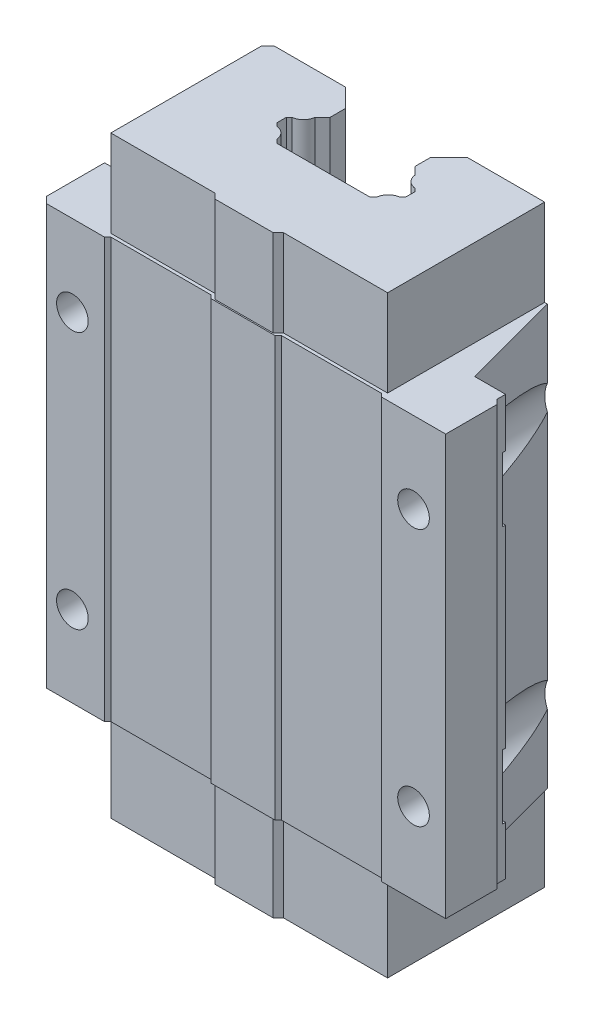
ISO-10303-21;
HEADER;
FILE_DESCRIPTION(('STEP AP214'),'2;1');
FILE_NAME('part.step','',(''),(''),'','','');
FILE_SCHEMA(('AUTOMOTIVE_DESIGN { 1 0 10303 214 1 1 1 1 }'));
ENDSEC;
DATA;
#1=APPLICATION_CONTEXT('core data for automotive mechanical design processes');
#2=APPLICATION_PROTOCOL_DEFINITION('international standard','automotive_design',2000,#1);
#3=PRODUCT_CONTEXT('',#1,'mechanical');
#4=PRODUCT('Part','Part','',(#3));
#5=PRODUCT_RELATED_PRODUCT_CATEGORY('part','',(#4));
#6=PRODUCT_DEFINITION_FORMATION('','',#4);
#7=PRODUCT_DEFINITION_CONTEXT('part definition',#1,'design');
#8=PRODUCT_DEFINITION('design','',#6,#7);
#9=PRODUCT_DEFINITION_SHAPE('','',#8);
#10=(LENGTH_UNIT() NAMED_UNIT(*) SI_UNIT(.MILLI.,.METRE.));
#11=(NAMED_UNIT(*) PLANE_ANGLE_UNIT() SI_UNIT($,.RADIAN.));
#12=(NAMED_UNIT(*) SI_UNIT($,.STERADIAN.) SOLID_ANGLE_UNIT());
#13=UNCERTAINTY_MEASURE_WITH_UNIT(LENGTH_MEASURE(1.E-05),#10,'distance_accuracy_value','');
#14=(GEOMETRIC_REPRESENTATION_CONTEXT(3) GLOBAL_UNCERTAINTY_ASSIGNED_CONTEXT((#13)) GLOBAL_UNIT_ASSIGNED_CONTEXT((#10,
#11,#12)) REPRESENTATION_CONTEXT('',''));
#15=CARTESIAN_POINT('',(0.,0.,0.));
#16=DIRECTION('',(0.,0.,1.));
#17=DIRECTION('',(1.,0.,0.));
#18=AXIS2_PLACEMENT_3D('',#15,#16,#17);
#19=CARTESIAN_POINT('',(-26.0192378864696,-232.918526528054,-10.));
#20=DIRECTION('',(-0.96592582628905,0.,-0.258819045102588));
#21=DIRECTION('',(-0.258819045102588,0.,0.96592582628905));
#22=AXIS2_PLACEMENT_3D('',#19,#20,#21);
#23=PLANE('',#22);
#24=DIRECTION('',(0.,1.,0.));
#25=VECTOR('',#24,1.);
#26=CARTESIAN_POINT('',(-26.0192378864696,-232.918526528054,-10.));
#27=LINE('',#26,#25);
#28=CARTESIAN_POINT('',(-26.0192378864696,-15.0231668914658,-10.));
#29=VERTEX_POINT('',#28);
#30=CARTESIAN_POINT('',(-26.0192378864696,15.0231668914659,-10.));
#31=VERTEX_POINT('',#30);
#32=EDGE_CURVE('E10',#29,#31,#27,.T.);
#33=ORIENTED_EDGE('',*,*,#32,.T.);
#34=CARTESIAN_POINT('',(-26.5,20.,-8.20577136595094));
#35=DIRECTION('',(0.96592582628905,0.,0.258819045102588));
#36=DIRECTION('',(-0.258819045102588,0.,0.96592582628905));
#37=AXIS2_PLACEMENT_3D('',#34,#35,#36);
#38=ELLIPSE('',#37,19.3185165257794,5.0000000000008);
#39=CARTESIAN_POINT('',(-22.4150635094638,17.1167216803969,-23.45096189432));
#40=VERTEX_POINT('',#39);
#41=EDGE_CURVE('E27',#31,#40,#38,.T.);
#42=ORIENTED_EDGE('',*,*,#41,.T.);
#43=DIRECTION('',(0.,1.,0.));
#44=VECTOR('',#43,1.);
#45=CARTESIAN_POINT('',(-22.4150635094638,-232.918526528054,-23.45096189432));
#46=LINE('',#45,#44);
#47=CARTESIAN_POINT('',(-22.4150635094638,-17.1167216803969,-23.45096189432));
#48=VERTEX_POINT('',#47);
#49=EDGE_CURVE('E940',#48,#40,#46,.T.);
#50=ORIENTED_EDGE('',*,*,#49,.F.);
#51=CARTESIAN_POINT('',(-26.5,-20.,-8.20577136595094));
#52=DIRECTION('',(-0.96592582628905,0.,-0.258819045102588));
#53=DIRECTION('',(-0.258819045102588,0.,0.96592582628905));
#54=AXIS2_PLACEMENT_3D('',#51,#52,#53);
#55=ELLIPSE('',#54,19.3185165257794,5.0000000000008);
#56=EDGE_CURVE('E955',#29,#48,#55,.T.);
#57=ORIENTED_EDGE('',*,*,#56,.F.);
#58=EDGE_LOOP('',(#33,#42,#50,#57));
#59=FACE_BOUND('',#58,.T.);
#60=ADVANCED_FACE('F16',(#59),#23,.T.);
#61=CARTESIAN_POINT('',(-31.4999999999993,-232.918526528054,-10.));
#62=DIRECTION('',(0.,0.,-1.));
#63=DIRECTION('',(0.,-1.,0.));
#64=AXIS2_PLACEMENT_3D('',#61,#62,#63);
#65=PLANE('',#64);
#66=CARTESIAN_POINT('',(-26.5,20.,-10.));
#67=DIRECTION('',(0.,0.,1.));
#68=DIRECTION('',(-1.,0.,0.));
#69=AXIS2_PLACEMENT_3D('',#66,#67,#68);
#70=CIRCLE('',#69,5.0000000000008);
#71=CARTESIAN_POINT('',(-26.0192378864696,24.9768331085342,-10.));
#72=VERTEX_POINT('',#71);
#73=CARTESIAN_POINT('',(-26.5,24.9999999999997,-10.));
#74=VERTEX_POINT('',#73);
#75=EDGE_CURVE('E751',#72,#74,#70,.T.);
#76=ORIENTED_EDGE('',*,*,#75,.T.);
#77=DIRECTION('',(-1.,0.,0.));
#78=VECTOR('',#77,1.);
#79=CARTESIAN_POINT('',(-31.4999999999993,24.9999999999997,-10.));
#80=LINE('',#79,#78);
#81=CARTESIAN_POINT('',(-31.4999999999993,24.9999999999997,-10.));
#82=VERTEX_POINT('',#81);
#83=EDGE_CURVE('E679',#74,#82,#80,.T.);
#84=ORIENTED_EDGE('',*,*,#83,.T.);
#85=DIRECTION('',(0.,1.,0.));
#86=VECTOR('',#85,1.);
#87=CARTESIAN_POINT('',(-31.4999999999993,-232.918526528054,-10.));
#88=LINE('',#87,#86);
#89=CARTESIAN_POINT('',(-31.4999999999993,32.6,-10.));
#90=VERTEX_POINT('',#89);
#91=EDGE_CURVE('E675',#82,#90,#88,.T.);
#92=ORIENTED_EDGE('',*,*,#91,.T.);
#93=DIRECTION('',(1.,0.,0.));
#94=VECTOR('',#93,1.);
#95=CARTESIAN_POINT('',(0.,32.6,-10.));
#96=LINE('',#95,#94);
#97=CARTESIAN_POINT('',(-26.0192378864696,32.6,-10.));
#98=VERTEX_POINT('',#97);
#99=EDGE_CURVE('E680',#90,#98,#96,.T.);
#100=ORIENTED_EDGE('',*,*,#99,.T.);
#101=DIRECTION('',(0.,1.,0.));
#102=VECTOR('',#101,1.);
#103=CARTESIAN_POINT('',(-26.0192378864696,-232.918526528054,-10.));
#104=LINE('',#103,#102);
#105=EDGE_CURVE('E717',#72,#98,#104,.T.);
#106=ORIENTED_EDGE('',*,*,#105,.F.);
#107=EDGE_LOOP('',(#76,#84,#92,#100,#106));
#108=FACE_BOUND('',#107,.T.);
#109=ADVANCED_FACE('F1897',(#108),#65,.T.);
#110=CARTESIAN_POINT('',(-31.4999999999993,-232.918526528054,-10.));
#111=DIRECTION('',(0.,0.,-1.));
#112=DIRECTION('',(0.,-1.,0.));
#113=AXIS2_PLACEMENT_3D('',#110,#111,#112);
#114=PLANE('',#113);
#115=DIRECTION('',(1.,0.,0.));
#116=VECTOR('',#115,1.);
#117=CARTESIAN_POINT('',(-31.4999999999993,14.9999999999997,-10.));
#118=LINE('',#117,#116);
#119=CARTESIAN_POINT('',(-31.4999999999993,14.9999999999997,-10.));
#120=VERTEX_POINT('',#119);
#121=CARTESIAN_POINT('',(-26.5,14.9999999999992,-10.));
#122=VERTEX_POINT('',#121);
#123=EDGE_CURVE('E810',#120,#122,#118,.T.);
#124=ORIENTED_EDGE('',*,*,#123,.T.);
#125=CARTESIAN_POINT('',(-26.5,20.,-10.));
#126=DIRECTION('',(0.,0.,1.));
#127=DIRECTION('',(-1.,0.,0.));
#128=AXIS2_PLACEMENT_3D('',#125,#126,#127);
#129=CIRCLE('',#128,5.0000000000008);
#130=EDGE_CURVE('E571',#122,#31,#129,.T.);
#131=ORIENTED_EDGE('',*,*,#130,.T.);
#132=ORIENTED_EDGE('',*,*,#32,.F.);
#133=CARTESIAN_POINT('',(-26.5,-20.,-10.));
#134=DIRECTION('',(0.,0.,-1.));
#135=DIRECTION('',(-1.,0.,0.));
#136=AXIS2_PLACEMENT_3D('',#133,#134,#135);
#137=CIRCLE('',#136,5.0000000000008);
#138=CARTESIAN_POINT('',(-26.5,-14.9999999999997,-10.));
#139=VERTEX_POINT('',#138);
#140=EDGE_CURVE('E959',#139,#29,#137,.T.);
#141=ORIENTED_EDGE('',*,*,#140,.F.);
#142=DIRECTION('',(1.,0.,0.));
#143=VECTOR('',#142,1.);
#144=CARTESIAN_POINT('',(-31.4999999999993,-14.9999999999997,-10.));
#145=LINE('',#144,#143);
#146=CARTESIAN_POINT('',(-31.4999999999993,-14.9999999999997,-10.));
#147=VERTEX_POINT('',#146);
#148=EDGE_CURVE('E846',#147,#139,#145,.T.);
#149=ORIENTED_EDGE('',*,*,#148,.F.);
#150=DIRECTION('',(0.,1.,0.));
#151=VECTOR('',#150,1.);
#152=CARTESIAN_POINT('',(-31.4999999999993,-232.918526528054,-10.));
#153=LINE('',#152,#151);
#154=EDGE_CURVE('E546',#147,#120,#153,.T.);
#155=ORIENTED_EDGE('',*,*,#154,.T.);
#156=EDGE_LOOP('',(#124,#131,#132,#141,#149,#155));
#157=FACE_BOUND('',#156,.T.);
#158=ADVANCED_FACE('F1904',(#157),#114,.T.);
#159=CARTESIAN_POINT('',(-31.4999999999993,-232.918526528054,-10.));
#160=DIRECTION('',(-1.,0.,0.));
#161=DIRECTION('',(0.,0.,1.));
#162=AXIS2_PLACEMENT_3D('',#159,#160,#161);
#163=PLANE('',#162);
#164=ORIENTED_EDGE('',*,*,#91,.F.);
#165=DIRECTION('',(0.,0.,1.));
#166=VECTOR('',#165,1.);
#167=CARTESIAN_POINT('',(-31.4999999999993,24.9999999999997,-10.));
#168=LINE('',#167,#166);
#169=CARTESIAN_POINT('',(-31.4999999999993,24.9999999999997,-9.5));
#170=VERTEX_POINT('',#169);
#171=EDGE_CURVE('E542',#82,#170,#168,.T.);
#172=ORIENTED_EDGE('',*,*,#171,.T.);
#173=DIRECTION('',(0.,-1.,0.));
#174=VECTOR('',#173,1.);
#175=CARTESIAN_POINT('',(-31.4999999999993,-232.918526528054,-9.5));
#176=LINE('',#175,#174);
#177=CARTESIAN_POINT('',(-31.4999999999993,14.9999999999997,-9.5));
#178=VERTEX_POINT('',#177);
#179=EDGE_CURVE('E547',#170,#178,#176,.T.);
#180=ORIENTED_EDGE('',*,*,#179,.T.);
#181=DIRECTION('',(0.,0.,-1.));
#182=VECTOR('',#181,1.);
#183=CARTESIAN_POINT('',(-31.4999999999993,14.9999999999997,-10.));
#184=LINE('',#183,#182);
#185=EDGE_CURVE('E1152',#178,#120,#184,.T.);
#186=ORIENTED_EDGE('',*,*,#185,.T.);
#187=ORIENTED_EDGE('',*,*,#154,.F.);
#188=DIRECTION('',(0.,0.,-1.));
#189=VECTOR('',#188,1.);
#190=CARTESIAN_POINT('',(-31.4999999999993,-14.9999999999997,-10.));
#191=LINE('',#190,#189);
#192=CARTESIAN_POINT('',(-31.4999999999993,-14.9999999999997,-9.5));
#193=VERTEX_POINT('',#192);
#194=EDGE_CURVE('E752',#193,#147,#191,.T.);
#195=ORIENTED_EDGE('',*,*,#194,.F.);
#196=DIRECTION('',(0.,1.,0.));
#197=VECTOR('',#196,1.);
#198=CARTESIAN_POINT('',(-31.4999999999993,-232.918526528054,-9.5));
#199=LINE('',#198,#197);
#200=CARTESIAN_POINT('',(-31.4999999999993,-24.9999999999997,-9.5));
#201=VERTEX_POINT('',#200);
#202=EDGE_CURVE('E855',#201,#193,#199,.T.);
#203=ORIENTED_EDGE('',*,*,#202,.F.);
#204=DIRECTION('',(0.,0.,1.));
#205=VECTOR('',#204,1.);
#206=CARTESIAN_POINT('',(-31.4999999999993,-24.9999999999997,-10.));
#207=LINE('',#206,#205);
#208=CARTESIAN_POINT('',(-31.4999999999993,-24.9999999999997,-10.));
#209=VERTEX_POINT('',#208);
#210=EDGE_CURVE('E1194',#209,#201,#207,.T.);
#211=ORIENTED_EDGE('',*,*,#210,.F.);
#212=DIRECTION('',(0.,1.,0.));
#213=VECTOR('',#212,1.);
#214=CARTESIAN_POINT('',(-31.4999999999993,-232.918526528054,-10.));
#215=LINE('',#214,#213);
#216=CARTESIAN_POINT('',(-31.4999999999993,-32.6,-10.));
#217=VERTEX_POINT('',#216);
#218=EDGE_CURVE('E967',#217,#209,#215,.T.);
#219=ORIENTED_EDGE('',*,*,#218,.F.);
#220=DIRECTION('',(0.,0.,1.));
#221=VECTOR('',#220,1.);
#222=CARTESIAN_POINT('',(-31.4999999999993,-32.6,0.));
#223=LINE('',#222,#221);
#224=CARTESIAN_POINT('',(-31.4999999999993,-32.6,-1.));
#225=VERTEX_POINT('',#224);
#226=EDGE_CURVE('E1047',#217,#225,#223,.T.);
#227=ORIENTED_EDGE('',*,*,#226,.T.);
#228=DIRECTION('',(0.,1.,0.));
#229=VECTOR('',#228,1.);
#230=CARTESIAN_POINT('',(-31.4999999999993,-232.918526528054,-1.));
#231=LINE('',#230,#229);
#232=CARTESIAN_POINT('',(-31.4999999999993,32.6,-1.));
#233=VERTEX_POINT('',#232);
#234=EDGE_CURVE('E1043',#225,#233,#231,.T.);
#235=ORIENTED_EDGE('',*,*,#234,.T.);
#236=DIRECTION('',(0.,0.,-1.));
#237=VECTOR('',#236,1.);
#238=CARTESIAN_POINT('',(-31.4999999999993,32.6,0.));
#239=LINE('',#238,#237);
#240=EDGE_CURVE('E716',#233,#90,#239,.T.);
#241=ORIENTED_EDGE('',*,*,#240,.T.);
#242=EDGE_LOOP('',(#164,#172,#180,#186,#187,#195,#203,#211,#219,#227,#235,#241));
#243=FACE_BOUND('',#242,.T.);
#244=ADVANCED_FACE('F1417',(#243),#163,.T.);
#245=CARTESIAN_POINT('',(-26.5,20.,0.));
#246=DIRECTION('',(0.,0.,-1.));
#247=DIRECTION('',(0.,-1.,0.));
#248=AXIS2_PLACEMENT_3D('',#245,#246,#247);
#249=CYLINDRICAL_SURFACE('',#248,2.4585);
#250=CARTESIAN_POINT('',(-26.5,20.,0.));
#251=DIRECTION('',(0.,0.,-1.));
#252=DIRECTION('',(0.,-1.,0.));
#253=AXIS2_PLACEMENT_3D('',#250,#251,#252);
#254=CIRCLE('',#253,2.4585);
#255=CARTESIAN_POINT('',(-26.5,17.5415,0.));
#256=VERTEX_POINT('',#255);
#257=EDGE_CURVE('E622',#256,#256,#254,.T.);
#258=ORIENTED_EDGE('',*,*,#257,.F.);
#259=EDGE_LOOP('',(#258));
#260=FACE_BOUND('',#259,.T.);
#261=CARTESIAN_POINT('',(-26.5,20.,-9.5));
#262=DIRECTION('',(0.,0.,1.));
#263=DIRECTION('',(-1.,0.,0.));
#264=AXIS2_PLACEMENT_3D('',#261,#262,#263);
#265=CIRCLE('',#264,2.4585);
#266=CARTESIAN_POINT('',(-28.9585,20.,-9.5));
#267=VERTEX_POINT('',#266);
#268=EDGE_CURVE('E480',#267,#267,#265,.T.);
#269=ORIENTED_EDGE('',*,*,#268,.F.);
#270=EDGE_LOOP('',(#269));
#271=FACE_BOUND('',#270,.T.);
#272=ADVANCED_FACE('F2143',(#260,#271),#249,.F.);
#273=CARTESIAN_POINT('',(-26.0192378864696,-232.918526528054,-10.));
#274=DIRECTION('',(-0.96592582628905,0.,-0.258819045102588));
#275=DIRECTION('',(-0.258819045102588,0.,0.96592582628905));
#276=AXIS2_PLACEMENT_3D('',#273,#274,#275);
#277=PLANE('',#276);
#278=DIRECTION('',(0.,1.,0.));
#279=VECTOR('',#278,1.);
#280=CARTESIAN_POINT('',(-22.4150635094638,-232.918526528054,-23.45096189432));
#281=LINE('',#280,#279);
#282=CARTESIAN_POINT('',(-22.4150635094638,22.8832783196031,-23.45096189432));
#283=VERTEX_POINT('',#282);
#284=CARTESIAN_POINT('',(-22.4150635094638,32.6,-23.45096189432));
#285=VERTEX_POINT('',#284);
#286=EDGE_CURVE('E510',#283,#285,#281,.T.);
#287=ORIENTED_EDGE('',*,*,#286,.F.);
#288=CARTESIAN_POINT('',(-26.5,20.,-8.20577136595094));
#289=DIRECTION('',(0.96592582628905,0.,0.258819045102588));
#290=DIRECTION('',(-0.258819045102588,0.,0.96592582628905));
#291=AXIS2_PLACEMENT_3D('',#288,#289,#290);
#292=ELLIPSE('',#291,19.3185165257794,5.0000000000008);
#293=EDGE_CURVE('E712',#283,#72,#292,.T.);
#294=ORIENTED_EDGE('',*,*,#293,.T.);
#295=ORIENTED_EDGE('',*,*,#105,.T.);
#296=DIRECTION('',(0.258819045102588,0.,-0.96592582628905));
#297=VECTOR('',#296,1.);
#298=CARTESIAN_POINT('',(-26.7762794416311,32.6,-7.17468245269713));
#299=LINE('',#298,#297);
#300=EDGE_CURVE('E504',#98,#285,#299,.T.);
#301=ORIENTED_EDGE('',*,*,#300,.T.);
#302=EDGE_LOOP('',(#287,#294,#295,#301));
#303=FACE_BOUND('',#302,.T.);
#304=ADVANCED_FACE('F2098',(#303),#277,.T.);
#305=CARTESIAN_POINT('',(21.8928203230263,-232.918526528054,-25.4));
#306=DIRECTION('',(0.965925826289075,0.,-0.258819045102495));
#307=DIRECTION('',(0.,-1.,0.));
#308=AXIS2_PLACEMENT_3D('',#305,#306,#307);
#309=PLANE('',#308);
#310=DIRECTION('',(0.,1.,0.));
#311=VECTOR('',#310,1.);
#312=CARTESIAN_POINT('',(26.0192378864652,-232.918526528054,-10.));
#313=LINE('',#312,#311);
#314=CARTESIAN_POINT('',(26.0192378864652,-15.0231668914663,-10.));
#315=VERTEX_POINT('',#314);
#316=CARTESIAN_POINT('',(26.0192378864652,15.0231668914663,-10.));
#317=VERTEX_POINT('',#316);
#318=EDGE_CURVE('E604',#315,#317,#313,.T.);
#319=ORIENTED_EDGE('',*,*,#318,.F.);
#320=CARTESIAN_POINT('',(26.5,-20.,-8.20577136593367));
#321=DIRECTION('',(-0.965925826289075,0.,0.258819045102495));
#322=DIRECTION('',(0.258819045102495,0.,0.965925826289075));
#323=AXIS2_PLACEMENT_3D('',#320,#321,#322);
#324=ELLIPSE('',#323,19.3185165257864,5.0000000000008);
#325=CARTESIAN_POINT('',(21.8928203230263,-18.0573483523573,-25.4));
#326=VERTEX_POINT('',#325);
#327=EDGE_CURVE('E500',#315,#326,#324,.T.);
#328=ORIENTED_EDGE('',*,*,#327,.T.);
#329=DIRECTION('',(0.,1.,0.));
#330=VECTOR('',#329,1.);
#331=CARTESIAN_POINT('',(21.8928203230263,-232.918526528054,-25.4));
#332=LINE('',#331,#330);
#333=CARTESIAN_POINT('',(21.8928203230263,18.0573483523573,-25.4));
#334=VERTEX_POINT('',#333);
#335=EDGE_CURVE('E505',#326,#334,#332,.T.);
#336=ORIENTED_EDGE('',*,*,#335,.T.);
#337=CARTESIAN_POINT('',(26.5,20.,-8.20577136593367));
#338=DIRECTION('',(0.965925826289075,0.,-0.258819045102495));
#339=DIRECTION('',(0.258819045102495,0.,0.965925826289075));
#340=AXIS2_PLACEMENT_3D('',#337,#338,#339);
#341=ELLIPSE('',#340,19.3185165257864,5.0000000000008);
#342=EDGE_CURVE('E932',#317,#334,#341,.T.);
#343=ORIENTED_EDGE('',*,*,#342,.F.);
#344=EDGE_LOOP('',(#319,#328,#336,#343));
#345=FACE_BOUND('',#344,.T.);
#346=ADVANCED_FACE('F1996',(#345),#309,.T.);
#347=CARTESIAN_POINT('',(30.8000000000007,-232.918526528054,-10.));
#348=DIRECTION('',(1.,0.,0.));
#349=DIRECTION('',(0.,1.,0.));
#350=AXIS2_PLACEMENT_3D('',#347,#348,#349);
#351=PLANE('',#350);
#352=DIRECTION('',(0.,1.,0.));
#353=VECTOR('',#352,1.);
#354=CARTESIAN_POINT('',(30.8000000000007,-232.918526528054,-9.5));
#355=LINE('',#354,#353);
#356=CARTESIAN_POINT('',(30.8000000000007,-24.9999999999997,-9.5));
#357=VERTEX_POINT('',#356);
#358=CARTESIAN_POINT('',(30.8000000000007,-14.9999999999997,-9.5));
#359=VERTEX_POINT('',#358);
#360=EDGE_CURVE('E939',#357,#359,#355,.T.);
#361=ORIENTED_EDGE('',*,*,#360,.T.);
#362=DIRECTION('',(0.,0.,-1.));
#363=VECTOR('',#362,1.);
#364=CARTESIAN_POINT('',(30.8000000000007,-14.9999999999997,-10.));
#365=LINE('',#364,#363);
#366=CARTESIAN_POINT('',(30.8000000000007,-14.9999999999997,-10.));
#367=VERTEX_POINT('',#366);
#368=EDGE_CURVE('E711',#359,#367,#365,.T.);
#369=ORIENTED_EDGE('',*,*,#368,.T.);
#370=DIRECTION('',(0.,1.,0.));
#371=VECTOR('',#370,1.);
#372=CARTESIAN_POINT('',(30.8000000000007,-232.918526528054,-10.));
#373=LINE('',#372,#371);
#374=CARTESIAN_POINT('',(30.8000000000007,14.9999999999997,-10.));
#375=VERTEX_POINT('',#374);
#376=EDGE_CURVE('E707',#367,#375,#373,.T.);
#377=ORIENTED_EDGE('',*,*,#376,.T.);
#378=DIRECTION('',(0.,0.,-1.));
#379=VECTOR('',#378,1.);
#380=CARTESIAN_POINT('',(30.8000000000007,14.9999999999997,-10.));
#381=LINE('',#380,#379);
#382=CARTESIAN_POINT('',(30.8000000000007,14.9999999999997,-9.5));
#383=VERTEX_POINT('',#382);
#384=EDGE_CURVE('E809',#383,#375,#381,.T.);
#385=ORIENTED_EDGE('',*,*,#384,.F.);
#386=DIRECTION('',(0.,-1.,0.));
#387=VECTOR('',#386,1.);
#388=CARTESIAN_POINT('',(30.8000000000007,-232.918526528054,-9.5));
#389=LINE('',#388,#387);
#390=CARTESIAN_POINT('',(30.8000000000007,24.9999999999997,-9.5));
#391=VERTEX_POINT('',#390);
#392=EDGE_CURVE('E747',#391,#383,#389,.T.);
#393=ORIENTED_EDGE('',*,*,#392,.F.);
#394=DIRECTION('',(0.,0.,1.));
#395=VECTOR('',#394,1.);
#396=CARTESIAN_POINT('',(30.8000000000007,24.9999999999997,-10.));
#397=LINE('',#396,#395);
#398=CARTESIAN_POINT('',(30.8000000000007,24.9999999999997,-10.));
#399=VERTEX_POINT('',#398);
#400=EDGE_CURVE('E1157',#399,#391,#397,.T.);
#401=ORIENTED_EDGE('',*,*,#400,.F.);
#402=DIRECTION('',(0.,1.,0.));
#403=VECTOR('',#402,1.);
#404=CARTESIAN_POINT('',(30.8000000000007,-232.918526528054,-10.));
#405=LINE('',#404,#403);
#406=CARTESIAN_POINT('',(30.8000000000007,32.6,-10.));
#407=VERTEX_POINT('',#406);
#408=EDGE_CURVE('E522',#399,#407,#405,.T.);
#409=ORIENTED_EDGE('',*,*,#408,.T.);
#410=DIRECTION('',(0.,0.,1.));
#411=VECTOR('',#410,1.);
#412=CARTESIAN_POINT('',(30.8000000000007,32.6,0.));
#413=LINE('',#412,#411);
#414=CARTESIAN_POINT('',(30.8000000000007,32.6,-8.7));
#415=VERTEX_POINT('',#414);
#416=EDGE_CURVE('E518',#407,#415,#413,.T.);
#417=ORIENTED_EDGE('',*,*,#416,.T.);
#418=DIRECTION('',(0.,1.,0.));
#419=VECTOR('',#418,1.);
#420=CARTESIAN_POINT('',(30.8000000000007,-232.918526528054,-8.7));
#421=LINE('',#420,#419);
#422=CARTESIAN_POINT('',(30.8000000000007,-32.6,-8.7));
#423=VERTEX_POINT('',#422);
#424=EDGE_CURVE('E574',#423,#415,#421,.T.);
#425=ORIENTED_EDGE('',*,*,#424,.F.);
#426=DIRECTION('',(0.,0.,-1.));
#427=VECTOR('',#426,1.);
#428=CARTESIAN_POINT('',(30.8000000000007,-32.6,0.));
#429=LINE('',#428,#427);
#430=CARTESIAN_POINT('',(30.8000000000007,-32.6,-10.));
#431=VERTEX_POINT('',#430);
#432=EDGE_CURVE('E523',#423,#431,#429,.T.);
#433=ORIENTED_EDGE('',*,*,#432,.T.);
#434=DIRECTION('',(0.,1.,0.));
#435=VECTOR('',#434,1.);
#436=CARTESIAN_POINT('',(30.8000000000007,-232.918526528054,-10.));
#437=LINE('',#436,#435);
#438=CARTESIAN_POINT('',(30.8000000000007,-24.9999999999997,-10.));
#439=VERTEX_POINT('',#438);
#440=EDGE_CURVE('E737',#431,#439,#437,.T.);
#441=ORIENTED_EDGE('',*,*,#440,.T.);
#442=DIRECTION('',(0.,0.,1.));
#443=VECTOR('',#442,1.);
#444=CARTESIAN_POINT('',(30.8000000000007,-24.9999999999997,-10.));
#445=LINE('',#444,#443);
#446=EDGE_CURVE('E1009',#439,#357,#445,.T.);
#447=ORIENTED_EDGE('',*,*,#446,.T.);
#448=EDGE_LOOP('',(#361,#369,#377,#385,#393,#401,#409,#417,#425,#433,#441,#447));
#449=FACE_BOUND('',#448,.T.);
#450=ADVANCED_FACE('F2024',(#449),#351,.T.);
#451=CARTESIAN_POINT('',(26.0192378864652,-232.918526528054,-10.));
#452=DIRECTION('',(0.,0.,-1.));
#453=DIRECTION('',(-1.,0.,0.));
#454=AXIS2_PLACEMENT_3D('',#451,#452,#453);
#455=PLANE('',#454);
#456=DIRECTION('',(-1.,0.,0.));
#457=VECTOR('',#456,1.);
#458=CARTESIAN_POINT('',(26.0192378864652,-14.9999999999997,-10.));
#459=LINE('',#458,#457);
#460=CARTESIAN_POINT('',(26.5,-14.9999999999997,-10.));
#461=VERTEX_POINT('',#460);
#462=EDGE_CURVE('E603',#367,#461,#459,.T.);
#463=ORIENTED_EDGE('',*,*,#462,.T.);
#464=CARTESIAN_POINT('',(26.5,-20.,-10.));
#465=DIRECTION('',(0.,0.,1.));
#466=DIRECTION('',(-1.,0.,0.));
#467=AXIS2_PLACEMENT_3D('',#464,#465,#466);
#468=CIRCLE('',#467,5.0000000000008);
#469=EDGE_CURVE('E599',#461,#315,#468,.T.);
#470=ORIENTED_EDGE('',*,*,#469,.T.);
#471=ORIENTED_EDGE('',*,*,#318,.T.);
#472=CARTESIAN_POINT('',(26.5,20.,-10.));
#473=DIRECTION('',(0.,0.,-1.));
#474=DIRECTION('',(-1.,0.,0.));
#475=AXIS2_PLACEMENT_3D('',#472,#473,#474);
#476=CIRCLE('',#475,5.0000000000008);
#477=CARTESIAN_POINT('',(26.5,14.9999999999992,-10.));
#478=VERTEX_POINT('',#477);
#479=EDGE_CURVE('E1135',#478,#317,#476,.T.);
#480=ORIENTED_EDGE('',*,*,#479,.F.);
#481=DIRECTION('',(-1.,0.,0.));
#482=VECTOR('',#481,1.);
#483=CARTESIAN_POINT('',(26.0192378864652,14.9999999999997,-10.));
#484=LINE('',#483,#482);
#485=EDGE_CURVE('E856',#375,#478,#484,.T.);
#486=ORIENTED_EDGE('',*,*,#485,.F.);
#487=ORIENTED_EDGE('',*,*,#376,.F.);
#488=EDGE_LOOP('',(#463,#470,#471,#480,#486,#487));
#489=FACE_BOUND('',#488,.T.);
#490=ADVANCED_FACE('F2186',(#489),#455,.T.);
#491=CARTESIAN_POINT('',(26.0192378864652,-232.918526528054,-10.));
#492=DIRECTION('',(0.,0.,-1.));
#493=DIRECTION('',(-1.,0.,0.));
#494=AXIS2_PLACEMENT_3D('',#491,#492,#493);
#495=PLANE('',#494);
#496=DIRECTION('',(0.,1.,0.));
#497=VECTOR('',#496,1.);
#498=CARTESIAN_POINT('',(26.0192378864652,-232.918526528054,-10.));
#499=LINE('',#498,#497);
#500=CARTESIAN_POINT('',(26.0192378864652,-32.6,-10.));
#501=VERTEX_POINT('',#500);
#502=CARTESIAN_POINT('',(26.0192378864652,-24.9768331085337,-10.));
#503=VERTEX_POINT('',#502);
#504=EDGE_CURVE('E914',#501,#503,#499,.T.);
#505=ORIENTED_EDGE('',*,*,#504,.T.);
#506=CARTESIAN_POINT('',(26.5,-20.,-10.));
#507=DIRECTION('',(0.,0.,1.));
#508=DIRECTION('',(-1.,0.,0.));
#509=AXIS2_PLACEMENT_3D('',#506,#507,#508);
#510=CIRCLE('',#509,5.0000000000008);
#511=CARTESIAN_POINT('',(26.5,-24.9999999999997,-10.));
#512=VERTEX_POINT('',#511);
#513=EDGE_CURVE('E910',#503,#512,#510,.T.);
#514=ORIENTED_EDGE('',*,*,#513,.T.);
#515=DIRECTION('',(1.,0.,0.));
#516=VECTOR('',#515,1.);
#517=CARTESIAN_POINT('',(26.0192378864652,-24.9999999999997,-10.));
#518=LINE('',#517,#516);
#519=EDGE_CURVE('E655',#512,#439,#518,.T.);
#520=ORIENTED_EDGE('',*,*,#519,.T.);
#521=ORIENTED_EDGE('',*,*,#440,.F.);
#522=DIRECTION('',(-1.,0.,0.));
#523=VECTOR('',#522,1.);
#524=CARTESIAN_POINT('',(0.,-32.6,-10.));
#525=LINE('',#524,#523);
#526=EDGE_CURVE('E651',#431,#501,#525,.T.);
#527=ORIENTED_EDGE('',*,*,#526,.T.);
#528=EDGE_LOOP('',(#505,#514,#520,#521,#527));
#529=FACE_BOUND('',#528,.T.);
#530=ADVANCED_FACE('F2196',(#529),#495,.T.);
#531=CARTESIAN_POINT('',(26.5,-20.,0.));
#532=DIRECTION('',(0.,0.,-1.));
#533=DIRECTION('',(0.,-1.,0.));
#534=AXIS2_PLACEMENT_3D('',#531,#532,#533);
#535=CYLINDRICAL_SURFACE('',#534,2.4585);
#536=CARTESIAN_POINT('',(26.5,-20.,0.));
#537=DIRECTION('',(0.,0.,-1.));
#538=DIRECTION('',(0.,-1.,0.));
#539=AXIS2_PLACEMENT_3D('',#536,#537,#538);
#540=CIRCLE('',#539,2.4585);
#541=CARTESIAN_POINT('',(26.5,-22.4585,0.));
#542=VERTEX_POINT('',#541);
#543=EDGE_CURVE('E667',#542,#542,#540,.T.);
#544=ORIENTED_EDGE('',*,*,#543,.F.);
#545=EDGE_LOOP('',(#544));
#546=FACE_BOUND('',#545,.T.);
#547=CARTESIAN_POINT('',(26.5,-20.,-9.5));
#548=DIRECTION('',(0.,0.,1.));
#549=DIRECTION('',(-1.,0.,0.));
#550=AXIS2_PLACEMENT_3D('',#547,#548,#549);
#551=CIRCLE('',#550,2.4585);
#552=CARTESIAN_POINT('',(24.0415,-20.,-9.5));
#553=VERTEX_POINT('',#552);
#554=EDGE_CURVE('E1014',#553,#553,#551,.T.);
#555=ORIENTED_EDGE('',*,*,#554,.F.);
#556=EDGE_LOOP('',(#555));
#557=FACE_BOUND('',#556,.T.);
#558=ADVANCED_FACE('F2207',(#546,#557),#535,.F.);
#559=CARTESIAN_POINT('',(26.0192378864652,-232.918526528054,-10.));
#560=DIRECTION('',(0.,0.,-1.));
#561=DIRECTION('',(-1.,0.,0.));
#562=AXIS2_PLACEMENT_3D('',#559,#560,#561);
#563=PLANE('',#562);
#564=DIRECTION('',(1.,0.,0.));
#565=VECTOR('',#564,1.);
#566=CARTESIAN_POINT('',(26.0192378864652,24.9999999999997,-10.));
#567=LINE('',#566,#565);
#568=CARTESIAN_POINT('',(26.5,24.9999999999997,-10.));
#569=VERTEX_POINT('',#568);
#570=EDGE_CURVE('E804',#569,#399,#567,.T.);
#571=ORIENTED_EDGE('',*,*,#570,.F.);
#572=CARTESIAN_POINT('',(26.5,20.,-10.));
#573=DIRECTION('',(0.,0.,-1.));
#574=DIRECTION('',(-1.,0.,0.));
#575=AXIS2_PLACEMENT_3D('',#572,#573,#574);
#576=CIRCLE('',#575,5.0000000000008);
#577=CARTESIAN_POINT('',(26.0192378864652,24.9768331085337,-10.));
#578=VERTEX_POINT('',#577);
#579=EDGE_CURVE('E478',#578,#569,#576,.T.);
#580=ORIENTED_EDGE('',*,*,#579,.F.);
#581=DIRECTION('',(0.,1.,0.));
#582=VECTOR('',#581,1.);
#583=CARTESIAN_POINT('',(26.0192378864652,-232.918526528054,-10.));
#584=LINE('',#583,#582);
#585=CARTESIAN_POINT('',(26.0192378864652,32.6,-10.));
#586=VERTEX_POINT('',#585);
#587=EDGE_CURVE('E656',#578,#586,#584,.T.);
#588=ORIENTED_EDGE('',*,*,#587,.T.);
#589=DIRECTION('',(1.,0.,0.));
#590=VECTOR('',#589,1.);
#591=CARTESIAN_POINT('',(0.,32.6,-10.));
#592=LINE('',#591,#590);
#593=EDGE_CURVE('E472',#586,#407,#592,.T.);
#594=ORIENTED_EDGE('',*,*,#593,.T.);
#595=ORIENTED_EDGE('',*,*,#408,.F.);
#596=EDGE_LOOP('',(#571,#580,#588,#594,#595));
#597=FACE_BOUND('',#596,.T.);
#598=ADVANCED_FACE('F2028',(#597),#563,.T.);
#599=CARTESIAN_POINT('',(21.8928203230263,-232.918526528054,-25.4));
#600=DIRECTION('',(0.965925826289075,0.,-0.258819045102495));
#601=DIRECTION('',(0.,-1.,0.));
#602=AXIS2_PLACEMENT_3D('',#599,#600,#601);
#603=PLANE('',#602);
#604=DIRECTION('',(0.,1.,0.));
#605=VECTOR('',#604,1.);
#606=CARTESIAN_POINT('',(21.8928203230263,-232.918526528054,-25.4));
#607=LINE('',#606,#605);
#608=CARTESIAN_POINT('',(21.8928203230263,-32.6,-25.4));
#609=VERTEX_POINT('',#608);
#610=CARTESIAN_POINT('',(21.8928203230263,-21.9426516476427,-25.4));
#611=VERTEX_POINT('',#610);
#612=EDGE_CURVE('E468',#609,#611,#607,.T.);
#613=ORIENTED_EDGE('',*,*,#612,.T.);
#614=CARTESIAN_POINT('',(26.5,-20.,-8.20577136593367));
#615=DIRECTION('',(-0.965925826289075,0.,0.258819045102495));
#616=DIRECTION('',(0.258819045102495,0.,0.965925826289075));
#617=AXIS2_PLACEMENT_3D('',#614,#615,#616);
#618=ELLIPSE('',#617,19.3185165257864,5.0000000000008);
#619=EDGE_CURVE('E473',#611,#503,#618,.T.);
#620=ORIENTED_EDGE('',*,*,#619,.T.);
#621=ORIENTED_EDGE('',*,*,#504,.F.);
#622=DIRECTION('',(-0.258819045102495,0.,-0.965925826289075));
#623=VECTOR('',#622,1.);
#624=CARTESIAN_POINT('',(26.7762794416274,-32.6,-7.17468245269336));
#625=LINE('',#624,#623);
#626=EDGE_CURVE('E486',#501,#609,#625,.T.);
#627=ORIENTED_EDGE('',*,*,#626,.T.);
#628=EDGE_LOOP('',(#613,#620,#621,#627));
#629=FACE_BOUND('',#628,.T.);
#630=ADVANCED_FACE('F2003',(#629),#603,.T.);
#631=CARTESIAN_POINT('',(0.,32.6,0.));
#632=DIRECTION('',(0.,1.,0.));
#633=DIRECTION('',(1.,0.,0.));
#634=AXIS2_PLACEMENT_3D('',#631,#632,#633);
#635=PLANE('',#634);
#636=DIRECTION('',(-1.,0.,0.));
#637=VECTOR('',#636,1.);
#638=CARTESIAN_POINT('',(-5.32954477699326,32.6,-1.00026584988));
#639=LINE('',#638,#637);
#640=CARTESIAN_POINT('',(-5.32954477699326,32.6,-1.00026584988));
#641=VERTEX_POINT('',#640);
#642=CARTESIAN_POINT('',(-21.5295447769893,32.6,-1.00026584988));
#643=VERTEX_POINT('',#642);
#644=EDGE_CURVE('E490',#641,#643,#639,.T.);
#645=ORIENTED_EDGE('',*,*,#644,.T.);
#646=DIRECTION('',(0.,0.,-1.));
#647=VECTOR('',#646,1.);
#648=CARTESIAN_POINT('',(-21.5295447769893,32.6,-1.00026584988));
#649=LINE('',#648,#647);
#650=CARTESIAN_POINT('',(-21.5295447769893,32.6,-24.3364806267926));
#651=VERTEX_POINT('',#650);
#652=EDGE_CURVE('E608',#643,#651,#649,.T.);
#653=ORIENTED_EDGE('',*,*,#652,.T.);
#654=DIRECTION('',(0.707106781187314,0.,-0.707106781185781));
#655=VECTOR('',#654,1.);
#656=CARTESIAN_POINT('',(-22.9330127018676,32.6,-22.9330127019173));
#657=LINE('',#656,#655);
#658=EDGE_CURVE('E506',#285,#651,#657,.T.);
#659=ORIENTED_EDGE('',*,*,#658,.F.);
#660=ORIENTED_EDGE('',*,*,#300,.F.);
#661=ORIENTED_EDGE('',*,*,#99,.F.);
#662=ORIENTED_EDGE('',*,*,#240,.F.);
#663=DIRECTION('',(-0.707106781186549,0.,-0.707106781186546));
#664=VECTOR('',#663,1.);
#665=CARTESIAN_POINT('',(-15.2499999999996,32.6,15.2499999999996));
#666=LINE('',#665,#664);
#667=CARTESIAN_POINT('',(-30.4999999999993,32.6,0.));
#668=VERTEX_POINT('',#667);
#669=EDGE_CURVE('E771',#668,#233,#666,.T.);
#670=ORIENTED_EDGE('',*,*,#669,.F.);
#671=DIRECTION('',(1.,0.,0.));
#672=VECTOR('',#671,1.);
#673=CARTESIAN_POINT('',(-100.,32.6,0.));
#674=LINE('',#673,#672);
#675=CARTESIAN_POINT('',(-21.4999999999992,32.6,0.));
#676=VERTEX_POINT('',#675);
#677=EDGE_CURVE('E827',#668,#676,#674,.T.);
#678=ORIENTED_EDGE('',*,*,#677,.T.);
#679=DIRECTION('',(-0.707106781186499,0.,0.707106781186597));
#680=VECTOR('',#679,1.);
#681=CARTESIAN_POINT('',(-10.7500000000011,32.6,-10.7499999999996));
#682=LINE('',#681,#680);
#683=CARTESIAN_POINT('',(-20.9999999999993,32.6,-0.5));
#684=VERTEX_POINT('',#683);
#685=EDGE_CURVE('E640',#684,#676,#682,.T.);
#686=ORIENTED_EDGE('',*,*,#685,.F.);
#687=DIRECTION('',(-1.,0.,0.));
#688=VECTOR('',#687,1.);
#689=CARTESIAN_POINT('',(0.,32.6,-0.5));
#690=LINE('',#689,#688);
#691=CARTESIAN_POINT('',(-5.49999999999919,32.6,-0.5));
#692=VERTEX_POINT('',#691);
#693=EDGE_CURVE('E909',#692,#684,#690,.T.);
#694=ORIENTED_EDGE('',*,*,#693,.F.);
#695=DIRECTION('',(-0.7071067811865,0.,-0.707106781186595));
#696=VECTOR('',#695,1.);
#697=CARTESIAN_POINT('',(-2.49999999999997,32.6,2.49999999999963));
#698=LINE('',#697,#696);
#699=CARTESIAN_POINT('',(-4.99999999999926,32.6,0.));
#700=VERTEX_POINT('',#699);
#701=EDGE_CURVE('E1031',#700,#692,#698,.T.);
#702=ORIENTED_EDGE('',*,*,#701,.F.);
#703=DIRECTION('',(1.,0.,0.));
#704=VECTOR('',#703,1.);
#705=CARTESIAN_POINT('',(-100.,32.6,0.));
#706=LINE('',#705,#704);
#707=CARTESIAN_POINT('',(4.99999999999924,32.6,0.));
#708=VERTEX_POINT('',#707);
#709=EDGE_CURVE('E701',#700,#708,#706,.T.);
#710=ORIENTED_EDGE('',*,*,#709,.T.);
#711=DIRECTION('',(-0.707106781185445,0.,0.70710678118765));
#712=VECTOR('',#711,1.);
#713=CARTESIAN_POINT('',(2.50000000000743,32.6,2.49999999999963));
#714=LINE('',#713,#712);
#715=CARTESIAN_POINT('',(5.4999999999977,32.6,-0.5));
#716=VERTEX_POINT('',#715);
#717=EDGE_CURVE('E538',#716,#708,#714,.T.);
#718=ORIENTED_EDGE('',*,*,#717,.F.);
#719=DIRECTION('',(-1.,0.,0.));
#720=VECTOR('',#719,1.);
#721=CARTESIAN_POINT('',(0.,32.6,-0.5));
#722=LINE('',#721,#720);
#723=CARTESIAN_POINT('',(21.0000000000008,32.6,-0.5));
#724=VERTEX_POINT('',#723);
#725=EDGE_CURVE('E814',#724,#716,#722,.T.);
#726=ORIENTED_EDGE('',*,*,#725,.F.);
#727=DIRECTION('',(-0.707106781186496,0.,-0.707106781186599));
#728=VECTOR('',#727,1.);
#729=CARTESIAN_POINT('',(10.7500000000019,32.6,-10.7500000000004));
#730=LINE('',#729,#728);
#731=CARTESIAN_POINT('',(21.5000000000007,32.6,0.));
#732=VERTEX_POINT('',#731);
#733=EDGE_CURVE('E1182',#732,#724,#730,.T.);
#734=ORIENTED_EDGE('',*,*,#733,.F.);
#735=DIRECTION('',(1.,0.,0.));
#736=VECTOR('',#735,1.);
#737=CARTESIAN_POINT('',(-100.,32.6,0.));
#738=LINE('',#737,#736);
#739=CARTESIAN_POINT('',(31.5000000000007,32.6,0.));
#740=VERTEX_POINT('',#739);
#741=EDGE_CURVE('E697',#732,#740,#738,.T.);
#742=ORIENTED_EDGE('',*,*,#741,.T.);
#743=DIRECTION('',(0.,0.,1.));
#744=VECTOR('',#743,1.);
#745=CARTESIAN_POINT('',(31.5000000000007,32.6,0.));
#746=LINE('',#745,#744);
#747=CARTESIAN_POINT('',(31.5000000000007,32.6,-8.00000000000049));
#748=VERTEX_POINT('',#747);
#749=EDGE_CURVE('E628',#748,#740,#746,.T.);
#750=ORIENTED_EDGE('',*,*,#749,.F.);
#751=DIRECTION('',(0.707106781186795,0.,0.7071067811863));
#752=VECTOR('',#751,1.);
#753=CARTESIAN_POINT('',(19.7499999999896,32.6,-19.7500000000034));
#754=LINE('',#753,#752);
#755=EDGE_CURVE('E561',#415,#748,#754,.T.);
#756=ORIENTED_EDGE('',*,*,#755,.F.);
#757=ORIENTED_EDGE('',*,*,#416,.F.);
#758=ORIENTED_EDGE('',*,*,#593,.F.);
#759=DIRECTION('',(0.258819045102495,0.,0.965925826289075));
#760=VECTOR('',#759,1.);
#761=CARTESIAN_POINT('',(26.7762794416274,32.6,-7.17468245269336));
#762=LINE('',#761,#760);
#763=CARTESIAN_POINT('',(21.8928203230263,32.6,-25.4));
#764=VERTEX_POINT('',#763);
#765=EDGE_CURVE('E562',#764,#586,#762,.T.);
#766=ORIENTED_EDGE('',*,*,#765,.F.);
#767=DIRECTION('',(1.,0.,1.56866787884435E-11));
#768=VECTOR('',#767,1.);
#769=CARTESIAN_POINT('',(3.98441641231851E-10,32.6,-25.4000000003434));
#770=LINE('',#769,#768);
#771=CARTESIAN_POINT('',(21.4704552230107,32.6,-25.4000000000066));
#772=VERTEX_POINT('',#771);
#773=EDGE_CURVE('E615',#772,#764,#770,.T.);
#774=ORIENTED_EDGE('',*,*,#773,.F.);
#775=DIRECTION('',(0.,0.,1.));
#776=VECTOR('',#775,1.);
#777=CARTESIAN_POINT('',(21.4704552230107,32.6,-25.4));
#778=LINE('',#777,#776);
#779=CARTESIAN_POINT('',(21.4704552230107,32.6,-1.00026584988));
#780=VERTEX_POINT('',#779);
#781=EDGE_CURVE('E702',#772,#780,#778,.T.);
#782=ORIENTED_EDGE('',*,*,#781,.T.);
#783=DIRECTION('',(-1.,0.,0.));
#784=VECTOR('',#783,1.);
#785=CARTESIAN_POINT('',(21.4704552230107,32.6,-1.00026584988));
#786=LINE('',#785,#784);
#787=CARTESIAN_POINT('',(5.27045522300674,32.6,-1.00026584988));
#788=VERTEX_POINT('',#787);
#789=EDGE_CURVE('E944',#780,#788,#786,.T.);
#790=ORIENTED_EDGE('',*,*,#789,.T.);
#791=DIRECTION('',(-0.707106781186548,0.,0.707106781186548));
#792=VECTOR('',#791,1.);
#793=CARTESIAN_POINT('',(5.27045522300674,32.6,-1.00026584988));
#794=LINE('',#793,#792);
#795=CARTESIAN_POINT('',(4.47045522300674,32.6,-0.20026584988));
#796=VERTEX_POINT('',#795);
#797=EDGE_CURVE('E579',#788,#796,#794,.T.);
#798=ORIENTED_EDGE('',*,*,#797,.T.);
#799=DIRECTION('',(-1.,0.,0.));
#800=VECTOR('',#799,1.);
#801=CARTESIAN_POINT('',(4.47045522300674,32.6,-0.20026584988));
#802=LINE('',#801,#800);
#803=CARTESIAN_POINT('',(-4.52954477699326,32.6,-0.20026584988));
#804=VERTEX_POINT('',#803);
#805=EDGE_CURVE('E575',#796,#804,#802,.T.);
#806=ORIENTED_EDGE('',*,*,#805,.T.);
#807=DIRECTION('',(-0.707106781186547,0.,-0.707106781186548));
#808=VECTOR('',#807,1.);
#809=CARTESIAN_POINT('',(-4.52954477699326,32.6,-0.20026584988));
#810=LINE('',#809,#808);
#811=EDGE_CURVE('E580',#804,#641,#810,.T.);
#812=ORIENTED_EDGE('',*,*,#811,.T.);
#813=EDGE_LOOP('',(#645,#653,#659,#660,#661,#662,#670,#678,#686,#694,#702,#710,#718,#726,#734,
#742,#750,#756,#757,#758,#766,#774,#782,#790,#798,#806,#812));
#814=FACE_BOUND('',#813,.T.);
#815=ADVANCED_FACE('F1768',(#814),#635,.T.);
#816=CARTESIAN_POINT('',(-100.,-32.6,0.));
#817=DIRECTION('',(0.,0.,1.));
#818=DIRECTION('',(1.,0.,0.));
#819=AXIS2_PLACEMENT_3D('',#816,#817,#818);
#820=PLANE('',#819);
#821=ORIENTED_EDGE('',*,*,#257,.T.);
#822=EDGE_LOOP('',(#821));
#823=FACE_BOUND('',#822,.T.);
#824=CARTESIAN_POINT('',(-26.5,-20.,0.));
#825=DIRECTION('',(0.,0.,-1.));
#826=DIRECTION('',(0.,-1.,0.));
#827=AXIS2_PLACEMENT_3D('',#824,#825,#826);
#828=CIRCLE('',#827,2.4585);
#829=CARTESIAN_POINT('',(-26.5,-22.4585,0.));
#830=VERTEX_POINT('',#829);
#831=EDGE_CURVE('E722',#830,#830,#828,.T.);
#832=ORIENTED_EDGE('',*,*,#831,.T.);
#833=EDGE_LOOP('',(#832));
#834=FACE_BOUND('',#833,.T.);
#835=DIRECTION('',(0.,1.,0.));
#836=VECTOR('',#835,1.);
#837=CARTESIAN_POINT('',(-21.4999999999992,-232.918526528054,0.));
#838=LINE('',#837,#836);
#839=CARTESIAN_POINT('',(-21.4999999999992,-32.6,0.));
#840=VERTEX_POINT('',#839);
#841=EDGE_CURVE('E718',#840,#676,#838,.T.);
#842=ORIENTED_EDGE('',*,*,#841,.T.);
#843=ORIENTED_EDGE('',*,*,#677,.F.);
#844=DIRECTION('',(0.,1.,0.));
#845=VECTOR('',#844,1.);
#846=CARTESIAN_POINT('',(-30.4999999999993,-232.918526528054,0.));
#847=LINE('',#846,#845);
#848=CARTESIAN_POINT('',(-30.4999999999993,-32.6,0.));
#849=VERTEX_POINT('',#848);
#850=EDGE_CURVE('E728',#849,#668,#847,.T.);
#851=ORIENTED_EDGE('',*,*,#850,.F.);
#852=DIRECTION('',(1.,0.,0.));
#853=VECTOR('',#852,1.);
#854=CARTESIAN_POINT('',(-100.,-32.6,0.));
#855=LINE('',#854,#853);
#856=EDGE_CURVE('E613',#849,#840,#855,.T.);
#857=ORIENTED_EDGE('',*,*,#856,.T.);
#858=EDGE_LOOP('',(#842,#843,#851,#857));
#859=FACE_BOUND('',#858,.T.);
#860=ADVANCED_FACE('F1913',(#823,#834,#859),#820,.T.);
#861=CARTESIAN_POINT('',(-100.,-32.6,0.));
#862=DIRECTION('',(0.,0.,1.));
#863=DIRECTION('',(1.,0.,0.));
#864=AXIS2_PLACEMENT_3D('',#861,#862,#863);
#865=PLANE('',#864);
#866=DIRECTION('',(0.,1.,0.));
#867=VECTOR('',#866,1.);
#868=CARTESIAN_POINT('',(4.99999999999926,-232.918526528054,0.));
#869=LINE('',#868,#867);
#870=CARTESIAN_POINT('',(4.99999999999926,-32.6,0.));
#871=VERTEX_POINT('',#870);
#872=EDGE_CURVE('E609',#871,#708,#869,.T.);
#873=ORIENTED_EDGE('',*,*,#872,.T.);
#874=ORIENTED_EDGE('',*,*,#709,.F.);
#875=DIRECTION('',(0.,1.,0.));
#876=VECTOR('',#875,1.);
#877=CARTESIAN_POINT('',(-4.99999999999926,-232.918526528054,0.));
#878=LINE('',#877,#876);
#879=CARTESIAN_POINT('',(-4.99999999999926,-32.6,0.));
#880=VERTEX_POINT('',#879);
#881=EDGE_CURVE('E1084',#880,#700,#878,.T.);
#882=ORIENTED_EDGE('',*,*,#881,.F.);
#883=DIRECTION('',(1.,0.,0.));
#884=VECTOR('',#883,1.);
#885=CARTESIAN_POINT('',(-100.,-32.6,0.));
#886=LINE('',#885,#884);
#887=EDGE_CURVE('E614',#880,#871,#886,.T.);
#888=ORIENTED_EDGE('',*,*,#887,.T.);
#889=EDGE_LOOP('',(#873,#874,#882,#888));
#890=FACE_BOUND('',#889,.T.);
#891=ADVANCED_FACE('F1774',(#890),#865,.T.);
#892=CARTESIAN_POINT('',(-100.,-32.6,0.));
#893=DIRECTION('',(0.,0.,1.));
#894=DIRECTION('',(1.,0.,0.));
#895=AXIS2_PLACEMENT_3D('',#892,#893,#894);
#896=PLANE('',#895);
#897=CARTESIAN_POINT('',(26.5,20.,0.));
#898=DIRECTION('',(0.,0.,-1.));
#899=DIRECTION('',(0.,-1.,0.));
#900=AXIS2_PLACEMENT_3D('',#897,#898,#899);
#901=CIRCLE('',#900,2.4585);
#902=CARTESIAN_POINT('',(26.5,17.5415,0.));
#903=VERTEX_POINT('',#902);
#904=EDGE_CURVE('E980',#903,#903,#901,.T.);
#905=ORIENTED_EDGE('',*,*,#904,.T.);
#906=EDGE_LOOP('',(#905));
#907=FACE_BOUND('',#906,.T.);
#908=ORIENTED_EDGE('',*,*,#543,.T.);
#909=EDGE_LOOP('',(#908));
#910=FACE_BOUND('',#909,.T.);
#911=DIRECTION('',(0.,1.,0.));
#912=VECTOR('',#911,1.);
#913=CARTESIAN_POINT('',(31.5000000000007,-232.918526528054,0.));
#914=LINE('',#913,#912);
#915=CARTESIAN_POINT('',(31.5000000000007,-32.6,0.));
#916=VERTEX_POINT('',#915);
#917=EDGE_CURVE('E663',#916,#740,#914,.T.);
#918=ORIENTED_EDGE('',*,*,#917,.T.);
#919=ORIENTED_EDGE('',*,*,#741,.F.);
#920=DIRECTION('',(0.,1.,0.));
#921=VECTOR('',#920,1.);
#922=CARTESIAN_POINT('',(21.5000000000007,-232.918526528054,0.));
#923=LINE('',#922,#921);
#924=CARTESIAN_POINT('',(21.5000000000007,-32.6,0.));
#925=VERTEX_POINT('',#924);
#926=EDGE_CURVE('E831',#925,#732,#923,.T.);
#927=ORIENTED_EDGE('',*,*,#926,.F.);
#928=DIRECTION('',(1.,0.,0.));
#929=VECTOR('',#928,1.);
#930=CARTESIAN_POINT('',(-100.,-32.6,0.));
#931=LINE('',#930,#929);
#932=EDGE_CURVE('E668',#925,#916,#931,.T.);
#933=ORIENTED_EDGE('',*,*,#932,.T.);
#934=EDGE_LOOP('',(#918,#919,#927,#933));
#935=FACE_BOUND('',#934,.T.);
#936=ADVANCED_FACE('F1875',(#907,#910,#935),#896,.T.);
#937=CARTESIAN_POINT('',(0.,-32.6,0.));
#938=DIRECTION('',(0.,1.,0.));
#939=DIRECTION('',(1.,0.,0.));
#940=AXIS2_PLACEMENT_3D('',#937,#938,#939);
#941=PLANE('',#940);
#942=DIRECTION('',(-0.707106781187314,0.,0.707106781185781));
#943=VECTOR('',#942,1.);
#944=CARTESIAN_POINT('',(-22.9330127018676,-32.6,-22.9330127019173));
#945=LINE('',#944,#943);
#946=CARTESIAN_POINT('',(-21.5295447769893,-32.6,-24.3364806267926));
#947=VERTEX_POINT('',#946);
#948=CARTESIAN_POINT('',(-22.4150635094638,-32.6,-23.45096189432));
#949=VERTEX_POINT('',#948);
#950=EDGE_CURVE('E556',#947,#949,#945,.T.);
#951=ORIENTED_EDGE('',*,*,#950,.F.);
#952=DIRECTION('',(0.,0.,1.));
#953=VECTOR('',#952,1.);
#954=CARTESIAN_POINT('',(-21.5295447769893,-32.6,-24.4));
#955=LINE('',#954,#953);
#956=CARTESIAN_POINT('',(-21.5295447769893,-32.6,-1.00026584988));
#957=VERTEX_POINT('',#956);
#958=EDGE_CURVE('E778',#947,#957,#955,.T.);
#959=ORIENTED_EDGE('',*,*,#958,.T.);
#960=DIRECTION('',(1.,0.,0.));
#961=VECTOR('',#960,1.);
#962=CARTESIAN_POINT('',(-21.5295447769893,-32.6,-1.00026584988));
#963=LINE('',#962,#961);
#964=CARTESIAN_POINT('',(-5.32954477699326,-32.6,-1.00026584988));
#965=VERTEX_POINT('',#964);
#966=EDGE_CURVE('E786',#957,#965,#963,.T.);
#967=ORIENTED_EDGE('',*,*,#966,.T.);
#968=DIRECTION('',(0.707106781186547,0.,0.707106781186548));
#969=VECTOR('',#968,1.);
#970=CARTESIAN_POINT('',(-4.52954477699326,-32.6,-0.20026584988));
#971=LINE('',#970,#969);
#972=CARTESIAN_POINT('',(-4.52954477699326,-32.6,-0.20026584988));
#973=VERTEX_POINT('',#972);
#974=EDGE_CURVE('E585',#965,#973,#971,.T.);
#975=ORIENTED_EDGE('',*,*,#974,.T.);
#976=DIRECTION('',(1.,0.,0.));
#977=VECTOR('',#976,1.);
#978=CARTESIAN_POINT('',(4.47045522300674,-32.6,-0.20026584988));
#979=LINE('',#978,#977);
#980=CARTESIAN_POINT('',(4.47045522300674,-32.6,-0.20026584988));
#981=VERTEX_POINT('',#980);
#982=EDGE_CURVE('E581',#973,#981,#979,.T.);
#983=ORIENTED_EDGE('',*,*,#982,.T.);
#984=DIRECTION('',(0.707106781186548,0.,-0.707106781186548));
#985=VECTOR('',#984,1.);
#986=CARTESIAN_POINT('',(5.27045522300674,-32.6,-1.00026584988));
#987=LINE('',#986,#985);
#988=CARTESIAN_POINT('',(5.27045522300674,-32.6,-1.00026584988));
#989=VERTEX_POINT('',#988);
#990=EDGE_CURVE('E586',#981,#989,#987,.T.);
#991=ORIENTED_EDGE('',*,*,#990,.T.);
#992=DIRECTION('',(1.,0.,0.));
#993=VECTOR('',#992,1.);
#994=CARTESIAN_POINT('',(5.27045522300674,-32.6,-1.00026584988));
#995=LINE('',#994,#993);
#996=CARTESIAN_POINT('',(21.4704552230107,-32.6,-1.00026584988));
#997=VERTEX_POINT('',#996);
#998=EDGE_CURVE('E1051',#989,#997,#995,.T.);
#999=ORIENTED_EDGE('',*,*,#998,.T.);
#1000=DIRECTION('',(0.,0.,-1.));
#1001=VECTOR('',#1000,1.);
#1002=CARTESIAN_POINT('',(21.4704552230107,-32.6,-25.4));
#1003=LINE('',#1002,#1001);
#1004=CARTESIAN_POINT('',(21.4704552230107,-32.6,-25.4));
#1005=VERTEX_POINT('',#1004);
#1006=EDGE_CURVE('E727',#997,#1005,#1003,.T.);
#1007=ORIENTED_EDGE('',*,*,#1006,.T.);
#1008=DIRECTION('',(-1.,0.,-1.56866787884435E-11));
#1009=VECTOR('',#1008,1.);
#1010=CARTESIAN_POINT('',(3.98441641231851E-10,-32.6,-25.4000000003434));
#1011=LINE('',#1010,#1009);
#1012=EDGE_CURVE('E1209',#609,#1005,#1011,.T.);
#1013=ORIENTED_EDGE('',*,*,#1012,.F.);
#1014=ORIENTED_EDGE('',*,*,#626,.F.);
#1015=ORIENTED_EDGE('',*,*,#526,.F.);
#1016=ORIENTED_EDGE('',*,*,#432,.F.);
#1017=DIRECTION('',(-0.707106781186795,0.,-0.7071067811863));
#1018=VECTOR('',#1017,1.);
#1019=CARTESIAN_POINT('',(19.7499999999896,-32.6,-19.7500000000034));
#1020=LINE('',#1019,#1018);
#1021=CARTESIAN_POINT('',(31.5000000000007,-32.6,-8.00000000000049));
#1022=VERTEX_POINT('',#1021);
#1023=EDGE_CURVE('E897',#1022,#423,#1020,.T.);
#1024=ORIENTED_EDGE('',*,*,#1023,.F.);
#1025=DIRECTION('',(0.,0.,-1.));
#1026=VECTOR('',#1025,1.);
#1027=CARTESIAN_POINT('',(31.5000000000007,-32.6,0.));
#1028=LINE('',#1027,#1026);
#1029=EDGE_CURVE('E627',#916,#1022,#1028,.T.);
#1030=ORIENTED_EDGE('',*,*,#1029,.F.);
#1031=ORIENTED_EDGE('',*,*,#932,.F.);
#1032=DIRECTION('',(0.707106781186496,0.,0.707106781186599));
#1033=VECTOR('',#1032,1.);
#1034=CARTESIAN_POINT('',(10.7500000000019,-32.6,-10.7500000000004));
#1035=LINE('',#1034,#1033);
#1036=CARTESIAN_POINT('',(21.0000000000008,-32.6,-0.5));
#1037=VERTEX_POINT('',#1036);
#1038=EDGE_CURVE('E819',#1037,#925,#1035,.T.);
#1039=ORIENTED_EDGE('',*,*,#1038,.F.);
#1040=DIRECTION('',(1.,0.,0.));
#1041=VECTOR('',#1040,1.);
#1042=CARTESIAN_POINT('',(0.,-32.6,-0.5));
#1043=LINE('',#1042,#1041);
#1044=CARTESIAN_POINT('',(5.4999999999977,-32.6,-0.5));
#1045=VERTEX_POINT('',#1044);
#1046=EDGE_CURVE('E429',#1045,#1037,#1043,.T.);
#1047=ORIENTED_EDGE('',*,*,#1046,.F.);
#1048=DIRECTION('',(0.707106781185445,0.,-0.70710678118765));
#1049=VECTOR('',#1048,1.);
#1050=CARTESIAN_POINT('',(2.50000000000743,-32.6,2.49999999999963));
#1051=LINE('',#1050,#1049);
#1052=EDGE_CURVE('E537',#871,#1045,#1051,.T.);
#1053=ORIENTED_EDGE('',*,*,#1052,.F.);
#1054=ORIENTED_EDGE('',*,*,#887,.F.);
#1055=DIRECTION('',(0.7071067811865,0.,0.707106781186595));
#1056=VECTOR('',#1055,1.);
#1057=CARTESIAN_POINT('',(-2.49999999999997,-32.6,2.49999999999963));
#1058=LINE('',#1057,#1056);
#1059=CARTESIAN_POINT('',(-5.49999999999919,-32.6,-0.5));
#1060=VERTEX_POINT('',#1059);
#1061=EDGE_CURVE('E674',#1060,#880,#1058,.T.);
#1062=ORIENTED_EDGE('',*,*,#1061,.F.);
#1063=DIRECTION('',(1.,0.,0.));
#1064=VECTOR('',#1063,1.);
#1065=CARTESIAN_POINT('',(0.,-32.6,-0.5));
#1066=LINE('',#1065,#1064);
#1067=CARTESIAN_POINT('',(-20.9999999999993,-32.6,-0.5));
#1068=VERTEX_POINT('',#1067);
#1069=EDGE_CURVE('E908',#1068,#1060,#1066,.T.);
#1070=ORIENTED_EDGE('',*,*,#1069,.F.);
#1071=DIRECTION('',(0.707106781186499,0.,-0.707106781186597));
#1072=VECTOR('',#1071,1.);
#1073=CARTESIAN_POINT('',(-10.7500000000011,-32.6,-10.7499999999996));
#1074=LINE('',#1073,#1072);
#1075=EDGE_CURVE('E639',#840,#1068,#1074,.T.);
#1076=ORIENTED_EDGE('',*,*,#1075,.F.);
#1077=ORIENTED_EDGE('',*,*,#856,.F.);
#1078=DIRECTION('',(0.707106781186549,0.,0.707106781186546));
#1079=VECTOR('',#1078,1.);
#1080=CARTESIAN_POINT('',(-15.2499999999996,-32.6,15.2499999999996));
#1081=LINE('',#1080,#1079);
#1082=EDGE_CURVE('E723',#225,#849,#1081,.T.);
#1083=ORIENTED_EDGE('',*,*,#1082,.F.);
#1084=ORIENTED_EDGE('',*,*,#226,.F.);
#1085=DIRECTION('',(-1.,0.,0.));
#1086=VECTOR('',#1085,1.);
#1087=CARTESIAN_POINT('',(0.,-32.6,-10.));
#1088=LINE('',#1087,#1086);
#1089=CARTESIAN_POINT('',(-26.0192378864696,-32.6,-10.));
#1090=VERTEX_POINT('',#1089);
#1091=EDGE_CURVE('E803',#1090,#217,#1088,.T.);
#1092=ORIENTED_EDGE('',*,*,#1091,.F.);
#1093=DIRECTION('',(-0.258819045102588,0.,0.96592582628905));
#1094=VECTOR('',#1093,1.);
#1095=CARTESIAN_POINT('',(-26.7762794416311,-32.6,-7.17468245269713));
#1096=LINE('',#1095,#1094);
#1097=EDGE_CURVE('E587',#949,#1090,#1096,.T.);
#1098=ORIENTED_EDGE('',*,*,#1097,.F.);
#1099=EDGE_LOOP('',(#951,#959,#967,#975,#983,#991,#999,#1007,#1013,#1014,#1015,#1016,#1024,
#1030,#1031,#1039,#1047,#1053,#1054,#1062,#1070,#1076,#1077,#1083,#1084,#1092,#1098));
#1100=FACE_BOUND('',#1099,.T.);
#1101=ADVANCED_FACE('F1779',(#1100),#941,.F.);
#1102=CARTESIAN_POINT('',(-30.4999999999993,-232.918526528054,0.));
#1103=DIRECTION('',(-0.707106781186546,0.,0.707106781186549));
#1104=DIRECTION('',(0.,1.,0.));
#1105=AXIS2_PLACEMENT_3D('',#1102,#1103,#1104);
#1106=PLANE('',#1105);
#1107=ORIENTED_EDGE('',*,*,#1082,.T.);
#1108=ORIENTED_EDGE('',*,*,#850,.T.);
#1109=ORIENTED_EDGE('',*,*,#669,.T.);
#1110=ORIENTED_EDGE('',*,*,#234,.F.);
#1111=EDGE_LOOP('',(#1107,#1108,#1109,#1110));
#1112=FACE_BOUND('',#1111,.T.);
#1113=ADVANCED_FACE('F1938',(#1112),#1106,.T.);
#1114=CARTESIAN_POINT('',(31.5000000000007,-232.918526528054,0.));
#1115=DIRECTION('',(1.,0.,0.));
#1116=DIRECTION('',(0.,1.,0.));
#1117=AXIS2_PLACEMENT_3D('',#1114,#1115,#1116);
#1118=PLANE('',#1117);
#1119=ORIENTED_EDGE('',*,*,#1029,.T.);
#1120=DIRECTION('',(0.,1.,0.));
#1121=VECTOR('',#1120,1.);
#1122=CARTESIAN_POINT('',(31.5000000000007,-232.918526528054,-8.00000000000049));
#1123=LINE('',#1122,#1121);
#1124=EDGE_CURVE('E623',#1022,#748,#1123,.T.);
#1125=ORIENTED_EDGE('',*,*,#1124,.T.);
#1126=ORIENTED_EDGE('',*,*,#749,.T.);
#1127=ORIENTED_EDGE('',*,*,#917,.F.);
#1128=EDGE_LOOP('',(#1119,#1125,#1126,#1127));
#1129=FACE_BOUND('',#1128,.T.);
#1130=ADVANCED_FACE('F2015',(#1129),#1118,.T.);
#1131=CARTESIAN_POINT('',(-9.99999999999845,-232.918526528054,-15.2692793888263));
#1132=DIRECTION('',(1.,0.,0.));
#1133=DIRECTION('',(0.,1.,0.));
#1134=AXIS2_PLACEMENT_3D('',#1131,#1132,#1133);
#1135=PLANE('',#1134);
#1136=DIRECTION('',(0.,1.,0.));
#1137=VECTOR('',#1136,1.);
#1138=CARTESIAN_POINT('',(-9.99999999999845,-232.918526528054,-15.2692793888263));
#1139=LINE('',#1138,#1137);
#1140=CARTESIAN_POINT('',(-9.99999999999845,-46.1,-15.2692793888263));
#1141=VERTEX_POINT('',#1140);
#1142=CARTESIAN_POINT('',(-9.99999999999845,46.1,-15.2692793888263));
#1143=VERTEX_POINT('',#1142);
#1144=EDGE_CURVE('E673',#1141,#1143,#1139,.T.);
#1145=ORIENTED_EDGE('',*,*,#1144,.F.);
#1146=DIRECTION('',(0.,0.,-1.));
#1147=VECTOR('',#1146,1.);
#1148=CARTESIAN_POINT('',(-9.99999999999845,-46.1,-16.7407206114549));
#1149=LINE('',#1148,#1147);
#1150=CARTESIAN_POINT('',(-9.99999999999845,-46.1,-16.7407206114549));
#1151=VERTEX_POINT('',#1150);
#1152=EDGE_CURVE('E541',#1141,#1151,#1149,.T.);
#1153=ORIENTED_EDGE('',*,*,#1152,.T.);
#1154=DIRECTION('',(0.,1.,0.));
#1155=VECTOR('',#1154,1.);
#1156=CARTESIAN_POINT('',(-9.99999999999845,-232.918526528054,-16.7407206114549));
#1157=LINE('',#1156,#1155);
#1158=CARTESIAN_POINT('',(-9.99999999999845,46.1,-16.7407206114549));
#1159=VERTEX_POINT('',#1158);
#1160=EDGE_CURVE('E356',#1151,#1159,#1157,.T.);
#1161=ORIENTED_EDGE('',*,*,#1160,.T.);
#1162=DIRECTION('',(0.,0.,1.));
#1163=VECTOR('',#1162,1.);
#1164=CARTESIAN_POINT('',(-9.99999999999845,46.1,-16.7407206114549));
#1165=LINE('',#1164,#1163);
#1166=EDGE_CURVE('E370',#1159,#1143,#1165,.T.);
#1167=ORIENTED_EDGE('',*,*,#1166,.T.);
#1168=EDGE_LOOP('',(#1145,#1153,#1161,#1167));
#1169=FACE_BOUND('',#1168,.T.);
#1170=ADVANCED_FACE('F1831',(#1169),#1135,.T.);
#1171=CARTESIAN_POINT('',(-9.99999999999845,-232.918526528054,-16.7407206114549));
#1172=DIRECTION('',(0.707106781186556,0.,0.707106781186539));
#1173=DIRECTION('',(0.,-1.,0.));
#1174=AXIS2_PLACEMENT_3D('',#1171,#1172,#1173);
#1175=PLANE('',#1174);
#1176=ORIENTED_EDGE('',*,*,#1160,.F.);
#1177=DIRECTION('',(0.707106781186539,0.,-0.707106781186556));
#1178=VECTOR('',#1177,1.);
#1179=CARTESIAN_POINT('',(-9.55863275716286,-46.1,-17.1820878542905));
#1180=LINE('',#1179,#1178);
#1181=CARTESIAN_POINT('',(-9.55863275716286,-46.1,-17.1820878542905));
#1182=VERTEX_POINT('',#1181);
#1183=EDGE_CURVE('E878',#1151,#1182,#1180,.T.);
#1184=ORIENTED_EDGE('',*,*,#1183,.T.);
#1185=DIRECTION('',(0.,1.,0.));
#1186=VECTOR('',#1185,1.);
#1187=CARTESIAN_POINT('',(-9.55863275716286,-232.918526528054,-17.1820878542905));
#1188=LINE('',#1187,#1186);
#1189=CARTESIAN_POINT('',(-9.55863275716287,46.1,-17.1820878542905));
#1190=VERTEX_POINT('',#1189);
#1191=EDGE_CURVE('E881',#1182,#1190,#1188,.T.);
#1192=ORIENTED_EDGE('',*,*,#1191,.T.);
#1193=DIRECTION('',(-0.707106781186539,0.,0.707106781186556));
#1194=VECTOR('',#1193,1.);
#1195=CARTESIAN_POINT('',(-9.55863275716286,46.1,-17.1820878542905));
#1196=LINE('',#1195,#1194);
#1197=EDGE_CURVE('E1113',#1190,#1159,#1196,.T.);
#1198=ORIENTED_EDGE('',*,*,#1197,.T.);
#1199=EDGE_LOOP('',(#1176,#1184,#1192,#1198));
#1200=FACE_BOUND('',#1199,.T.);
#1201=ADVANCED_FACE('F1833',(#1200),#1175,.T.);
#1202=CARTESIAN_POINT('',(-9.78003455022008,-232.918526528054,-19.1999781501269));
#1203=DIRECTION('',(0.,1.,0.));
#1204=DIRECTION('',(0.,0.,1.));
#1205=AXIS2_PLACEMENT_3D('',#1202,#1203,#1204);
#1206=CYLINDRICAL_SURFACE('',#1205,2.03);
#1207=ORIENTED_EDGE('',*,*,#1191,.F.);
#1208=CARTESIAN_POINT('',(-9.78003455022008,-46.1,-19.1999781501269));
#1209=DIRECTION('',(0.,1.,0.));
#1210=DIRECTION('',(1.,0.,0.));
#1211=AXIS2_PLACEMENT_3D('',#1208,#1209,#1210);
#1212=CIRCLE('',#1211,2.03);
#1213=CARTESIAN_POINT('',(-7.7621442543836,-46.1,-18.9785763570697));
#1214=VERTEX_POINT('',#1213);
#1215=EDGE_CURVE('E551',#1182,#1214,#1212,.T.);
#1216=ORIENTED_EDGE('',*,*,#1215,.T.);
#1217=DIRECTION('',(0.,1.,0.));
#1218=VECTOR('',#1217,1.);
#1219=CARTESIAN_POINT('',(-7.7621442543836,-232.918526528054,-18.9785763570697));
#1220=LINE('',#1219,#1218);
#1221=CARTESIAN_POINT('',(-7.7621442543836,46.1,-18.9785763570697));
#1222=VERTEX_POINT('',#1221);
#1223=EDGE_CURVE('E444',#1214,#1222,#1220,.T.);
#1224=ORIENTED_EDGE('',*,*,#1223,.T.);
#1225=CARTESIAN_POINT('',(-9.78003455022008,46.1,-19.1999781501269));
#1226=DIRECTION('',(0.,-1.,0.));
#1227=DIRECTION('',(1.,0.,0.));
#1228=AXIS2_PLACEMENT_3D('',#1225,#1226,#1227);
#1229=CIRCLE('',#1228,2.03);
#1230=EDGE_CURVE('E440',#1222,#1190,#1229,.T.);
#1231=ORIENTED_EDGE('',*,*,#1230,.T.);
#1232=EDGE_LOOP('',(#1207,#1216,#1224,#1231));
#1233=FACE_BOUND('',#1232,.T.);
#1234=ADVANCED_FACE('F1835',(#1233),#1206,.T.);
#1235=CARTESIAN_POINT('',(-7.7621442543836,-232.918526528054,-18.9785763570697));
#1236=DIRECTION('',(0.707106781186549,0.,0.707106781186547));
#1237=DIRECTION('',(0.,-1.,0.));
#1238=AXIS2_PLACEMENT_3D('',#1235,#1236,#1237);
#1239=PLANE('',#1238);
#1240=ORIENTED_EDGE('',*,*,#1223,.F.);
#1241=DIRECTION('',(0.707106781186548,0.,-0.707106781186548));
#1242=VECTOR('',#1241,1.);
#1243=CARTESIAN_POINT('',(-6.60000000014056,-46.1,-20.1407206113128));
#1244=LINE('',#1243,#1242);
#1245=CARTESIAN_POINT('',(-6.60000000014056,-46.1,-20.1407206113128));
#1246=VERTEX_POINT('',#1245);
#1247=EDGE_CURVE('E445',#1214,#1246,#1244,.T.);
#1248=ORIENTED_EDGE('',*,*,#1247,.T.);
#1249=DIRECTION('',(0.,1.,0.));
#1250=VECTOR('',#1249,1.);
#1251=CARTESIAN_POINT('',(-6.60000000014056,-232.918526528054,-20.1407206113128));
#1252=LINE('',#1251,#1250);
#1253=CARTESIAN_POINT('',(-6.60000000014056,46.1,-20.1407206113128));
#1254=VERTEX_POINT('',#1253);
#1255=EDGE_CURVE('E874',#1246,#1254,#1252,.T.);
#1256=ORIENTED_EDGE('',*,*,#1255,.T.);
#1257=DIRECTION('',(-0.707106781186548,0.,0.707106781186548));
#1258=VECTOR('',#1257,1.);
#1259=CARTESIAN_POINT('',(-6.60000000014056,46.1,-20.1407206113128));
#1260=LINE('',#1259,#1258);
#1261=EDGE_CURVE('E661',#1254,#1222,#1260,.T.);
#1262=ORIENTED_EDGE('',*,*,#1261,.T.);
#1263=EDGE_LOOP('',(#1240,#1248,#1256,#1262));
#1264=FACE_BOUND('',#1263,.T.);
#1265=ADVANCED_FACE('F1839',(#1264),#1239,.T.);
#1266=CARTESIAN_POINT('',(-6.60000000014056,-232.918526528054,-20.1407206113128));
#1267=DIRECTION('',(1.,0.,0.));
#1268=DIRECTION('',(0.,0.,-1.));
#1269=AXIS2_PLACEMENT_3D('',#1266,#1267,#1268);
#1270=PLANE('',#1269);
#1271=ORIENTED_EDGE('',*,*,#1255,.F.);
#1272=DIRECTION('',(0.,0.,-1.));
#1273=VECTOR('',#1272,1.);
#1274=CARTESIAN_POINT('',(-6.60000000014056,-46.1,-22.5292793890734));
#1275=LINE('',#1274,#1273);
#1276=CARTESIAN_POINT('',(-6.60000000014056,-46.1,-22.5292793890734));
#1277=VERTEX_POINT('',#1276);
#1278=EDGE_CURVE('E657',#1246,#1277,#1275,.T.);
#1279=ORIENTED_EDGE('',*,*,#1278,.T.);
#1280=DIRECTION('',(0.,1.,0.));
#1281=VECTOR('',#1280,1.);
#1282=CARTESIAN_POINT('',(-6.60000000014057,-232.918526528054,-22.5292793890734));
#1283=LINE('',#1282,#1281);
#1284=CARTESIAN_POINT('',(-6.60000000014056,46.1,-22.5292793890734));
#1285=VERTEX_POINT('',#1284);
#1286=EDGE_CURVE('E662',#1277,#1285,#1283,.T.);
#1287=ORIENTED_EDGE('',*,*,#1286,.T.);
#1288=DIRECTION('',(0.,0.,1.));
#1289=VECTOR('',#1288,1.);
#1290=CARTESIAN_POINT('',(-6.60000000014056,46.1,-22.5292793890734));
#1291=LINE('',#1290,#1289);
#1292=EDGE_CURVE('E850',#1285,#1254,#1291,.T.);
#1293=ORIENTED_EDGE('',*,*,#1292,.T.);
#1294=EDGE_LOOP('',(#1271,#1279,#1287,#1293));
#1295=FACE_BOUND('',#1294,.T.);
#1296=ADVANCED_FACE('F1842',(#1295),#1270,.T.);
#1297=CARTESIAN_POINT('',(-6.60000000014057,-232.918526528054,-22.5292793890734));
#1298=DIRECTION('',(0.707106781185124,0.,-0.707106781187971));
#1299=DIRECTION('',(0.,-1.,0.));
#1300=AXIS2_PLACEMENT_3D('',#1297,#1298,#1299);
#1301=PLANE('',#1300);
#1302=ORIENTED_EDGE('',*,*,#1286,.F.);
#1303=DIRECTION('',(-0.707106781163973,0.,-0.707106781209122));
#1304=VECTOR('',#1303,1.);
#1305=CARTESIAN_POINT('',(-9.47072061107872,-46.1,-25.4000000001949));
#1306=LINE('',#1305,#1304);
#1307=CARTESIAN_POINT('',(-9.47072061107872,-46.1,-25.4000000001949));
#1308=VERTEX_POINT('',#1307);
#1309=EDGE_CURVE('E645',#1277,#1308,#1306,.T.);
#1310=ORIENTED_EDGE('',*,*,#1309,.T.);
#1311=DIRECTION('',(0.,1.,0.));
#1312=VECTOR('',#1311,1.);
#1313=CARTESIAN_POINT('',(-9.47072061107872,-232.918526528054,-25.4));
#1314=LINE('',#1313,#1312);
#1315=CARTESIAN_POINT('',(-9.47072061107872,46.1,-25.4000000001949));
#1316=VERTEX_POINT('',#1315);
#1317=EDGE_CURVE('E641',#1308,#1316,#1314,.T.);
#1318=ORIENTED_EDGE('',*,*,#1317,.T.);
#1319=DIRECTION('',(0.707106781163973,0.,0.707106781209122));
#1320=VECTOR('',#1319,1.);
#1321=CARTESIAN_POINT('',(-9.47072061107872,46.1,-25.4000000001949));
#1322=LINE('',#1321,#1320);
#1323=EDGE_CURVE('E646',#1316,#1285,#1322,.T.);
#1324=ORIENTED_EDGE('',*,*,#1323,.T.);
#1325=EDGE_LOOP('',(#1302,#1310,#1318,#1324));
#1326=FACE_BOUND('',#1325,.T.);
#1327=ADVANCED_FACE('F1847',(#1326),#1301,.T.);
#1328=CARTESIAN_POINT('',(-20.4660254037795,-232.918526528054,-25.4));
#1329=DIRECTION('',(0.,0.,-1.));
#1330=DIRECTION('',(0.,-1.,0.));
#1331=AXIS2_PLACEMENT_3D('',#1328,#1329,#1330);
#1332=PLANE('',#1331);
#1333=ORIENTED_EDGE('',*,*,#1317,.F.);
#1334=DIRECTION('',(-1.,0.,1.76202958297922E-11));
#1335=VECTOR('',#1334,1.);
#1336=CARTESIAN_POINT('',(-20.5295447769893,-46.1,-25.4));
#1337=LINE('',#1336,#1335);
#1338=CARTESIAN_POINT('',(-20.5295447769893,-46.1,-25.4));
#1339=VERTEX_POINT('',#1338);
#1340=EDGE_CURVE('E741',#1308,#1339,#1337,.T.);
#1341=ORIENTED_EDGE('',*,*,#1340,.T.);
#1342=DIRECTION('',(0.,1.,0.));
#1343=VECTOR('',#1342,1.);
#1344=CARTESIAN_POINT('',(-20.5295447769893,-46.1,-25.4));
#1345=LINE('',#1344,#1343);
#1346=CARTESIAN_POINT('',(-20.5295447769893,-32.6,-25.4));
#1347=VERTEX_POINT('',#1346);
#1348=EDGE_CURVE('E685',#1339,#1347,#1345,.T.);
#1349=ORIENTED_EDGE('',*,*,#1348,.T.);
#1350=DIRECTION('',(-1.,0.,1.76202958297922E-11));
#1351=VECTOR('',#1350,1.);
#1352=CARTESIAN_POINT('',(-20.5295447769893,-32.6,-25.4));
#1353=LINE('',#1352,#1351);
#1354=CARTESIAN_POINT('',(-20.4660254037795,-32.6,-25.4000000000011));
#1355=VERTEX_POINT('',#1354);
#1356=EDGE_CURVE('E1022',#1355,#1347,#1353,.T.);
#1357=ORIENTED_EDGE('',*,*,#1356,.F.);
#1358=DIRECTION('',(0.,1.,0.));
#1359=VECTOR('',#1358,1.);
#1360=CARTESIAN_POINT('',(-20.4660254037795,-232.918526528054,-25.4));
#1361=LINE('',#1360,#1359);
#1362=CARTESIAN_POINT('',(-20.4660254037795,32.6,-25.4));
#1363=VERTEX_POINT('',#1362);
#1364=EDGE_CURVE('E681',#1355,#1363,#1361,.T.);
#1365=ORIENTED_EDGE('',*,*,#1364,.T.);
#1366=DIRECTION('',(1.,0.,-1.76202958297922E-11));
#1367=VECTOR('',#1366,1.);
#1368=CARTESIAN_POINT('',(-20.5295447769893,32.6,-25.4));
#1369=LINE('',#1368,#1367);
#1370=CARTESIAN_POINT('',(-20.5295447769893,32.6,-25.4));
#1371=VERTEX_POINT('',#1370);
#1372=EDGE_CURVE('E1387',#1371,#1363,#1369,.T.);
#1373=ORIENTED_EDGE('',*,*,#1372,.F.);
#1374=DIRECTION('',(0.,-1.,0.));
#1375=VECTOR('',#1374,1.);
#1376=CARTESIAN_POINT('',(-20.5295447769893,46.1,-25.4));
#1377=LINE('',#1376,#1375);
#1378=CARTESIAN_POINT('',(-20.5295447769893,46.1,-25.4));
#1379=VERTEX_POINT('',#1378);
#1380=EDGE_CURVE('E799',#1379,#1371,#1377,.T.);
#1381=ORIENTED_EDGE('',*,*,#1380,.F.);
#1382=DIRECTION('',(1.,0.,-1.76202958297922E-11));
#1383=VECTOR('',#1382,1.);
#1384=CARTESIAN_POINT('',(-20.5295447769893,46.1,-25.4));
#1385=LINE('',#1384,#1383);
#1386=EDGE_CURVE('E686',#1379,#1316,#1385,.T.);
#1387=ORIENTED_EDGE('',*,*,#1386,.T.);
#1388=EDGE_LOOP('',(#1333,#1341,#1349,#1357,#1365,#1373,#1381,#1387));
#1389=FACE_BOUND('',#1388,.T.);
#1390=ADVANCED_FACE('F1355',(#1389),#1332,.T.);
#1391=CARTESIAN_POINT('',(-22.4150635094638,-232.918526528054,-23.45096189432));
#1392=DIRECTION('',(-0.707106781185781,0.,-0.707106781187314));
#1393=DIRECTION('',(-0.707106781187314,0.,0.707106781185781));
#1394=AXIS2_PLACEMENT_3D('',#1391,#1392,#1393);
#1395=PLANE('',#1394);
#1396=ORIENTED_EDGE('',*,*,#49,.T.);
#1397=CARTESIAN_POINT('',(-26.5,20.,-19.3660254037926));
#1398=DIRECTION('',(0.707106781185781,0.,0.707106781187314));
#1399=DIRECTION('',(-0.707106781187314,0.,0.707106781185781));
#1400=AXIS2_PLACEMENT_3D('',#1397,#1398,#1399);
#1401=ELLIPSE('',#1400,7.07106781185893,5.0000000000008);
#1402=EDGE_CURVE('E943',#40,#283,#1401,.T.);
#1403=ORIENTED_EDGE('',*,*,#1402,.T.);
#1404=ORIENTED_EDGE('',*,*,#286,.T.);
#1405=ORIENTED_EDGE('',*,*,#658,.T.);
#1406=DIRECTION('',(0.707106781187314,0.,-0.707106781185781));
#1407=VECTOR('',#1406,1.);
#1408=CARTESIAN_POINT('',(-22.9330127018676,32.6,-22.9330127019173));
#1409=LINE('',#1408,#1407);
#1410=EDGE_CURVE('E511',#651,#1363,#1409,.T.);
#1411=ORIENTED_EDGE('',*,*,#1410,.T.);
#1412=ORIENTED_EDGE('',*,*,#1364,.F.);
#1413=DIRECTION('',(-0.707106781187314,0.,0.707106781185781));
#1414=VECTOR('',#1413,1.);
#1415=CARTESIAN_POINT('',(-22.9330127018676,-32.6,-22.9330127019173));
#1416=LINE('',#1415,#1414);
#1417=EDGE_CURVE('E552',#1355,#947,#1416,.T.);
#1418=ORIENTED_EDGE('',*,*,#1417,.T.);
#1419=ORIENTED_EDGE('',*,*,#950,.T.);
#1420=DIRECTION('',(0.,1.,0.));
#1421=VECTOR('',#1420,1.);
#1422=CARTESIAN_POINT('',(-22.4150635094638,-232.918526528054,-23.45096189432));
#1423=LINE('',#1422,#1421);
#1424=CARTESIAN_POINT('',(-22.4150635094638,-22.8832783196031,-23.45096189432));
#1425=VERTEX_POINT('',#1424);
#1426=EDGE_CURVE('E591',#949,#1425,#1423,.T.);
#1427=ORIENTED_EDGE('',*,*,#1426,.T.);
#1428=CARTESIAN_POINT('',(-26.5,-20.,-19.3660254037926));
#1429=DIRECTION('',(-0.707106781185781,0.,-0.707106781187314));
#1430=DIRECTION('',(-0.707106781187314,0.,0.707106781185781));
#1431=AXIS2_PLACEMENT_3D('',#1428,#1429,#1430);
#1432=ELLIPSE('',#1431,7.07106781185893,5.0000000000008);
#1433=EDGE_CURVE('E960',#48,#1425,#1432,.T.);
#1434=ORIENTED_EDGE('',*,*,#1433,.F.);
#1435=EDGE_LOOP('',(#1396,#1403,#1404,#1405,#1411,#1412,#1418,#1419,#1427,#1434));
#1436=FACE_BOUND('',#1435,.T.);
#1437=ADVANCED_FACE('F1949',(#1436),#1395,.T.);
#1438=CARTESIAN_POINT('',(-26.0192378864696,-232.918526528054,-10.));
#1439=DIRECTION('',(-0.96592582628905,0.,-0.258819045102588));
#1440=DIRECTION('',(-0.258819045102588,0.,0.96592582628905));
#1441=AXIS2_PLACEMENT_3D('',#1438,#1439,#1440);
#1442=PLANE('',#1441);
#1443=CARTESIAN_POINT('',(-26.5,-20.,-8.20577136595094));
#1444=DIRECTION('',(-0.96592582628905,0.,-0.258819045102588));
#1445=DIRECTION('',(-0.258819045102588,0.,0.96592582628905));
#1446=AXIS2_PLACEMENT_3D('',#1443,#1444,#1445);
#1447=ELLIPSE('',#1446,19.3185165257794,5.0000000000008);
#1448=CARTESIAN_POINT('',(-26.0192378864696,-24.9768331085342,-10.));
#1449=VERTEX_POINT('',#1448);
#1450=EDGE_CURVE('E984',#1425,#1449,#1447,.T.);
#1451=ORIENTED_EDGE('',*,*,#1450,.F.);
#1452=ORIENTED_EDGE('',*,*,#1426,.F.);
#1453=ORIENTED_EDGE('',*,*,#1097,.T.);
#1454=DIRECTION('',(0.,1.,0.));
#1455=VECTOR('',#1454,1.);
#1456=CARTESIAN_POINT('',(-26.0192378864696,-232.918526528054,-10.));
#1457=LINE('',#1456,#1455);
#1458=EDGE_CURVE('E592',#1090,#1449,#1457,.T.);
#1459=ORIENTED_EDGE('',*,*,#1458,.T.);
#1460=EDGE_LOOP('',(#1451,#1452,#1453,#1459));
#1461=FACE_BOUND('',#1460,.T.);
#1462=ADVANCED_FACE('F1946',(#1461),#1442,.T.);
#1463=CARTESIAN_POINT('',(-31.4999999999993,-232.918526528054,-10.));
#1464=DIRECTION('',(0.,0.,-1.));
#1465=DIRECTION('',(0.,-1.,0.));
#1466=AXIS2_PLACEMENT_3D('',#1463,#1464,#1465);
#1467=PLANE('',#1466);
#1468=CARTESIAN_POINT('',(-26.5,-20.,-10.));
#1469=DIRECTION('',(0.,0.,-1.));
#1470=DIRECTION('',(-1.,0.,0.));
#1471=AXIS2_PLACEMENT_3D('',#1468,#1469,#1470);
#1472=CIRCLE('',#1471,5.0000000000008);
#1473=CARTESIAN_POINT('',(-26.5,-24.9999999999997,-10.));
#1474=VERTEX_POINT('',#1473);
#1475=EDGE_CURVE('E886',#1449,#1474,#1472,.T.);
#1476=ORIENTED_EDGE('',*,*,#1475,.F.);
#1477=ORIENTED_EDGE('',*,*,#1458,.F.);
#1478=ORIENTED_EDGE('',*,*,#1091,.T.);
#1479=ORIENTED_EDGE('',*,*,#218,.T.);
#1480=DIRECTION('',(-1.,0.,0.));
#1481=VECTOR('',#1480,1.);
#1482=CARTESIAN_POINT('',(-31.4999999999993,-24.9999999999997,-10.));
#1483=LINE('',#1482,#1481);
#1484=EDGE_CURVE('E757',#1474,#209,#1483,.T.);
#1485=ORIENTED_EDGE('',*,*,#1484,.F.);
#1486=EDGE_LOOP('',(#1476,#1477,#1478,#1479,#1485));
#1487=FACE_BOUND('',#1486,.T.);
#1488=ADVANCED_FACE('F1943',(#1487),#1467,.T.);
#1489=CARTESIAN_POINT('',(30.8000000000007,-232.918526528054,-8.7));
#1490=DIRECTION('',(0.7071067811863,0.,-0.707106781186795));
#1491=DIRECTION('',(0.,-1.,0.));
#1492=AXIS2_PLACEMENT_3D('',#1489,#1490,#1491);
#1493=PLANE('',#1492);
#1494=ORIENTED_EDGE('',*,*,#1023,.T.);
#1495=ORIENTED_EDGE('',*,*,#424,.T.);
#1496=ORIENTED_EDGE('',*,*,#755,.T.);
#1497=ORIENTED_EDGE('',*,*,#1124,.F.);
#1498=EDGE_LOOP('',(#1494,#1495,#1496,#1497));
#1499=FACE_BOUND('',#1498,.T.);
#1500=ADVANCED_FACE('F2011',(#1499),#1493,.T.);
#1501=CARTESIAN_POINT('',(21.8928203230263,-232.918526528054,-25.4));
#1502=DIRECTION('',(0.965925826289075,0.,-0.258819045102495));
#1503=DIRECTION('',(0.,-1.,0.));
#1504=AXIS2_PLACEMENT_3D('',#1501,#1502,#1503);
#1505=PLANE('',#1504);
#1506=CARTESIAN_POINT('',(26.5,20.,-8.20577136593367));
#1507=DIRECTION('',(0.965925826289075,0.,-0.258819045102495));
#1508=DIRECTION('',(0.258819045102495,0.,0.965925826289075));
#1509=AXIS2_PLACEMENT_3D('',#1506,#1507,#1508);
#1510=ELLIPSE('',#1509,19.3185165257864,5.0000000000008);
#1511=CARTESIAN_POINT('',(21.8928203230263,21.9426516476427,-25.4));
#1512=VERTEX_POINT('',#1511);
#1513=EDGE_CURVE('E742',#1512,#578,#1510,.T.);
#1514=ORIENTED_EDGE('',*,*,#1513,.F.);
#1515=DIRECTION('',(0.,1.,0.));
#1516=VECTOR('',#1515,1.);
#1517=CARTESIAN_POINT('',(21.8928203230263,-232.918526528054,-25.4));
#1518=LINE('',#1517,#1516);
#1519=EDGE_CURVE('E557',#1512,#764,#1518,.T.);
#1520=ORIENTED_EDGE('',*,*,#1519,.T.);
#1521=ORIENTED_EDGE('',*,*,#765,.T.);
#1522=ORIENTED_EDGE('',*,*,#587,.F.);
#1523=EDGE_LOOP('',(#1514,#1520,#1521,#1522));
#1524=FACE_BOUND('',#1523,.T.);
#1525=ADVANCED_FACE('F2031',(#1524),#1505,.T.);
#1526=CARTESIAN_POINT('',(9.47072061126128,-232.918526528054,-25.4000000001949));
#1527=DIRECTION('',(1.56866787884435E-11,0.,-1.));
#1528=DIRECTION('',(0.,-1.,0.));
#1529=AXIS2_PLACEMENT_3D('',#1526,#1527,#1528);
#1530=PLANE('',#1529);
#1531=ORIENTED_EDGE('',*,*,#335,.F.);
#1532=CARTESIAN_POINT('',(26.5,-20.,-25.3999999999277));
#1533=DIRECTION('',(-1.56866787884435E-11,0.,1.));
#1534=DIRECTION('',(-1.,0.,-1.56866787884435E-11));
#1535=AXIS2_PLACEMENT_3D('',#1532,#1533,#1534);
#1536=CIRCLE('',#1535,5.0000000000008);
#1537=EDGE_CURVE('E1205',#326,#611,#1536,.T.);
#1538=ORIENTED_EDGE('',*,*,#1537,.T.);
#1539=ORIENTED_EDGE('',*,*,#612,.F.);
#1540=ORIENTED_EDGE('',*,*,#1012,.T.);
#1541=DIRECTION('',(0.,1.,0.));
#1542=VECTOR('',#1541,1.);
#1543=CARTESIAN_POINT('',(21.4704552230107,-46.1,-25.4));
#1544=LINE('',#1543,#1542);
#1545=CARTESIAN_POINT('',(21.4704552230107,-46.1,-25.4));
#1546=VERTEX_POINT('',#1545);
#1547=EDGE_CURVE('E457',#1546,#1005,#1544,.T.);
#1548=ORIENTED_EDGE('',*,*,#1547,.F.);
#1549=DIRECTION('',(-1.,0.,0.));
#1550=VECTOR('',#1549,1.);
#1551=CARTESIAN_POINT('',(9.47072061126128,-46.1,-25.4));
#1552=LINE('',#1551,#1550);
#1553=CARTESIAN_POINT('',(9.47072061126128,-46.1,-25.4));
#1554=VERTEX_POINT('',#1553);
#1555=EDGE_CURVE('E839',#1546,#1554,#1552,.T.);
#1556=ORIENTED_EDGE('',*,*,#1555,.T.);
#1557=DIRECTION('',(0.,1.,0.));
#1558=VECTOR('',#1557,1.);
#1559=CARTESIAN_POINT('',(9.47072061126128,-232.918526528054,-25.4000000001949));
#1560=LINE('',#1559,#1558);
#1561=CARTESIAN_POINT('',(9.47072061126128,46.1,-25.4));
#1562=VERTEX_POINT('',#1561);
#1563=EDGE_CURVE('E835',#1554,#1562,#1560,.T.);
#1564=ORIENTED_EDGE('',*,*,#1563,.T.);
#1565=DIRECTION('',(1.,0.,0.));
#1566=VECTOR('',#1565,1.);
#1567=CARTESIAN_POINT('',(9.47072061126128,46.1,-25.4));
#1568=LINE('',#1567,#1566);
#1569=CARTESIAN_POINT('',(21.4704552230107,46.1,-25.4));
#1570=VERTEX_POINT('',#1569);
#1571=EDGE_CURVE('E840',#1562,#1570,#1568,.T.);
#1572=ORIENTED_EDGE('',*,*,#1571,.T.);
#1573=DIRECTION('',(0.,-1.,0.));
#1574=VECTOR('',#1573,1.);
#1575=CARTESIAN_POINT('',(21.4704552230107,46.1,-25.4));
#1576=LINE('',#1575,#1574);
#1577=EDGE_CURVE('E618',#1570,#772,#1576,.T.);
#1578=ORIENTED_EDGE('',*,*,#1577,.T.);
#1579=ORIENTED_EDGE('',*,*,#773,.T.);
#1580=ORIENTED_EDGE('',*,*,#1519,.F.);
#1581=CARTESIAN_POINT('',(26.5,20.,-25.3999999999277));
#1582=DIRECTION('',(1.56866787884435E-11,0.,-1.));
#1583=DIRECTION('',(-1.,0.,-1.56866787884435E-11));
#1584=AXIS2_PLACEMENT_3D('',#1581,#1582,#1583);
#1585=CIRCLE('',#1584,5.0000000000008);
#1586=EDGE_CURVE('E746',#334,#1512,#1585,.T.);
#1587=ORIENTED_EDGE('',*,*,#1586,.F.);
#1588=EDGE_LOOP('',(#1531,#1538,#1539,#1540,#1548,#1556,#1564,#1572,#1578,#1579,#1580,#1587));
#1589=FACE_BOUND('',#1588,.T.);
#1590=ADVANCED_FACE('F1977',(#1589),#1530,.T.);
#1591=CARTESIAN_POINT('',(9.47072061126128,-232.918526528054,-25.4000000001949));
#1592=DIRECTION('',(-0.70710678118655,0.,-0.707106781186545));
#1593=DIRECTION('',(-0.707106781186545,0.,0.70710678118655));
#1594=AXIS2_PLACEMENT_3D('',#1591,#1592,#1593);
#1595=PLANE('',#1594);
#1596=ORIENTED_EDGE('',*,*,#1563,.F.);
#1597=DIRECTION('',(-0.707106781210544,0.,0.707106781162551));
#1598=VECTOR('',#1597,1.);
#1599=CARTESIAN_POINT('',(6.60000000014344,-46.1,-22.529279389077));
#1600=LINE('',#1599,#1598);
#1601=CARTESIAN_POINT('',(6.60000000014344,-46.1,-22.529279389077));
#1602=VERTEX_POINT('',#1601);
#1603=EDGE_CURVE('E619',#1554,#1602,#1600,.T.);
#1604=ORIENTED_EDGE('',*,*,#1603,.T.);
#1605=DIRECTION('',(0.,1.,0.));
#1606=VECTOR('',#1605,1.);
#1607=CARTESIAN_POINT('',(6.60000000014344,-232.918526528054,-22.529279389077));
#1608=LINE('',#1607,#1606);
#1609=CARTESIAN_POINT('',(6.60000000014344,46.1,-22.529279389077));
#1610=VERTEX_POINT('',#1609);
#1611=EDGE_CURVE('E526',#1602,#1610,#1608,.T.);
#1612=ORIENTED_EDGE('',*,*,#1611,.T.);
#1613=DIRECTION('',(0.707106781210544,0.,-0.707106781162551));
#1614=VECTOR('',#1613,1.);
#1615=CARTESIAN_POINT('',(6.60000000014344,46.1,-22.529279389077));
#1616=LINE('',#1615,#1614);
#1617=EDGE_CURVE('E395',#1610,#1562,#1616,.T.);
#1618=ORIENTED_EDGE('',*,*,#1617,.T.);
#1619=EDGE_LOOP('',(#1596,#1604,#1612,#1618));
#1620=FACE_BOUND('',#1619,.T.);
#1621=ADVANCED_FACE('F1981',(#1620),#1595,.T.);
#1622=CARTESIAN_POINT('',(6.60000000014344,-232.918526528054,-22.529279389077));
#1623=DIRECTION('',(-1.,0.,0.));
#1624=DIRECTION('',(0.,1.,0.));
#1625=AXIS2_PLACEMENT_3D('',#1622,#1623,#1624);
#1626=PLANE('',#1625);
#1627=ORIENTED_EDGE('',*,*,#1611,.F.);
#1628=DIRECTION('',(0.,0.,1.));
#1629=VECTOR('',#1628,1.);
#1630=CARTESIAN_POINT('',(6.60000000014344,-46.1,-20.1407206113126));
#1631=LINE('',#1630,#1629);
#1632=CARTESIAN_POINT('',(6.60000000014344,-46.1,-20.1407206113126));
#1633=VERTEX_POINT('',#1632);
#1634=EDGE_CURVE('E406',#1602,#1633,#1631,.T.);
#1635=ORIENTED_EDGE('',*,*,#1634,.T.);
#1636=DIRECTION('',(0.,1.,0.));
#1637=VECTOR('',#1636,1.);
#1638=CARTESIAN_POINT('',(6.60000000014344,-232.918526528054,-20.1407206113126));
#1639=LINE('',#1638,#1637);
#1640=CARTESIAN_POINT('',(6.60000000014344,46.1,-20.1407206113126));
#1641=VERTEX_POINT('',#1640);
#1642=EDGE_CURVE('E400',#1633,#1641,#1639,.T.);
#1643=ORIENTED_EDGE('',*,*,#1642,.T.);
#1644=DIRECTION('',(0.,0.,-1.));
#1645=VECTOR('',#1644,1.);
#1646=CARTESIAN_POINT('',(6.60000000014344,46.1,-20.1407206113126));
#1647=LINE('',#1646,#1645);
#1648=EDGE_CURVE('E385',#1641,#1610,#1647,.T.);
#1649=ORIENTED_EDGE('',*,*,#1648,.T.);
#1650=EDGE_LOOP('',(#1627,#1635,#1643,#1649));
#1651=FACE_BOUND('',#1650,.T.);
#1652=ADVANCED_FACE('F404',(#1651),#1626,.T.);
#1653=CARTESIAN_POINT('',(6.60000000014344,-232.918526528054,-20.1407206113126));
#1654=DIRECTION('',(-0.707106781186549,0.,0.707106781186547));
#1655=DIRECTION('',(0.,1.,0.));
#1656=AXIS2_PLACEMENT_3D('',#1653,#1654,#1655);
#1657=PLANE('',#1656);
#1658=ORIENTED_EDGE('',*,*,#1642,.F.);
#1659=DIRECTION('',(0.707106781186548,0.,0.707106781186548));
#1660=VECTOR('',#1659,1.);
#1661=CARTESIAN_POINT('',(7.76214425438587,-46.1,-18.9785763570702));
#1662=LINE('',#1661,#1660);
#1663=CARTESIAN_POINT('',(7.76214425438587,-46.1,-18.9785763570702));
#1664=VERTEX_POINT('',#1663);
#1665=EDGE_CURVE('E401',#1633,#1664,#1662,.T.);
#1666=ORIENTED_EDGE('',*,*,#1665,.T.);
#1667=DIRECTION('',(0.,1.,0.));
#1668=VECTOR('',#1667,1.);
#1669=CARTESIAN_POINT('',(7.76214425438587,-232.918526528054,-18.9785763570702));
#1670=LINE('',#1669,#1668);
#1671=CARTESIAN_POINT('',(7.76214425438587,46.1,-18.9785763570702));
#1672=VERTEX_POINT('',#1671);
#1673=EDGE_CURVE('E413',#1664,#1672,#1670,.T.);
#1674=ORIENTED_EDGE('',*,*,#1673,.T.);
#1675=DIRECTION('',(-0.707106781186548,0.,-0.707106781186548));
#1676=VECTOR('',#1675,1.);
#1677=CARTESIAN_POINT('',(7.76214425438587,46.1,-18.9785763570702));
#1678=LINE('',#1677,#1676);
#1679=EDGE_CURVE('E391',#1672,#1641,#1678,.T.);
#1680=ORIENTED_EDGE('',*,*,#1679,.T.);
#1681=EDGE_LOOP('',(#1658,#1666,#1674,#1680));
#1682=FACE_BOUND('',#1681,.T.);
#1683=ADVANCED_FACE('F412',(#1682),#1657,.T.);
#1684=CARTESIAN_POINT('',(9.78003455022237,-232.918526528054,-19.1999781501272));
#1685=DIRECTION('',(0.,1.,0.));
#1686=DIRECTION('',(0.,0.,1.));
#1687=AXIS2_PLACEMENT_3D('',#1684,#1685,#1686);
#1688=CYLINDRICAL_SURFACE('',#1687,2.03);
#1689=ORIENTED_EDGE('',*,*,#1673,.F.);
#1690=CARTESIAN_POINT('',(9.78003455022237,-46.1,-19.1999781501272));
#1691=DIRECTION('',(0.,1.,0.));
#1692=DIRECTION('',(1.,0.,0.));
#1693=AXIS2_PLACEMENT_3D('',#1690,#1691,#1692);
#1694=CIRCLE('',#1693,2.03);
#1695=CARTESIAN_POINT('',(9.55863275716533,-46.1,-17.1820878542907));
#1696=VERTEX_POINT('',#1695);
#1697=EDGE_CURVE('E416',#1664,#1696,#1694,.T.);
#1698=ORIENTED_EDGE('',*,*,#1697,.T.);
#1699=DIRECTION('',(0.,1.,0.));
#1700=VECTOR('',#1699,1.);
#1701=CARTESIAN_POINT('',(9.55863275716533,-232.918526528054,-17.1820878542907));
#1702=LINE('',#1701,#1700);
#1703=CARTESIAN_POINT('',(9.55863275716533,46.1,-17.1820878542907));
#1704=VERTEX_POINT('',#1703);
#1705=EDGE_CURVE('E425',#1696,#1704,#1702,.T.);
#1706=ORIENTED_EDGE('',*,*,#1705,.T.);
#1707=CARTESIAN_POINT('',(9.78003455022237,46.1,-19.1999781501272));
#1708=DIRECTION('',(0.,-1.,0.));
#1709=DIRECTION('',(1.,0.,0.));
#1710=AXIS2_PLACEMENT_3D('',#1707,#1708,#1709);
#1711=CIRCLE('',#1710,2.03);
#1712=EDGE_CURVE('E431',#1704,#1672,#1711,.T.);
#1713=ORIENTED_EDGE('',*,*,#1712,.T.);
#1714=EDGE_LOOP('',(#1689,#1698,#1706,#1713));
#1715=FACE_BOUND('',#1714,.T.);
#1716=ADVANCED_FACE('F2832',(#1715),#1688,.T.);
#1717=CARTESIAN_POINT('',(9.55863275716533,-232.918526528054,-17.1820878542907));
#1718=DIRECTION('',(-0.707106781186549,0.,0.707106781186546));
#1719=DIRECTION('',(0.,1.,0.));
#1720=AXIS2_PLACEMENT_3D('',#1717,#1718,#1719);
#1721=PLANE('',#1720);
#1722=ORIENTED_EDGE('',*,*,#1705,.F.);
#1723=DIRECTION('',(0.707106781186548,0.,0.707106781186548));
#1724=VECTOR('',#1723,1.);
#1725=CARTESIAN_POINT('',(10.0000000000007,-46.1,-16.7407206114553));
#1726=LINE('',#1725,#1724);
#1727=CARTESIAN_POINT('',(10.0000000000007,-46.1,-16.7407206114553));
#1728=VERTEX_POINT('',#1727);
#1729=EDGE_CURVE('E433',#1696,#1728,#1726,.T.);
#1730=ORIENTED_EDGE('',*,*,#1729,.T.);
#1731=DIRECTION('',(0.,1.,0.));
#1732=VECTOR('',#1731,1.);
#1733=CARTESIAN_POINT('',(10.0000000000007,-232.918526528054,-16.7407206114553));
#1734=LINE('',#1733,#1732);
#1735=CARTESIAN_POINT('',(10.0000000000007,46.1,-16.7407206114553));
#1736=VERTEX_POINT('',#1735);
#1737=EDGE_CURVE('E461',#1728,#1736,#1734,.T.);
#1738=ORIENTED_EDGE('',*,*,#1737,.T.);
#1739=DIRECTION('',(-0.707106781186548,0.,-0.707106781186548));
#1740=VECTOR('',#1739,1.);
#1741=CARTESIAN_POINT('',(10.0000000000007,46.1,-16.7407206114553));
#1742=LINE('',#1741,#1740);
#1743=EDGE_CURVE('E450',#1736,#1704,#1742,.T.);
#1744=ORIENTED_EDGE('',*,*,#1743,.T.);
#1745=EDGE_LOOP('',(#1722,#1730,#1738,#1744));
#1746=FACE_BOUND('',#1745,.T.);
#1747=ADVANCED_FACE('F1799',(#1746),#1721,.T.);
#1748=CARTESIAN_POINT('',(10.0000000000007,-232.918526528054,-16.7407206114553));
#1749=DIRECTION('',(-1.,0.,0.));
#1750=DIRECTION('',(0.,0.,1.));
#1751=AXIS2_PLACEMENT_3D('',#1748,#1749,#1750);
#1752=PLANE('',#1751);
#1753=ORIENTED_EDGE('',*,*,#1737,.F.);
#1754=DIRECTION('',(0.,0.,1.));
#1755=VECTOR('',#1754,1.);
#1756=CARTESIAN_POINT('',(10.0000000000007,-46.1,-15.2692793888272));
#1757=LINE('',#1756,#1755);
#1758=CARTESIAN_POINT('',(10.0000000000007,-46.1,-15.2692793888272));
#1759=VERTEX_POINT('',#1758);
#1760=EDGE_CURVE('E446',#1728,#1759,#1757,.T.);
#1761=ORIENTED_EDGE('',*,*,#1760,.T.);
#1762=DIRECTION('',(0.,1.,0.));
#1763=VECTOR('',#1762,1.);
#1764=CARTESIAN_POINT('',(10.0000000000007,-232.918526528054,-15.2692793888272));
#1765=LINE('',#1764,#1763);
#1766=CARTESIAN_POINT('',(10.0000000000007,46.1,-15.2692793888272));
#1767=VERTEX_POINT('',#1766);
#1768=EDGE_CURVE('E451',#1759,#1767,#1765,.T.);
#1769=ORIENTED_EDGE('',*,*,#1768,.T.);
#1770=DIRECTION('',(0.,0.,-1.));
#1771=VECTOR('',#1770,1.);
#1772=CARTESIAN_POINT('',(10.0000000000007,46.1,-15.2692793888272));
#1773=LINE('',#1772,#1771);
#1774=EDGE_CURVE('E466',#1767,#1736,#1773,.T.);
#1775=ORIENTED_EDGE('',*,*,#1774,.T.);
#1776=EDGE_LOOP('',(#1753,#1761,#1769,#1775));
#1777=FACE_BOUND('',#1776,.T.);
#1778=ADVANCED_FACE('F1797',(#1777),#1752,.T.);
#1779=CARTESIAN_POINT('',(10.0000000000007,-232.918526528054,-15.2692793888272));
#1780=DIRECTION('',(-0.707106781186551,0.,-0.707106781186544));
#1781=DIRECTION('',(-0.707106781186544,0.,0.707106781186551));
#1782=AXIS2_PLACEMENT_3D('',#1779,#1780,#1781);
#1783=PLANE('',#1782);
#1784=ORIENTED_EDGE('',*,*,#1768,.F.);
#1785=DIRECTION('',(-0.707106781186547,0.,0.707106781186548));
#1786=VECTOR('',#1785,1.);
#1787=CARTESIAN_POINT('',(9.66334833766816,-46.1,-14.9326277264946));
#1788=LINE('',#1787,#1786);
#1789=CARTESIAN_POINT('',(9.66334833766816,-46.1,-14.9326277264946));
#1790=VERTEX_POINT('',#1789);
#1791=EDGE_CURVE('E462',#1759,#1790,#1788,.T.);
#1792=ORIENTED_EDGE('',*,*,#1791,.T.);
#1793=DIRECTION('',(0.,1.,0.));
#1794=VECTOR('',#1793,1.);
#1795=CARTESIAN_POINT('',(9.66334833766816,-232.918526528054,-14.9326277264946));
#1796=LINE('',#1795,#1794);
#1797=CARTESIAN_POINT('',(9.66334833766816,46.1,-14.9326277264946));
#1798=VERTEX_POINT('',#1797);
#1799=EDGE_CURVE('E467',#1790,#1798,#1796,.T.);
#1800=ORIENTED_EDGE('',*,*,#1799,.T.);
#1801=DIRECTION('',(0.707106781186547,0.,-0.707106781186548));
#1802=VECTOR('',#1801,1.);
#1803=CARTESIAN_POINT('',(9.66334833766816,46.1,-14.9326277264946));
#1804=LINE('',#1803,#1802);
#1805=EDGE_CURVE('E1139',#1798,#1767,#1804,.T.);
#1806=ORIENTED_EDGE('',*,*,#1805,.T.);
#1807=EDGE_LOOP('',(#1784,#1792,#1800,#1806));
#1808=FACE_BOUND('',#1807,.T.);
#1809=ADVANCED_FACE('F1807',(#1808),#1783,.T.);
#1810=CARTESIAN_POINT('',(9.30979494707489,-232.918526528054,-15.2861811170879));
#1811=DIRECTION('',(0.,1.,0.));
#1812=DIRECTION('',(0.,0.,1.));
#1813=AXIS2_PLACEMENT_3D('',#1810,#1811,#1812);
#1814=CYLINDRICAL_SURFACE('',#1813,0.5);
#1815=ORIENTED_EDGE('',*,*,#1799,.F.);
#1816=CARTESIAN_POINT('',(9.30979494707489,-46.1,-15.2861811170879));
#1817=DIRECTION('',(0.,-1.,0.));
#1818=DIRECTION('',(1.,0.,0.));
#1819=AXIS2_PLACEMENT_3D('',#1816,#1817,#1818);
#1820=CIRCLE('',#1819,0.5);
#1821=CARTESIAN_POINT('',(9.40272767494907,-46.1,-14.7948935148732));
#1822=VERTEX_POINT('',#1821);
#1823=EDGE_CURVE('E516',#1790,#1822,#1820,.T.);
#1824=ORIENTED_EDGE('',*,*,#1823,.T.);
#1825=DIRECTION('',(0.,1.,0.));
#1826=VECTOR('',#1825,1.);
#1827=CARTESIAN_POINT('',(9.40272767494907,-232.918526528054,-14.7948935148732));
#1828=LINE('',#1827,#1826);
#1829=CARTESIAN_POINT('',(9.40272767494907,46.1,-14.7948935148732));
#1830=VERTEX_POINT('',#1829);
#1831=EDGE_CURVE('E512',#1822,#1830,#1828,.T.);
#1832=ORIENTED_EDGE('',*,*,#1831,.T.);
#1833=CARTESIAN_POINT('',(9.30979494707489,46.1,-15.2861811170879));
#1834=DIRECTION('',(0.,1.,0.));
#1835=DIRECTION('',(1.,0.,0.));
#1836=AXIS2_PLACEMENT_3D('',#1833,#1834,#1835);
#1837=CIRCLE('',#1836,0.5);
#1838=EDGE_CURVE('E517',#1830,#1798,#1837,.T.);
#1839=ORIENTED_EDGE('',*,*,#1838,.T.);
#1840=EDGE_LOOP('',(#1815,#1824,#1832,#1839));
#1841=FACE_BOUND('',#1840,.T.);
#1842=ADVANCED_FACE('F1809',(#1841),#1814,.F.);
#1843=CARTESIAN_POINT('',(9.78003455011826,-232.918526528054,-12.8002658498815));
#1844=DIRECTION('',(0.,1.,0.));
#1845=DIRECTION('',(0.,0.,1.));
#1846=AXIS2_PLACEMENT_3D('',#1843,#1844,#1845);
#1847=CYLINDRICAL_SURFACE('',#1846,2.03);
#1848=ORIENTED_EDGE('',*,*,#1831,.F.);
#1849=CARTESIAN_POINT('',(9.78003455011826,-46.1,-12.8002658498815));
#1850=DIRECTION('',(0.,1.,0.));
#1851=DIRECTION('',(1.,0.,0.));
#1852=AXIS2_PLACEMENT_3D('',#1849,#1850,#1851);
#1853=CIRCLE('',#1852,2.03);
#1854=CARTESIAN_POINT('',(7.76338065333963,-46.1,-13.0326600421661));
#1855=VERTEX_POINT('',#1854);
#1856=EDGE_CURVE('E925',#1822,#1855,#1853,.T.);
#1857=ORIENTED_EDGE('',*,*,#1856,.T.);
#1858=DIRECTION('',(0.,1.,0.));
#1859=VECTOR('',#1858,1.);
#1860=CARTESIAN_POINT('',(7.76338065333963,-232.918526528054,-13.0326600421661));
#1861=LINE('',#1860,#1859);
#1862=CARTESIAN_POINT('',(7.76338065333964,46.1,-13.0326600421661));
#1863=VERTEX_POINT('',#1862);
#1864=EDGE_CURVE('E531',#1855,#1863,#1861,.T.);
#1865=ORIENTED_EDGE('',*,*,#1864,.T.);
#1866=CARTESIAN_POINT('',(9.78003455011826,46.1,-12.8002658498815));
#1867=DIRECTION('',(0.,-1.,0.));
#1868=DIRECTION('',(1.,0.,0.));
#1869=AXIS2_PLACEMENT_3D('',#1866,#1867,#1868);
#1870=CIRCLE('',#1869,2.03);
#1871=EDGE_CURVE('E527',#1863,#1830,#1870,.T.);
#1872=ORIENTED_EDGE('',*,*,#1871,.T.);
#1873=EDGE_LOOP('',(#1848,#1857,#1865,#1872));
#1874=FACE_BOUND('',#1873,.T.);
#1875=ADVANCED_FACE('F1811',(#1874),#1847,.T.);
#1876=CARTESIAN_POINT('',(7.76338065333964,-232.918526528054,-13.0326600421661));
#1877=DIRECTION('',(-0.707106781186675,0.,-0.70710678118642));
#1878=DIRECTION('',(-0.70710678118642,0.,0.707106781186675));
#1879=AXIS2_PLACEMENT_3D('',#1876,#1877,#1878);
#1880=PLANE('',#1879);
#1881=ORIENTED_EDGE('',*,*,#1864,.F.);
#1882=DIRECTION('',(-0.707106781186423,0.,0.707106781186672));
#1883=VECTOR('',#1882,1.);
#1884=CARTESIAN_POINT('',(7.23072061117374,-46.1,-12.5));
#1885=LINE('',#1884,#1883);
#1886=CARTESIAN_POINT('',(7.23072061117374,-46.1,-12.5));
#1887=VERTEX_POINT('',#1886);
#1888=EDGE_CURVE('E532',#1855,#1887,#1885,.T.);
#1889=ORIENTED_EDGE('',*,*,#1888,.T.);
#1890=DIRECTION('',(0.,1.,0.));
#1891=VECTOR('',#1890,1.);
#1892=CARTESIAN_POINT('',(7.23072061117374,-232.918526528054,-12.5));
#1893=LINE('',#1892,#1891);
#1894=CARTESIAN_POINT('',(7.23072061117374,46.1,-12.5));
#1895=VERTEX_POINT('',#1894);
#1896=EDGE_CURVE('E733',#1887,#1895,#1893,.T.);
#1897=ORIENTED_EDGE('',*,*,#1896,.T.);
#1898=DIRECTION('',(0.707106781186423,0.,-0.707106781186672));
#1899=VECTOR('',#1898,1.);
#1900=CARTESIAN_POINT('',(7.23072061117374,46.1,-12.5));
#1901=LINE('',#1900,#1899);
#1902=EDGE_CURVE('E729',#1895,#1863,#1901,.T.);
#1903=ORIENTED_EDGE('',*,*,#1902,.T.);
#1904=EDGE_LOOP('',(#1881,#1889,#1897,#1903));
#1905=FACE_BOUND('',#1904,.T.);
#1906=ADVANCED_FACE('F1814',(#1905),#1880,.T.);
#1907=CARTESIAN_POINT('',(7.23072061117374,-232.918526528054,-12.5));
#1908=DIRECTION('',(0.,0.,-1.));
#1909=DIRECTION('',(0.,-1.,0.));
#1910=AXIS2_PLACEMENT_3D('',#1907,#1908,#1909);
#1911=PLANE('',#1910);
#1912=ORIENTED_EDGE('',*,*,#1896,.F.);
#1913=DIRECTION('',(-1.,0.,0.));
#1914=VECTOR('',#1913,1.);
#1915=CARTESIAN_POINT('',(-7.23072061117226,-46.1,-12.5));
#1916=LINE('',#1915,#1914);
#1917=CARTESIAN_POINT('',(-7.23072061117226,-46.1,-12.5));
#1918=VERTEX_POINT('',#1917);
#1919=EDGE_CURVE('E20',#1887,#1918,#1916,.T.);
#1920=ORIENTED_EDGE('',*,*,#1919,.T.);
#1921=DIRECTION('',(0.,1.,0.));
#1922=VECTOR('',#1921,1.);
#1923=CARTESIAN_POINT('',(-7.23072061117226,-232.918526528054,-12.5));
#1924=LINE('',#1923,#1922);
#1925=CARTESIAN_POINT('',(-7.23072061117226,46.1,-12.5));
#1926=VERTEX_POINT('',#1925);
#1927=EDGE_CURVE('E650',#1918,#1926,#1924,.T.);
#1928=ORIENTED_EDGE('',*,*,#1927,.T.);
#1929=DIRECTION('',(1.,0.,0.));
#1930=VECTOR('',#1929,1.);
#1931=CARTESIAN_POINT('',(-7.23072061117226,46.1,-12.5));
#1932=LINE('',#1931,#1930);
#1933=EDGE_CURVE('E633',#1926,#1895,#1932,.T.);
#1934=ORIENTED_EDGE('',*,*,#1933,.T.);
#1935=EDGE_LOOP('',(#1912,#1920,#1928,#1934));
#1936=FACE_BOUND('',#1935,.T.);
#1937=ADVANCED_FACE('F1818',(#1936),#1911,.T.);
#1938=CARTESIAN_POINT('',(-7.23072061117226,-232.918526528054,-12.5));
#1939=DIRECTION('',(0.70710678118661,0.,-0.707106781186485));
#1940=DIRECTION('',(0.,-1.,0.));
#1941=AXIS2_PLACEMENT_3D('',#1938,#1939,#1940);
#1942=PLANE('',#1941);
#1943=ORIENTED_EDGE('',*,*,#1927,.F.);
#1944=DIRECTION('',(-0.707106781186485,0.,-0.70710678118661));
#1945=VECTOR('',#1944,1.);
#1946=CARTESIAN_POINT('',(-7.76338065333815,-46.1,-13.032660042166));
#1947=LINE('',#1946,#1945);
#1948=CARTESIAN_POINT('',(-7.76338065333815,-46.1,-13.032660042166));
#1949=VERTEX_POINT('',#1948);
#1950=EDGE_CURVE('E629',#1918,#1949,#1947,.T.);
#1951=ORIENTED_EDGE('',*,*,#1950,.T.);
#1952=DIRECTION('',(0.,1.,0.));
#1953=VECTOR('',#1952,1.);
#1954=CARTESIAN_POINT('',(-7.76338065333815,-232.918526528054,-13.032660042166));
#1955=LINE('',#1954,#1953);
#1956=CARTESIAN_POINT('',(-7.76338065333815,46.1,-13.032660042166));
#1957=VERTEX_POINT('',#1956);
#1958=EDGE_CURVE('E634',#1949,#1957,#1955,.T.);
#1959=ORIENTED_EDGE('',*,*,#1958,.T.);
#1960=DIRECTION('',(0.707106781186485,0.,0.70710678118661));
#1961=VECTOR('',#1960,1.);
#1962=CARTESIAN_POINT('',(-7.76338065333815,46.1,-13.032660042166));
#1963=LINE('',#1962,#1961);
#1964=EDGE_CURVE('E438',#1957,#1926,#1963,.T.);
#1965=ORIENTED_EDGE('',*,*,#1964,.T.);
#1966=EDGE_LOOP('',(#1943,#1951,#1959,#1965));
#1967=FACE_BOUND('',#1966,.T.);
#1968=ADVANCED_FACE('F1821',(#1967),#1942,.T.);
#1969=CARTESIAN_POINT('',(-9.78003455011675,-232.918526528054,-12.8002658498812));
#1970=DIRECTION('',(0.,1.,0.));
#1971=DIRECTION('',(0.,0.,1.));
#1972=AXIS2_PLACEMENT_3D('',#1969,#1970,#1971);
#1973=CYLINDRICAL_SURFACE('',#1972,2.03);
#1974=ORIENTED_EDGE('',*,*,#1958,.F.);
#1975=CARTESIAN_POINT('',(-9.78003455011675,-46.1,-12.8002658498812));
#1976=DIRECTION('',(0.,1.,0.));
#1977=DIRECTION('',(1.,0.,0.));
#1978=AXIS2_PLACEMENT_3D('',#1975,#1976,#1977);
#1979=CIRCLE('',#1978,2.03);
#1980=CARTESIAN_POINT('',(-9.54764035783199,-46.1,-14.8169197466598));
#1981=VERTEX_POINT('',#1980);
#1982=EDGE_CURVE('E434',#1949,#1981,#1979,.T.);
#1983=ORIENTED_EDGE('',*,*,#1982,.T.);
#1984=DIRECTION('',(0.,1.,0.));
#1985=VECTOR('',#1984,1.);
#1986=CARTESIAN_POINT('',(-9.54764035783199,-232.918526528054,-14.8169197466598));
#1987=LINE('',#1986,#1985);
#1988=CARTESIAN_POINT('',(-9.54764035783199,46.1,-14.8169197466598));
#1989=VERTEX_POINT('',#1988);
#1990=EDGE_CURVE('E439',#1981,#1989,#1987,.T.);
#1991=ORIENTED_EDGE('',*,*,#1990,.T.);
#1992=CARTESIAN_POINT('',(-9.78003455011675,46.1,-12.8002658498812));
#1993=DIRECTION('',(0.,-1.,0.));
#1994=DIRECTION('',(1.,0.,0.));
#1995=AXIS2_PLACEMENT_3D('',#1992,#1993,#1994);
#1996=CIRCLE('',#1995,2.03);
#1997=EDGE_CURVE('E823',#1989,#1957,#1996,.T.);
#1998=ORIENTED_EDGE('',*,*,#1997,.T.);
#1999=EDGE_LOOP('',(#1974,#1983,#1991,#1998));
#2000=FACE_BOUND('',#1999,.T.);
#2001=ADVANCED_FACE('F1825',(#2000),#1973,.T.);
#2002=CARTESIAN_POINT('',(-9.54764035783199,-232.918526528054,-14.8169197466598));
#2003=DIRECTION('',(0.707106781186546,0.,-0.707106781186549));
#2004=DIRECTION('',(0.,-1.,0.));
#2005=AXIS2_PLACEMENT_3D('',#2002,#2003,#2004);
#2006=PLANE('',#2005);
#2007=ORIENTED_EDGE('',*,*,#1990,.F.);
#2008=DIRECTION('',(-0.707106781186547,0.,-0.707106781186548));
#2009=VECTOR('',#2008,1.);
#2010=CARTESIAN_POINT('',(-9.99999999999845,-46.1,-15.2692793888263));
#2011=LINE('',#2010,#2009);
#2012=EDGE_CURVE('E1121',#1981,#1141,#2011,.T.);
#2013=ORIENTED_EDGE('',*,*,#2012,.T.);
#2014=ORIENTED_EDGE('',*,*,#1144,.T.);
#2015=DIRECTION('',(0.707106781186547,0.,0.707106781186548));
#2016=VECTOR('',#2015,1.);
#2017=CARTESIAN_POINT('',(-9.99999999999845,46.1,-15.2692793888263));
#2018=LINE('',#2017,#2016);
#2019=EDGE_CURVE('E669',#1143,#1989,#2018,.T.);
#2020=ORIENTED_EDGE('',*,*,#2019,.T.);
#2021=EDGE_LOOP('',(#2007,#2013,#2014,#2020));
#2022=FACE_BOUND('',#2021,.T.);
#2023=ADVANCED_FACE('F1828',(#2022),#2006,.T.);
#2024=CARTESIAN_POINT('',(-5.49999999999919,-232.918526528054,-0.5));
#2025=DIRECTION('',(-0.707106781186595,0.,0.7071067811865));
#2026=DIRECTION('',(0.,1.,0.));
#2027=AXIS2_PLACEMENT_3D('',#2024,#2025,#2026);
#2028=PLANE('',#2027);
#2029=ORIENTED_EDGE('',*,*,#1061,.T.);
#2030=ORIENTED_EDGE('',*,*,#881,.T.);
#2031=ORIENTED_EDGE('',*,*,#701,.T.);
#2032=DIRECTION('',(0.,1.,0.));
#2033=VECTOR('',#2032,1.);
#2034=CARTESIAN_POINT('',(-5.49999999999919,-232.918526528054,-0.5));
#2035=LINE('',#2034,#2033);
#2036=EDGE_CURVE('E904',#1060,#692,#2035,.T.);
#2037=ORIENTED_EDGE('',*,*,#2036,.F.);
#2038=EDGE_LOOP('',(#2029,#2030,#2031,#2037));
#2039=FACE_BOUND('',#2038,.T.);
#2040=ADVANCED_FACE('F1777',(#2039),#2028,.T.);
#2041=CARTESIAN_POINT('',(-21.4999999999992,-232.918526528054,0.));
#2042=DIRECTION('',(0.707106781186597,0.,0.707106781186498));
#2043=DIRECTION('',(0.,-1.,0.));
#2044=AXIS2_PLACEMENT_3D('',#2041,#2042,#2043);
#2045=PLANE('',#2044);
#2046=ORIENTED_EDGE('',*,*,#1075,.T.);
#2047=DIRECTION('',(0.,1.,0.));
#2048=VECTOR('',#2047,1.);
#2049=CARTESIAN_POINT('',(-20.9999999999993,-232.918526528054,-0.5));
#2050=LINE('',#2049,#2048);
#2051=EDGE_CURVE('E635',#1068,#684,#2050,.T.);
#2052=ORIENTED_EDGE('',*,*,#2051,.T.);
#2053=ORIENTED_EDGE('',*,*,#685,.T.);
#2054=ORIENTED_EDGE('',*,*,#841,.F.);
#2055=EDGE_LOOP('',(#2046,#2052,#2053,#2054));
#2056=FACE_BOUND('',#2055,.T.);
#2057=ADVANCED_FACE('F1920',(#2056),#2045,.T.);
#2058=CARTESIAN_POINT('',(-20.9999999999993,-232.918526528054,-0.5));
#2059=DIRECTION('',(0.,0.,1.));
#2060=DIRECTION('',(1.,0.,0.));
#2061=AXIS2_PLACEMENT_3D('',#2058,#2059,#2060);
#2062=PLANE('',#2061);
#2063=ORIENTED_EDGE('',*,*,#1069,.T.);
#2064=ORIENTED_EDGE('',*,*,#2036,.T.);
#2065=ORIENTED_EDGE('',*,*,#693,.T.);
#2066=ORIENTED_EDGE('',*,*,#2051,.F.);
#2067=EDGE_LOOP('',(#2063,#2064,#2065,#2066));
#2068=FACE_BOUND('',#2067,.T.);
#2069=ADVANCED_FACE('F1918',(#2068),#2062,.T.);
#2070=CARTESIAN_POINT('',(4.99999999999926,-232.918526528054,0.));
#2071=DIRECTION('',(0.70710678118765,0.,0.707106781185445));
#2072=DIRECTION('',(0.,-1.,0.));
#2073=AXIS2_PLACEMENT_3D('',#2070,#2071,#2072);
#2074=PLANE('',#2073);
#2075=ORIENTED_EDGE('',*,*,#1052,.T.);
#2076=DIRECTION('',(0.,1.,0.));
#2077=VECTOR('',#2076,1.);
#2078=CARTESIAN_POINT('',(5.4999999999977,-232.918526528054,-0.5));
#2079=LINE('',#2078,#2077);
#2080=EDGE_CURVE('E533',#1045,#716,#2079,.T.);
#2081=ORIENTED_EDGE('',*,*,#2080,.T.);
#2082=ORIENTED_EDGE('',*,*,#717,.T.);
#2083=ORIENTED_EDGE('',*,*,#872,.F.);
#2084=EDGE_LOOP('',(#2075,#2081,#2082,#2083));
#2085=FACE_BOUND('',#2084,.T.);
#2086=ADVANCED_FACE('F1783',(#2085),#2074,.T.);
#2087=CARTESIAN_POINT('',(5.4999999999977,-232.918526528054,-0.5));
#2088=DIRECTION('',(0.,0.,1.));
#2089=DIRECTION('',(1.,0.,0.));
#2090=AXIS2_PLACEMENT_3D('',#2087,#2088,#2089);
#2091=PLANE('',#2090);
#2092=ORIENTED_EDGE('',*,*,#1046,.T.);
#2093=DIRECTION('',(0.,1.,0.));
#2094=VECTOR('',#2093,1.);
#2095=CARTESIAN_POINT('',(21.0000000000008,-232.918526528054,-0.5));
#2096=LINE('',#2095,#2094);
#2097=EDGE_CURVE('E818',#1037,#724,#2096,.T.);
#2098=ORIENTED_EDGE('',*,*,#2097,.T.);
#2099=ORIENTED_EDGE('',*,*,#725,.T.);
#2100=ORIENTED_EDGE('',*,*,#2080,.F.);
#2101=EDGE_LOOP('',(#2092,#2098,#2099,#2100));
#2102=FACE_BOUND('',#2101,.T.);
#2103=ADVANCED_FACE('F1927',(#2102),#2091,.T.);
#2104=CARTESIAN_POINT('',(21.0000000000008,-232.918526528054,-0.5));
#2105=DIRECTION('',(-0.707106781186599,0.,0.707106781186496));
#2106=DIRECTION('',(0.,1.,0.));
#2107=AXIS2_PLACEMENT_3D('',#2104,#2105,#2106);
#2108=PLANE('',#2107);
#2109=ORIENTED_EDGE('',*,*,#1038,.T.);
#2110=ORIENTED_EDGE('',*,*,#926,.T.);
#2111=ORIENTED_EDGE('',*,*,#733,.T.);
#2112=ORIENTED_EDGE('',*,*,#2097,.F.);
#2113=EDGE_LOOP('',(#2109,#2110,#2111,#2112));
#2114=FACE_BOUND('',#2113,.T.);
#2115=ADVANCED_FACE('F2018',(#2114),#2108,.T.);
#2116=CARTESIAN_POINT('',(9.78003455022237,-32.6,-19.1999781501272));
#2117=DIRECTION('',(0.,1.,0.));
#2118=DIRECTION('',(1.,0.,0.));
#2119=AXIS2_PLACEMENT_3D('',#2116,#2117,#2118);
#2120=PLANE('',#2119);
#2121=ORIENTED_EDGE('',*,*,#1417,.F.);
#2122=ORIENTED_EDGE('',*,*,#1356,.T.);
#2123=DIRECTION('',(-0.707106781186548,0.,0.707106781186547));
#2124=VECTOR('',#2123,1.);
#2125=CARTESIAN_POINT('',(-21.5295447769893,-32.6,-24.4));
#2126=LINE('',#2125,#2124);
#2127=CARTESIAN_POINT('',(-21.5295447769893,-32.6,-24.4));
#2128=VERTEX_POINT('',#2127);
#2129=EDGE_CURVE('E1018',#1347,#2128,#2126,.T.);
#2130=ORIENTED_EDGE('',*,*,#2129,.T.);
#2131=DIRECTION('',(0.,0.,1.));
#2132=VECTOR('',#2131,1.);
#2133=CARTESIAN_POINT('',(-21.5295447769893,-32.6,-24.4));
#2134=LINE('',#2133,#2132);
#2135=EDGE_CURVE('E1023',#2128,#947,#2134,.T.);
#2136=ORIENTED_EDGE('',*,*,#2135,.T.);
#2137=EDGE_LOOP('',(#2121,#2122,#2130,#2136));
#2138=FACE_BOUND('',#2137,.T.);
#2139=ADVANCED_FACE('F1956',(#2138),#2120,.T.);
#2140=CARTESIAN_POINT('',(-21.5295447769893,-46.1,-24.4));
#2141=DIRECTION('',(-0.707106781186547,0.,-0.707106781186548));
#2142=DIRECTION('',(-0.707106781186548,0.,0.707106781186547));
#2143=AXIS2_PLACEMENT_3D('',#2140,#2141,#2142);
#2144=PLANE('',#2143);
#2145=ORIENTED_EDGE('',*,*,#2129,.F.);
#2146=ORIENTED_EDGE('',*,*,#1348,.F.);
#2147=DIRECTION('',(-0.707106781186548,0.,0.707106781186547));
#2148=VECTOR('',#2147,1.);
#2149=CARTESIAN_POINT('',(-21.5295447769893,-46.1,-24.4));
#2150=LINE('',#2149,#2148);
#2151=CARTESIAN_POINT('',(-21.5295447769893,-46.1,-24.4));
#2152=VERTEX_POINT('',#2151);
#2153=EDGE_CURVE('E691',#1339,#2152,#2150,.T.);
#2154=ORIENTED_EDGE('',*,*,#2153,.T.);
#2155=DIRECTION('',(0.,1.,0.));
#2156=VECTOR('',#2155,1.);
#2157=CARTESIAN_POINT('',(-21.5295447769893,-46.1,-24.4));
#2158=LINE('',#2157,#2156);
#2159=EDGE_CURVE('E687',#2152,#2128,#2158,.T.);
#2160=ORIENTED_EDGE('',*,*,#2159,.T.);
#2161=EDGE_LOOP('',(#2145,#2146,#2154,#2160));
#2162=FACE_BOUND('',#2161,.T.);
#2163=ADVANCED_FACE('F1909',(#2162),#2144,.T.);
#2164=CARTESIAN_POINT('',(-21.5295447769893,-46.1,-24.4));
#2165=DIRECTION('',(-1.,0.,0.));
#2166=DIRECTION('',(0.,0.,1.));
#2167=AXIS2_PLACEMENT_3D('',#2164,#2165,#2166);
#2168=PLANE('',#2167);
#2169=ORIENTED_EDGE('',*,*,#2135,.F.);
#2170=ORIENTED_EDGE('',*,*,#2159,.F.);
#2171=DIRECTION('',(0.,0.,1.));
#2172=VECTOR('',#2171,1.);
#2173=CARTESIAN_POINT('',(-21.5295447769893,-46.1,-24.4));
#2174=LINE('',#2173,#2172);
#2175=CARTESIAN_POINT('',(-21.5295447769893,-46.1,-1.00026584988));
#2176=VERTEX_POINT('',#2175);
#2177=EDGE_CURVE('E692',#2152,#2176,#2174,.T.);
#2178=ORIENTED_EDGE('',*,*,#2177,.T.);
#2179=DIRECTION('',(0.,1.,0.));
#2180=VECTOR('',#2179,1.);
#2181=CARTESIAN_POINT('',(-21.5295447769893,-46.1,-1.00026584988));
#2182=LINE('',#2181,#2180);
#2183=EDGE_CURVE('E1027',#2176,#957,#2182,.T.);
#2184=ORIENTED_EDGE('',*,*,#2183,.T.);
#2185=ORIENTED_EDGE('',*,*,#958,.F.);
#2186=EDGE_LOOP('',(#2169,#2170,#2178,#2184,#2185));
#2187=FACE_BOUND('',#2186,.T.);
#2188=ADVANCED_FACE('F1955',(#2187),#2168,.T.);
#2189=CARTESIAN_POINT('',(-21.5295447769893,-46.1,-1.00026584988));
#2190=DIRECTION('',(0.,0.,1.));
#2191=DIRECTION('',(1.,0.,0.));
#2192=AXIS2_PLACEMENT_3D('',#2189,#2190,#2191);
#2193=PLANE('',#2192);
#2194=ORIENTED_EDGE('',*,*,#966,.F.);
#2195=ORIENTED_EDGE('',*,*,#2183,.F.);
#2196=DIRECTION('',(1.,0.,0.));
#2197=VECTOR('',#2196,1.);
#2198=CARTESIAN_POINT('',(-21.5295447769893,-46.1,-1.00026584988));
#2199=LINE('',#2198,#2197);
#2200=CARTESIAN_POINT('',(-5.32954477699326,-46.1,-1.00026584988));
#2201=VERTEX_POINT('',#2200);
#2202=EDGE_CURVE('E1297',#2176,#2201,#2199,.T.);
#2203=ORIENTED_EDGE('',*,*,#2202,.T.);
#2204=DIRECTION('',(0.,1.,0.));
#2205=VECTOR('',#2204,1.);
#2206=CARTESIAN_POINT('',(-5.32954477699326,-46.1,-1.00026584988));
#2207=LINE('',#2206,#2205);
#2208=EDGE_CURVE('E1288',#2201,#965,#2207,.T.);
#2209=ORIENTED_EDGE('',*,*,#2208,.T.);
#2210=EDGE_LOOP('',(#2194,#2195,#2203,#2209));
#2211=FACE_BOUND('',#2210,.T.);
#2212=ADVANCED_FACE('F1960',(#2211),#2193,.T.);
#2213=CARTESIAN_POINT('',(-4.52954477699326,-46.1,-0.20026584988));
#2214=DIRECTION('',(-0.707106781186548,0.,0.707106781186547));
#2215=DIRECTION('',(0.,1.,0.));
#2216=AXIS2_PLACEMENT_3D('',#2213,#2214,#2215);
#2217=PLANE('',#2216);
#2218=ORIENTED_EDGE('',*,*,#974,.F.);
#2219=ORIENTED_EDGE('',*,*,#2208,.F.);
#2220=DIRECTION('',(0.707106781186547,0.,0.707106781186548));
#2221=VECTOR('',#2220,1.);
#2222=CARTESIAN_POINT('',(-4.52954477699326,-46.1,-0.20026584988));
#2223=LINE('',#2222,#2221);
#2224=CARTESIAN_POINT('',(-4.52954477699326,-46.1,-0.20026584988));
#2225=VERTEX_POINT('',#2224);
#2226=EDGE_CURVE('E767',#2201,#2225,#2223,.T.);
#2227=ORIENTED_EDGE('',*,*,#2226,.T.);
#2228=DIRECTION('',(0.,1.,0.));
#2229=VECTOR('',#2228,1.);
#2230=CARTESIAN_POINT('',(-4.52954477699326,-46.1,-0.20026584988));
#2231=LINE('',#2230,#2229);
#2232=EDGE_CURVE('E763',#2225,#973,#2231,.T.);
#2233=ORIENTED_EDGE('',*,*,#2232,.T.);
#2234=EDGE_LOOP('',(#2218,#2219,#2227,#2233));
#2235=FACE_BOUND('',#2234,.T.);
#2236=ADVANCED_FACE('F1962',(#2235),#2217,.T.);
#2237=CARTESIAN_POINT('',(4.47045522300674,-46.1,-0.20026584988));
#2238=DIRECTION('',(0.,0.,1.));
#2239=DIRECTION('',(1.,0.,0.));
#2240=AXIS2_PLACEMENT_3D('',#2237,#2238,#2239);
#2241=PLANE('',#2240);
#2242=ORIENTED_EDGE('',*,*,#982,.F.);
#2243=ORIENTED_EDGE('',*,*,#2232,.F.);
#2244=DIRECTION('',(1.,0.,0.));
#2245=VECTOR('',#2244,1.);
#2246=CARTESIAN_POINT('',(4.47045522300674,-46.1,-0.20026584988));
#2247=LINE('',#2246,#2245);
#2248=CARTESIAN_POINT('',(4.47045522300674,-46.1,-0.20026584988));
#2249=VERTEX_POINT('',#2248);
#2250=EDGE_CURVE('E498',#2225,#2249,#2247,.T.);
#2251=ORIENTED_EDGE('',*,*,#2250,.T.);
#2252=DIRECTION('',(0.,1.,0.));
#2253=VECTOR('',#2252,1.);
#2254=CARTESIAN_POINT('',(4.47045522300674,-46.1,-0.20026584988));
#2255=LINE('',#2254,#2253);
#2256=EDGE_CURVE('E494',#2249,#981,#2255,.T.);
#2257=ORIENTED_EDGE('',*,*,#2256,.T.);
#2258=EDGE_LOOP('',(#2242,#2243,#2251,#2257));
#2259=FACE_BOUND('',#2258,.T.);
#2260=ADVANCED_FACE('F1964',(#2259),#2241,.T.);
#2261=CARTESIAN_POINT('',(5.27045522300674,-46.1,-1.00026584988));
#2262=DIRECTION('',(0.707106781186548,0.,0.707106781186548));
#2263=DIRECTION('',(0.,-1.,0.));
#2264=AXIS2_PLACEMENT_3D('',#2261,#2262,#2263);
#2265=PLANE('',#2264);
#2266=ORIENTED_EDGE('',*,*,#990,.F.);
#2267=ORIENTED_EDGE('',*,*,#2256,.F.);
#2268=DIRECTION('',(0.707106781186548,0.,-0.707106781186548));
#2269=VECTOR('',#2268,1.);
#2270=CARTESIAN_POINT('',(5.27045522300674,-46.1,-1.00026584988));
#2271=LINE('',#2270,#2269);
#2272=CARTESIAN_POINT('',(5.27045522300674,-46.1,-1.00026584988));
#2273=VERTEX_POINT('',#2272);
#2274=EDGE_CURVE('E499',#2249,#2273,#2271,.T.);
#2275=ORIENTED_EDGE('',*,*,#2274,.T.);
#2276=DIRECTION('',(0.,1.,0.));
#2277=VECTOR('',#2276,1.);
#2278=CARTESIAN_POINT('',(5.27045522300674,-46.1,-1.00026584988));
#2279=LINE('',#2278,#2277);
#2280=EDGE_CURVE('E563',#2273,#989,#2279,.T.);
#2281=ORIENTED_EDGE('',*,*,#2280,.T.);
#2282=EDGE_LOOP('',(#2266,#2267,#2275,#2281));
#2283=FACE_BOUND('',#2282,.T.);
#2284=ADVANCED_FACE('F1967',(#2283),#2265,.T.);
#2285=CARTESIAN_POINT('',(5.27045522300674,-46.1,-1.00026584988));
#2286=DIRECTION('',(0.,0.,1.));
#2287=DIRECTION('',(1.,0.,0.));
#2288=AXIS2_PLACEMENT_3D('',#2285,#2286,#2287);
#2289=PLANE('',#2288);
#2290=ORIENTED_EDGE('',*,*,#998,.F.);
#2291=ORIENTED_EDGE('',*,*,#2280,.F.);
#2292=DIRECTION('',(1.,0.,0.));
#2293=VECTOR('',#2292,1.);
#2294=CARTESIAN_POINT('',(5.27045522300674,-46.1,-1.00026584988));
#2295=LINE('',#2294,#2293);
#2296=CARTESIAN_POINT('',(21.4704552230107,-46.1,-1.00026584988));
#2297=VERTEX_POINT('',#2296);
#2298=EDGE_CURVE('E567',#2273,#2297,#2295,.T.);
#2299=ORIENTED_EDGE('',*,*,#2298,.T.);
#2300=DIRECTION('',(0.,1.,0.));
#2301=VECTOR('',#2300,1.);
#2302=CARTESIAN_POINT('',(21.4704552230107,-46.1,-1.00026584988));
#2303=LINE('',#2302,#2301);
#2304=EDGE_CURVE('E456',#2297,#997,#2303,.T.);
#2305=ORIENTED_EDGE('',*,*,#2304,.T.);
#2306=EDGE_LOOP('',(#2290,#2291,#2299,#2305));
#2307=FACE_BOUND('',#2306,.T.);
#2308=ADVANCED_FACE('F1971',(#2307),#2289,.T.);
#2309=CARTESIAN_POINT('',(21.4704552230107,-46.1,-25.4));
#2310=DIRECTION('',(1.,0.,0.));
#2311=DIRECTION('',(0.,1.,0.));
#2312=AXIS2_PLACEMENT_3D('',#2309,#2310,#2311);
#2313=PLANE('',#2312);
#2314=ORIENTED_EDGE('',*,*,#1006,.F.);
#2315=ORIENTED_EDGE('',*,*,#2304,.F.);
#2316=DIRECTION('',(0.,0.,-1.));
#2317=VECTOR('',#2316,1.);
#2318=CARTESIAN_POINT('',(21.4704552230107,-46.1,-25.4));
#2319=LINE('',#2318,#2317);
#2320=EDGE_CURVE('E452',#2297,#1546,#2319,.T.);
#2321=ORIENTED_EDGE('',*,*,#2320,.T.);
#2322=ORIENTED_EDGE('',*,*,#1547,.T.);
#2323=EDGE_LOOP('',(#2314,#2315,#2321,#2322));
#2324=FACE_BOUND('',#2323,.T.);
#2325=ADVANCED_FACE('F1974',(#2324),#2313,.T.);
#2326=CARTESIAN_POINT('',(9.78003455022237,-46.1,-19.1999781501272));
#2327=DIRECTION('',(0.,1.,0.));
#2328=DIRECTION('',(1.,0.,0.));
#2329=AXIS2_PLACEMENT_3D('',#2326,#2327,#2328);
#2330=PLANE('',#2329);
#2331=ORIENTED_EDGE('',*,*,#2153,.F.);
#2332=ORIENTED_EDGE('',*,*,#1340,.F.);
#2333=ORIENTED_EDGE('',*,*,#1309,.F.);
#2334=ORIENTED_EDGE('',*,*,#1278,.F.);
#2335=ORIENTED_EDGE('',*,*,#1247,.F.);
#2336=ORIENTED_EDGE('',*,*,#1215,.F.);
#2337=ORIENTED_EDGE('',*,*,#1183,.F.);
#2338=ORIENTED_EDGE('',*,*,#1152,.F.);
#2339=ORIENTED_EDGE('',*,*,#2012,.F.);
#2340=ORIENTED_EDGE('',*,*,#1982,.F.);
#2341=ORIENTED_EDGE('',*,*,#1950,.F.);
#2342=ORIENTED_EDGE('',*,*,#1919,.F.);
#2343=ORIENTED_EDGE('',*,*,#1888,.F.);
#2344=ORIENTED_EDGE('',*,*,#1856,.F.);
#2345=ORIENTED_EDGE('',*,*,#1823,.F.);
#2346=ORIENTED_EDGE('',*,*,#1791,.F.);
#2347=ORIENTED_EDGE('',*,*,#1760,.F.);
#2348=ORIENTED_EDGE('',*,*,#1729,.F.);
#2349=ORIENTED_EDGE('',*,*,#1697,.F.);
#2350=ORIENTED_EDGE('',*,*,#1665,.F.);
#2351=ORIENTED_EDGE('',*,*,#1634,.F.);
#2352=ORIENTED_EDGE('',*,*,#1603,.F.);
#2353=ORIENTED_EDGE('',*,*,#1555,.F.);
#2354=ORIENTED_EDGE('',*,*,#2320,.F.);
#2355=ORIENTED_EDGE('',*,*,#2298,.F.);
#2356=ORIENTED_EDGE('',*,*,#2274,.F.);
#2357=ORIENTED_EDGE('',*,*,#2250,.F.);
#2358=ORIENTED_EDGE('',*,*,#2226,.F.);
#2359=ORIENTED_EDGE('',*,*,#2202,.F.);
#2360=ORIENTED_EDGE('',*,*,#2177,.F.);
#2361=EDGE_LOOP('',(#2331,#2332,#2333,#2334,#2335,#2336,#2337,#2338,#2339,#2340,#2341,#2342,
#2343,#2344,#2345,#2346,#2347,#2348,#2349,#2350,#2351,#2352,#2353,#2354,#2355,#2356,#2357,#2358,
#2359,#2360));
#2362=FACE_BOUND('',#2361,.T.);
#2363=ADVANCED_FACE('F1361',(#2362),#2330,.F.);
#2364=CARTESIAN_POINT('',(-9.78003455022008,32.6,-19.1999781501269));
#2365=DIRECTION('',(0.,-1.,0.));
#2366=DIRECTION('',(0.,0.,-1.));
#2367=AXIS2_PLACEMENT_3D('',#2364,#2365,#2366);
#2368=PLANE('',#2367);
#2369=ORIENTED_EDGE('',*,*,#1410,.F.);
#2370=DIRECTION('',(0.,0.,-1.));
#2371=VECTOR('',#2370,1.);
#2372=CARTESIAN_POINT('',(-21.5295447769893,32.6,-1.00026584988));
#2373=LINE('',#2372,#2371);
#2374=CARTESIAN_POINT('',(-21.5295447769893,32.6,-24.4));
#2375=VERTEX_POINT('',#2374);
#2376=EDGE_CURVE('E924',#651,#2375,#2373,.T.);
#2377=ORIENTED_EDGE('',*,*,#2376,.T.);
#2378=DIRECTION('',(0.707106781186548,0.,-0.707106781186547));
#2379=VECTOR('',#2378,1.);
#2380=CARTESIAN_POINT('',(-21.5295447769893,32.6,-24.4));
#2381=LINE('',#2380,#2379);
#2382=EDGE_CURVE('E1257',#2375,#1371,#2381,.T.);
#2383=ORIENTED_EDGE('',*,*,#2382,.T.);
#2384=ORIENTED_EDGE('',*,*,#1372,.T.);
#2385=EDGE_LOOP('',(#2369,#2377,#2383,#2384));
#2386=FACE_BOUND('',#2385,.T.);
#2387=ADVANCED_FACE('F2686',(#2386),#2368,.T.);
#2388=CARTESIAN_POINT('',(-21.5295447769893,46.1,-1.00026584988));
#2389=DIRECTION('',(-1.,0.,0.));
#2390=DIRECTION('',(0.,0.,1.));
#2391=AXIS2_PLACEMENT_3D('',#2388,#2389,#2390);
#2392=PLANE('',#2391);
#2393=ORIENTED_EDGE('',*,*,#652,.F.);
#2394=DIRECTION('',(0.,-1.,0.));
#2395=VECTOR('',#2394,1.);
#2396=CARTESIAN_POINT('',(-21.5295447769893,46.1,-1.00026584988));
#2397=LINE('',#2396,#2395);
#2398=CARTESIAN_POINT('',(-21.5295447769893,46.1,-1.00026584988));
#2399=VERTEX_POINT('',#2398);
#2400=EDGE_CURVE('E971',#2399,#643,#2397,.T.);
#2401=ORIENTED_EDGE('',*,*,#2400,.F.);
#2402=DIRECTION('',(0.,0.,-1.));
#2403=VECTOR('',#2402,1.);
#2404=CARTESIAN_POINT('',(-21.5295447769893,46.1,-1.00026584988));
#2405=LINE('',#2404,#2403);
#2406=CARTESIAN_POINT('',(-21.5295447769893,46.1,-24.4));
#2407=VERTEX_POINT('',#2406);
#2408=EDGE_CURVE('E995',#2399,#2407,#2405,.T.);
#2409=ORIENTED_EDGE('',*,*,#2408,.T.);
#2410=DIRECTION('',(0.,-1.,0.));
#2411=VECTOR('',#2410,1.);
#2412=CARTESIAN_POINT('',(-21.5295447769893,46.1,-24.4));
#2413=LINE('',#2412,#2411);
#2414=EDGE_CURVE('E991',#2407,#2375,#2413,.T.);
#2415=ORIENTED_EDGE('',*,*,#2414,.T.);
#2416=ORIENTED_EDGE('',*,*,#2376,.F.);
#2417=EDGE_LOOP('',(#2393,#2401,#2409,#2415,#2416));
#2418=FACE_BOUND('',#2417,.T.);
#2419=ADVANCED_FACE('F2694',(#2418),#2392,.T.);
#2420=CARTESIAN_POINT('',(-21.5295447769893,46.1,-24.4));
#2421=DIRECTION('',(-0.707106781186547,0.,-0.707106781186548));
#2422=DIRECTION('',(-0.707106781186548,0.,0.707106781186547));
#2423=AXIS2_PLACEMENT_3D('',#2420,#2421,#2422);
#2424=PLANE('',#2423);
#2425=ORIENTED_EDGE('',*,*,#2382,.F.);
#2426=ORIENTED_EDGE('',*,*,#2414,.F.);
#2427=DIRECTION('',(0.707106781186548,0.,-0.707106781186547));
#2428=VECTOR('',#2427,1.);
#2429=CARTESIAN_POINT('',(-21.5295447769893,46.1,-24.4));
#2430=LINE('',#2429,#2428);
#2431=EDGE_CURVE('E996',#2407,#1379,#2430,.T.);
#2432=ORIENTED_EDGE('',*,*,#2431,.T.);
#2433=ORIENTED_EDGE('',*,*,#1380,.T.);
#2434=EDGE_LOOP('',(#2425,#2426,#2432,#2433));
#2435=FACE_BOUND('',#2434,.T.);
#2436=ADVANCED_FACE('F1854',(#2435),#2424,.T.);
#2437=CARTESIAN_POINT('',(21.4704552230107,46.1,-25.4));
#2438=DIRECTION('',(1.,0.,0.));
#2439=DIRECTION('',(0.,1.,0.));
#2440=AXIS2_PLACEMENT_3D('',#2437,#2438,#2439);
#2441=PLANE('',#2440);
#2442=ORIENTED_EDGE('',*,*,#781,.F.);
#2443=ORIENTED_EDGE('',*,*,#1577,.F.);
#2444=DIRECTION('',(0.,0.,1.));
#2445=VECTOR('',#2444,1.);
#2446=CARTESIAN_POINT('',(21.4704552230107,46.1,-25.4));
#2447=LINE('',#2446,#2445);
#2448=CARTESIAN_POINT('',(21.4704552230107,46.1,-1.00026584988));
#2449=VERTEX_POINT('',#2448);
#2450=EDGE_CURVE('E1131',#1570,#2449,#2447,.T.);
#2451=ORIENTED_EDGE('',*,*,#2450,.T.);
#2452=DIRECTION('',(0.,-1.,0.));
#2453=VECTOR('',#2452,1.);
#2454=CARTESIAN_POINT('',(21.4704552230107,46.1,-1.00026584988));
#2455=LINE('',#2454,#2453);
#2456=EDGE_CURVE('E597',#2449,#780,#2455,.T.);
#2457=ORIENTED_EDGE('',*,*,#2456,.T.);
#2458=EDGE_LOOP('',(#2442,#2443,#2451,#2457));
#2459=FACE_BOUND('',#2458,.T.);
#2460=ADVANCED_FACE('F1987',(#2459),#2441,.T.);
#2461=CARTESIAN_POINT('',(21.4704552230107,46.1,-1.00026584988));
#2462=DIRECTION('',(0.,0.,1.));
#2463=DIRECTION('',(1.,0.,0.));
#2464=AXIS2_PLACEMENT_3D('',#2461,#2462,#2463);
#2465=PLANE('',#2464);
#2466=ORIENTED_EDGE('',*,*,#789,.F.);
#2467=ORIENTED_EDGE('',*,*,#2456,.F.);
#2468=DIRECTION('',(-1.,0.,0.));
#2469=VECTOR('',#2468,1.);
#2470=CARTESIAN_POINT('',(21.4704552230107,46.1,-1.00026584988));
#2471=LINE('',#2470,#2469);
#2472=CARTESIAN_POINT('',(5.27045522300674,46.1,-1.00026584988));
#2473=VERTEX_POINT('',#2472);
#2474=EDGE_CURVE('E593',#2449,#2473,#2471,.T.);
#2475=ORIENTED_EDGE('',*,*,#2474,.T.);
#2476=DIRECTION('',(0.,-1.,0.));
#2477=VECTOR('',#2476,1.);
#2478=CARTESIAN_POINT('',(5.27045522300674,46.1,-1.00026584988));
#2479=LINE('',#2478,#2477);
#2480=EDGE_CURVE('E598',#2473,#788,#2479,.T.);
#2481=ORIENTED_EDGE('',*,*,#2480,.T.);
#2482=EDGE_LOOP('',(#2466,#2467,#2475,#2481));
#2483=FACE_BOUND('',#2482,.T.);
#2484=ADVANCED_FACE('F2058',(#2483),#2465,.T.);
#2485=CARTESIAN_POINT('',(5.27045522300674,46.1,-1.00026584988));
#2486=DIRECTION('',(0.707106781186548,0.,0.707106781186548));
#2487=DIRECTION('',(0.,-1.,0.));
#2488=AXIS2_PLACEMENT_3D('',#2485,#2486,#2487);
#2489=PLANE('',#2488);
#2490=ORIENTED_EDGE('',*,*,#797,.F.);
#2491=ORIENTED_EDGE('',*,*,#2480,.F.);
#2492=DIRECTION('',(-0.707106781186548,0.,0.707106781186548));
#2493=VECTOR('',#2492,1.);
#2494=CARTESIAN_POINT('',(5.27045522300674,46.1,-1.00026584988));
#2495=LINE('',#2494,#2493);
#2496=CARTESIAN_POINT('',(4.47045522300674,46.1,-0.20026584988));
#2497=VERTEX_POINT('',#2496);
#2498=EDGE_CURVE('E706',#2473,#2497,#2495,.T.);
#2499=ORIENTED_EDGE('',*,*,#2498,.T.);
#2500=DIRECTION('',(0.,-1.,0.));
#2501=VECTOR('',#2500,1.);
#2502=CARTESIAN_POINT('',(4.47045522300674,46.1,-0.20026584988));
#2503=LINE('',#2502,#2501);
#2504=EDGE_CURVE('E1076',#2497,#796,#2503,.T.);
#2505=ORIENTED_EDGE('',*,*,#2504,.T.);
#2506=EDGE_LOOP('',(#2490,#2491,#2499,#2505));
#2507=FACE_BOUND('',#2506,.T.);
#2508=ADVANCED_FACE('F2054',(#2507),#2489,.T.);
#2509=CARTESIAN_POINT('',(4.47045522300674,46.1,-0.20026584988));
#2510=DIRECTION('',(0.,0.,1.));
#2511=DIRECTION('',(1.,0.,0.));
#2512=AXIS2_PLACEMENT_3D('',#2509,#2510,#2511);
#2513=PLANE('',#2512);
#2514=ORIENTED_EDGE('',*,*,#805,.F.);
#2515=ORIENTED_EDGE('',*,*,#2504,.F.);
#2516=DIRECTION('',(-1.,0.,0.));
#2517=VECTOR('',#2516,1.);
#2518=CARTESIAN_POINT('',(4.47045522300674,46.1,-0.20026584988));
#2519=LINE('',#2518,#2517);
#2520=CARTESIAN_POINT('',(-4.52954477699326,46.1,-0.20026584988));
#2521=VERTEX_POINT('',#2520);
#2522=EDGE_CURVE('E865',#2497,#2521,#2519,.T.);
#2523=ORIENTED_EDGE('',*,*,#2522,.T.);
#2524=DIRECTION('',(0.,-1.,0.));
#2525=VECTOR('',#2524,1.);
#2526=CARTESIAN_POINT('',(-4.52954477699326,46.1,-0.20026584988));
#2527=LINE('',#2526,#2525);
#2528=EDGE_CURVE('E861',#2521,#804,#2527,.T.);
#2529=ORIENTED_EDGE('',*,*,#2528,.T.);
#2530=EDGE_LOOP('',(#2514,#2515,#2523,#2529));
#2531=FACE_BOUND('',#2530,.T.);
#2532=ADVANCED_FACE('F2057',(#2531),#2513,.T.);
#2533=CARTESIAN_POINT('',(-4.52954477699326,46.1,-0.20026584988));
#2534=DIRECTION('',(-0.707106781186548,0.,0.707106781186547));
#2535=DIRECTION('',(0.,1.,0.));
#2536=AXIS2_PLACEMENT_3D('',#2533,#2534,#2535);
#2537=PLANE('',#2536);
#2538=ORIENTED_EDGE('',*,*,#811,.F.);
#2539=ORIENTED_EDGE('',*,*,#2528,.F.);
#2540=DIRECTION('',(-0.707106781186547,0.,-0.707106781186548));
#2541=VECTOR('',#2540,1.);
#2542=CARTESIAN_POINT('',(-4.52954477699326,46.1,-0.20026584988));
#2543=LINE('',#2542,#2541);
#2544=CARTESIAN_POINT('',(-5.32954477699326,46.1,-1.00026584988));
#2545=VERTEX_POINT('',#2544);
#2546=EDGE_CURVE('E866',#2521,#2545,#2543,.T.);
#2547=ORIENTED_EDGE('',*,*,#2546,.T.);
#2548=DIRECTION('',(0.,-1.,0.));
#2549=VECTOR('',#2548,1.);
#2550=CARTESIAN_POINT('',(-5.32954477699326,46.1,-1.00026584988));
#2551=LINE('',#2550,#2549);
#2552=EDGE_CURVE('E1002',#2545,#641,#2551,.T.);
#2553=ORIENTED_EDGE('',*,*,#2552,.T.);
#2554=EDGE_LOOP('',(#2538,#2539,#2547,#2553));
#2555=FACE_BOUND('',#2554,.T.);
#2556=ADVANCED_FACE('F1863',(#2555),#2537,.T.);
#2557=CARTESIAN_POINT('',(-5.32954477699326,46.1,-1.00026584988));
#2558=DIRECTION('',(0.,0.,1.));
#2559=DIRECTION('',(1.,0.,0.));
#2560=AXIS2_PLACEMENT_3D('',#2557,#2558,#2559);
#2561=PLANE('',#2560);
#2562=ORIENTED_EDGE('',*,*,#644,.F.);
#2563=ORIENTED_EDGE('',*,*,#2552,.F.);
#2564=DIRECTION('',(-1.,0.,0.));
#2565=VECTOR('',#2564,1.);
#2566=CARTESIAN_POINT('',(-5.32954477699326,46.1,-1.00026584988));
#2567=LINE('',#2566,#2565);
#2568=EDGE_CURVE('E975',#2545,#2399,#2567,.T.);
#2569=ORIENTED_EDGE('',*,*,#2568,.T.);
#2570=ORIENTED_EDGE('',*,*,#2400,.T.);
#2571=EDGE_LOOP('',(#2562,#2563,#2569,#2570));
#2572=FACE_BOUND('',#2571,.T.);
#2573=ADVANCED_FACE('F1860',(#2572),#2561,.T.);
#2574=CARTESIAN_POINT('',(-9.78003455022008,46.1,-19.1999781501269));
#2575=DIRECTION('',(0.,-1.,0.));
#2576=DIRECTION('',(0.,0.,-1.));
#2577=AXIS2_PLACEMENT_3D('',#2574,#2575,#2576);
#2578=PLANE('',#2577);
#2579=ORIENTED_EDGE('',*,*,#2408,.F.);
#2580=ORIENTED_EDGE('',*,*,#2568,.F.);
#2581=ORIENTED_EDGE('',*,*,#2546,.F.);
#2582=ORIENTED_EDGE('',*,*,#2522,.F.);
#2583=ORIENTED_EDGE('',*,*,#2498,.F.);
#2584=ORIENTED_EDGE('',*,*,#2474,.F.);
#2585=ORIENTED_EDGE('',*,*,#2450,.F.);
#2586=ORIENTED_EDGE('',*,*,#1571,.F.);
#2587=ORIENTED_EDGE('',*,*,#1617,.F.);
#2588=ORIENTED_EDGE('',*,*,#1648,.F.);
#2589=ORIENTED_EDGE('',*,*,#1679,.F.);
#2590=ORIENTED_EDGE('',*,*,#1712,.F.);
#2591=ORIENTED_EDGE('',*,*,#1743,.F.);
#2592=ORIENTED_EDGE('',*,*,#1774,.F.);
#2593=ORIENTED_EDGE('',*,*,#1805,.F.);
#2594=ORIENTED_EDGE('',*,*,#1838,.F.);
#2595=ORIENTED_EDGE('',*,*,#1871,.F.);
#2596=ORIENTED_EDGE('',*,*,#1902,.F.);
#2597=ORIENTED_EDGE('',*,*,#1933,.F.);
#2598=ORIENTED_EDGE('',*,*,#1964,.F.);
#2599=ORIENTED_EDGE('',*,*,#1997,.F.);
#2600=ORIENTED_EDGE('',*,*,#2019,.F.);
#2601=ORIENTED_EDGE('',*,*,#1166,.F.);
#2602=ORIENTED_EDGE('',*,*,#1197,.F.);
#2603=ORIENTED_EDGE('',*,*,#1230,.F.);
#2604=ORIENTED_EDGE('',*,*,#1261,.F.);
#2605=ORIENTED_EDGE('',*,*,#1292,.F.);
#2606=ORIENTED_EDGE('',*,*,#1323,.F.);
#2607=ORIENTED_EDGE('',*,*,#1386,.F.);
#2608=ORIENTED_EDGE('',*,*,#2431,.F.);
#2609=EDGE_LOOP('',(#2579,#2580,#2581,#2582,#2583,#2584,#2585,#2586,#2587,#2588,#2589,#2590,
#2591,#2592,#2593,#2594,#2595,#2596,#2597,#2598,#2599,#2600,#2601,#2602,#2603,#2604,#2605,#2606,
#2607,#2608));
#2610=FACE_BOUND('',#2609,.T.);
#2611=ADVANCED_FACE('F388',(#2610),#2578,.F.);
#2612=CARTESIAN_POINT('',(-26.5,-20.,0.));
#2613=DIRECTION('',(0.,0.,-1.));
#2614=DIRECTION('',(0.,-1.,0.));
#2615=AXIS2_PLACEMENT_3D('',#2612,#2613,#2614);
#2616=CYLINDRICAL_SURFACE('',#2615,2.4585);
#2617=CARTESIAN_POINT('',(-26.5,-20.,-9.5));
#2618=DIRECTION('',(0.,0.,-1.));
#2619=DIRECTION('',(1.,0.,0.));
#2620=AXIS2_PLACEMENT_3D('',#2617,#2618,#2619);
#2621=CIRCLE('',#2620,2.4585);
#2622=CARTESIAN_POINT('',(-24.0415,-20.,-9.5));
#2623=VERTEX_POINT('',#2622);
#2624=EDGE_CURVE('E976',#2623,#2623,#2621,.T.);
#2625=ORIENTED_EDGE('',*,*,#2624,.T.);
#2626=EDGE_LOOP('',(#2625));
#2627=FACE_BOUND('',#2626,.T.);
#2628=ORIENTED_EDGE('',*,*,#831,.F.);
#2629=EDGE_LOOP('',(#2628));
#2630=FACE_BOUND('',#2629,.T.);
#2631=ADVANCED_FACE('F1881',(#2627,#2630),#2616,.F.);
#2632=CARTESIAN_POINT('',(26.5,20.,0.));
#2633=DIRECTION('',(0.,0.,-1.));
#2634=DIRECTION('',(0.,-1.,0.));
#2635=AXIS2_PLACEMENT_3D('',#2632,#2633,#2634);
#2636=CYLINDRICAL_SURFACE('',#2635,2.4585);
#2637=CARTESIAN_POINT('',(26.5,20.,-9.5));
#2638=DIRECTION('',(0.,0.,-1.));
#2639=DIRECTION('',(1.,0.,0.));
#2640=AXIS2_PLACEMENT_3D('',#2637,#2638,#2639);
#2641=CIRCLE('',#2640,2.4585);
#2642=CARTESIAN_POINT('',(28.9585,20.,-9.5));
#2643=VERTEX_POINT('',#2642);
#2644=EDGE_CURVE('E1165',#2643,#2643,#2641,.T.);
#2645=ORIENTED_EDGE('',*,*,#2644,.T.);
#2646=EDGE_LOOP('',(#2645));
#2647=FACE_BOUND('',#2646,.T.);
#2648=ORIENTED_EDGE('',*,*,#904,.F.);
#2649=EDGE_LOOP('',(#2648));
#2650=FACE_BOUND('',#2649,.T.);
#2651=ADVANCED_FACE('F1878',(#2647,#2650),#2636,.F.);
#2652=CARTESIAN_POINT('',(100.,24.9999999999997,-172.098431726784));
#2653=DIRECTION('',(0.,1.,0.));
#2654=DIRECTION('',(1.,0.,0.));
#2655=AXIS2_PLACEMENT_3D('',#2652,#2653,#2654);
#2656=PLANE('',#2655);
#2657=ORIENTED_EDGE('',*,*,#400,.T.);
#2658=DIRECTION('',(-1.,0.,0.));
#2659=VECTOR('',#2658,1.);
#2660=CARTESIAN_POINT('',(100.,24.9999999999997,-9.5));
#2661=LINE('',#2660,#2659);
#2662=CARTESIAN_POINT('',(26.5,24.9999999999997,-9.5));
#2663=VERTEX_POINT('',#2662);
#2664=EDGE_CURVE('E808',#391,#2663,#2661,.T.);
#2665=ORIENTED_EDGE('',*,*,#2664,.T.);
#2666=DIRECTION('',(0.,0.,1.));
#2667=VECTOR('',#2666,1.);
#2668=CARTESIAN_POINT('',(26.5,24.9999999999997,-172.098431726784));
#2669=LINE('',#2668,#2667);
#2670=EDGE_CURVE('E474',#569,#2663,#2669,.T.);
#2671=ORIENTED_EDGE('',*,*,#2670,.F.);
#2672=ORIENTED_EDGE('',*,*,#570,.T.);
#2673=EDGE_LOOP('',(#2657,#2665,#2671,#2672));
#2674=FACE_BOUND('',#2673,.T.);
#2675=ADVANCED_FACE('F1880',(#2674),#2656,.F.);
#2676=CARTESIAN_POINT('',(26.5,14.9999999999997,-172.098431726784));
#2677=DIRECTION('',(0.,-1.,0.));
#2678=DIRECTION('',(-1.,0.,0.));
#2679=AXIS2_PLACEMENT_3D('',#2676,#2677,#2678);
#2680=PLANE('',#2679);
#2681=ORIENTED_EDGE('',*,*,#384,.T.);
#2682=ORIENTED_EDGE('',*,*,#485,.T.);
#2683=DIRECTION('',(0.,0.,1.));
#2684=VECTOR('',#2683,1.);
#2685=CARTESIAN_POINT('',(26.5,14.9999999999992,-172.098431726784));
#2686=LINE('',#2685,#2684);
#2687=CARTESIAN_POINT('',(26.5,14.9999999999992,-9.5));
#2688=VERTEX_POINT('',#2687);
#2689=EDGE_CURVE('E860',#478,#2688,#2686,.T.);
#2690=ORIENTED_EDGE('',*,*,#2689,.T.);
#2691=DIRECTION('',(1.,0.,0.));
#2692=VECTOR('',#2691,1.);
#2693=CARTESIAN_POINT('',(26.5,14.9999999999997,-9.5));
#2694=LINE('',#2693,#2692);
#2695=EDGE_CURVE('E951',#2688,#383,#2694,.T.);
#2696=ORIENTED_EDGE('',*,*,#2695,.T.);
#2697=EDGE_LOOP('',(#2681,#2682,#2690,#2696));
#2698=FACE_BOUND('',#2697,.T.);
#2699=ADVANCED_FACE('F1890',(#2698),#2680,.F.);
#2700=CARTESIAN_POINT('',(26.5,20.,-172.098431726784));
#2701=DIRECTION('',(0.,0.,1.));
#2702=DIRECTION('',(1.,0.,0.));
#2703=AXIS2_PLACEMENT_3D('',#2700,#2701,#2702);
#2704=CYLINDRICAL_SURFACE('',#2703,5.0000000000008);
#2705=ORIENTED_EDGE('',*,*,#579,.T.);
#2706=ORIENTED_EDGE('',*,*,#2670,.T.);
#2707=CARTESIAN_POINT('',(26.5,20.,-9.5));
#2708=DIRECTION('',(0.,0.,1.));
#2709=DIRECTION('',(1.,0.,0.));
#2710=AXIS2_PLACEMENT_3D('',#2707,#2708,#2709);
#2711=CIRCLE('',#2710,5.0000000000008);
#2712=EDGE_CURVE('E479',#2663,#2688,#2711,.T.);
#2713=ORIENTED_EDGE('',*,*,#2712,.T.);
#2714=ORIENTED_EDGE('',*,*,#2689,.F.);
#2715=ORIENTED_EDGE('',*,*,#479,.T.);
#2716=ORIENTED_EDGE('',*,*,#342,.T.);
#2717=ORIENTED_EDGE('',*,*,#1586,.T.);
#2718=ORIENTED_EDGE('',*,*,#1513,.T.);
#2719=EDGE_LOOP('',(#2705,#2706,#2713,#2714,#2715,#2716,#2717,#2718));
#2720=FACE_BOUND('',#2719,.T.);
#2721=ADVANCED_FACE('F1993',(#2720),#2704,.F.);
#2722=CARTESIAN_POINT('',(26.5,20.,-9.5));
#2723=DIRECTION('',(0.,0.,1.));
#2724=DIRECTION('',(1.,0.,0.));
#2725=AXIS2_PLACEMENT_3D('',#2722,#2723,#2724);
#2726=PLANE('',#2725);
#2727=ORIENTED_EDGE('',*,*,#2644,.F.);
#2728=EDGE_LOOP('',(#2727));
#2729=FACE_BOUND('',#2728,.T.);
#2730=ORIENTED_EDGE('',*,*,#392,.T.);
#2731=ORIENTED_EDGE('',*,*,#2695,.F.);
#2732=ORIENTED_EDGE('',*,*,#2712,.F.);
#2733=ORIENTED_EDGE('',*,*,#2664,.F.);
#2734=EDGE_LOOP('',(#2730,#2731,#2732,#2733));
#2735=FACE_BOUND('',#2734,.T.);
#2736=ADVANCED_FACE('F2065',(#2729,#2735),#2726,.F.);
#2737=CARTESIAN_POINT('',(26.5,-14.9999999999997,-172.098431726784));
#2738=DIRECTION('',(0.,-1.,0.));
#2739=DIRECTION('',(0.,0.,-1.));
#2740=AXIS2_PLACEMENT_3D('',#2737,#2738,#2739);
#2741=PLANE('',#2740);
#2742=DIRECTION('',(1.,0.,0.));
#2743=VECTOR('',#2742,1.);
#2744=CARTESIAN_POINT('',(26.5,-14.9999999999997,-9.5));
#2745=LINE('',#2744,#2743);
#2746=CARTESIAN_POINT('',(26.5,-14.9999999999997,-9.5));
#2747=VERTEX_POINT('',#2746);
#2748=EDGE_CURVE('E1064',#2747,#359,#2745,.T.);
#2749=ORIENTED_EDGE('',*,*,#2748,.F.);
#2750=DIRECTION('',(0.,0.,1.));
#2751=VECTOR('',#2750,1.);
#2752=CARTESIAN_POINT('',(26.5,-14.9999999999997,-172.098431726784));
#2753=LINE('',#2752,#2751);
#2754=EDGE_CURVE('E1010',#461,#2747,#2753,.T.);
#2755=ORIENTED_EDGE('',*,*,#2754,.F.);
#2756=ORIENTED_EDGE('',*,*,#462,.F.);
#2757=ORIENTED_EDGE('',*,*,#368,.F.);
#2758=EDGE_LOOP('',(#2749,#2755,#2756,#2757));
#2759=FACE_BOUND('',#2758,.T.);
#2760=ADVANCED_FACE('F2569',(#2759),#2741,.T.);
#2761=CARTESIAN_POINT('',(100.,-24.9999999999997,-172.098431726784));
#2762=DIRECTION('',(0.,1.,0.));
#2763=DIRECTION('',(1.,0.,0.));
#2764=AXIS2_PLACEMENT_3D('',#2761,#2762,#2763);
#2765=PLANE('',#2764);
#2766=ORIENTED_EDGE('',*,*,#519,.F.);
#2767=DIRECTION('',(0.,0.,1.));
#2768=VECTOR('',#2767,1.);
#2769=CARTESIAN_POINT('',(26.5,-24.9999999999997,-172.098431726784));
#2770=LINE('',#2769,#2768);
#2771=CARTESIAN_POINT('',(26.5,-24.9999999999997,-9.5));
#2772=VERTEX_POINT('',#2771);
#2773=EDGE_CURVE('E873',#512,#2772,#2770,.T.);
#2774=ORIENTED_EDGE('',*,*,#2773,.T.);
#2775=DIRECTION('',(-1.,0.,0.));
#2776=VECTOR('',#2775,1.);
#2777=CARTESIAN_POINT('',(100.,-24.9999999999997,-9.5));
#2778=LINE('',#2777,#2776);
#2779=EDGE_CURVE('E1116',#357,#2772,#2778,.T.);
#2780=ORIENTED_EDGE('',*,*,#2779,.F.);
#2781=ORIENTED_EDGE('',*,*,#446,.F.);
#2782=EDGE_LOOP('',(#2766,#2774,#2780,#2781));
#2783=FACE_BOUND('',#2782,.T.);
#2784=ADVANCED_FACE('F2478',(#2783),#2765,.T.);
#2785=CARTESIAN_POINT('',(26.5,-20.,-172.098431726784));
#2786=DIRECTION('',(0.,0.,1.));
#2787=DIRECTION('',(1.,0.,0.));
#2788=AXIS2_PLACEMENT_3D('',#2785,#2786,#2787);
#2789=CYLINDRICAL_SURFACE('',#2788,5.0000000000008);
#2790=ORIENTED_EDGE('',*,*,#619,.F.);
#2791=ORIENTED_EDGE('',*,*,#1537,.F.);
#2792=ORIENTED_EDGE('',*,*,#327,.F.);
#2793=ORIENTED_EDGE('',*,*,#469,.F.);
#2794=ORIENTED_EDGE('',*,*,#2754,.T.);
#2795=CARTESIAN_POINT('',(26.5,-20.,-9.5));
#2796=DIRECTION('',(0.,0.,-1.));
#2797=DIRECTION('',(1.,0.,0.));
#2798=AXIS2_PLACEMENT_3D('',#2795,#2796,#2797);
#2799=CIRCLE('',#2798,5.0000000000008);
#2800=EDGE_CURVE('E1100',#2772,#2747,#2799,.T.);
#2801=ORIENTED_EDGE('',*,*,#2800,.F.);
#2802=ORIENTED_EDGE('',*,*,#2773,.F.);
#2803=ORIENTED_EDGE('',*,*,#513,.F.);
#2804=EDGE_LOOP('',(#2790,#2791,#2792,#2793,#2794,#2801,#2802,#2803));
#2805=FACE_BOUND('',#2804,.T.);
#2806=ADVANCED_FACE('F2000',(#2805),#2789,.F.);
#2807=CARTESIAN_POINT('',(26.5,-20.,-9.5));
#2808=DIRECTION('',(0.,0.,-1.));
#2809=DIRECTION('',(0.,-1.,0.));
#2810=AXIS2_PLACEMENT_3D('',#2807,#2808,#2809);
#2811=PLANE('',#2810);
#2812=ORIENTED_EDGE('',*,*,#554,.T.);
#2813=EDGE_LOOP('',(#2812));
#2814=FACE_BOUND('',#2813,.T.);
#2815=ORIENTED_EDGE('',*,*,#2779,.T.);
#2816=ORIENTED_EDGE('',*,*,#2800,.T.);
#2817=ORIENTED_EDGE('',*,*,#2748,.T.);
#2818=ORIENTED_EDGE('',*,*,#360,.F.);
#2819=EDGE_LOOP('',(#2815,#2816,#2817,#2818));
#2820=FACE_BOUND('',#2819,.T.);
#2821=ADVANCED_FACE('F2078',(#2814,#2820),#2811,.T.);
#2822=CARTESIAN_POINT('',(-26.5,-20.,-172.098431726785));
#2823=DIRECTION('',(0.,0.,1.));
#2824=DIRECTION('',(1.,0.,0.));
#2825=AXIS2_PLACEMENT_3D('',#2822,#2823,#2824);
#2826=CYLINDRICAL_SURFACE('',#2825,5.0000000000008);
#2827=ORIENTED_EDGE('',*,*,#140,.T.);
#2828=ORIENTED_EDGE('',*,*,#56,.T.);
#2829=ORIENTED_EDGE('',*,*,#1433,.T.);
#2830=ORIENTED_EDGE('',*,*,#1450,.T.);
#2831=ORIENTED_EDGE('',*,*,#1475,.T.);
#2832=DIRECTION('',(0.,0.,1.));
#2833=VECTOR('',#2832,1.);
#2834=CARTESIAN_POINT('',(-26.5,-24.9999999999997,-172.098431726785));
#2835=LINE('',#2834,#2833);
#2836=CARTESIAN_POINT('',(-26.5,-24.9999999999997,-9.5));
#2837=VERTEX_POINT('',#2836);
#2838=EDGE_CURVE('E882',#1474,#2837,#2835,.T.);
#2839=ORIENTED_EDGE('',*,*,#2838,.T.);
#2840=CARTESIAN_POINT('',(-26.5,-20.,-9.5));
#2841=DIRECTION('',(0.,0.,1.));
#2842=DIRECTION('',(-1.,0.,0.));
#2843=AXIS2_PLACEMENT_3D('',#2840,#2841,#2842);
#2844=CIRCLE('',#2843,5.0000000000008);
#2845=CARTESIAN_POINT('',(-26.5,-14.9999999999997,-9.5));
#2846=VERTEX_POINT('',#2845);
#2847=EDGE_CURVE('E887',#2837,#2846,#2844,.T.);
#2848=ORIENTED_EDGE('',*,*,#2847,.T.);
#2849=DIRECTION('',(0.,0.,1.));
#2850=VECTOR('',#2849,1.);
#2851=CARTESIAN_POINT('',(-26.5,-14.9999999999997,-172.098431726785));
#2852=LINE('',#2851,#2850);
#2853=EDGE_CURVE('E843',#139,#2846,#2852,.T.);
#2854=ORIENTED_EDGE('',*,*,#2853,.F.);
#2855=EDGE_LOOP('',(#2827,#2828,#2829,#2830,#2831,#2839,#2848,#2854));
#2856=FACE_BOUND('',#2855,.T.);
#2857=ADVANCED_FACE('F2069',(#2856),#2826,.F.);
#2858=CARTESIAN_POINT('',(-26.5,-14.9999999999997,-172.098431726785));
#2859=DIRECTION('',(0.,1.,0.));
#2860=DIRECTION('',(1.,0.,0.));
#2861=AXIS2_PLACEMENT_3D('',#2858,#2859,#2860);
#2862=PLANE('',#2861);
#2863=ORIENTED_EDGE('',*,*,#148,.T.);
#2864=ORIENTED_EDGE('',*,*,#2853,.T.);
#2865=DIRECTION('',(-1.,0.,0.));
#2866=VECTOR('',#2865,1.);
#2867=CARTESIAN_POINT('',(-26.5,-14.9999999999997,-9.5));
#2868=LINE('',#2867,#2866);
#2869=EDGE_CURVE('E756',#2846,#193,#2868,.T.);
#2870=ORIENTED_EDGE('',*,*,#2869,.T.);
#2871=ORIENTED_EDGE('',*,*,#194,.T.);
#2872=EDGE_LOOP('',(#2863,#2864,#2870,#2871));
#2873=FACE_BOUND('',#2872,.T.);
#2874=ADVANCED_FACE('F2066',(#2873),#2862,.F.);
#2875=CARTESIAN_POINT('',(-100.,-24.9999999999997,-172.098431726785));
#2876=DIRECTION('',(0.,-1.,0.));
#2877=DIRECTION('',(0.,0.,-1.));
#2878=AXIS2_PLACEMENT_3D('',#2875,#2876,#2877);
#2879=PLANE('',#2878);
#2880=ORIENTED_EDGE('',*,*,#1484,.T.);
#2881=ORIENTED_EDGE('',*,*,#210,.T.);
#2882=DIRECTION('',(1.,0.,0.));
#2883=VECTOR('',#2882,1.);
#2884=CARTESIAN_POINT('',(-100.,-24.9999999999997,-9.5));
#2885=LINE('',#2884,#2883);
#2886=EDGE_CURVE('E1198',#201,#2837,#2885,.T.);
#2887=ORIENTED_EDGE('',*,*,#2886,.T.);
#2888=ORIENTED_EDGE('',*,*,#2838,.F.);
#2889=EDGE_LOOP('',(#2880,#2881,#2887,#2888));
#2890=FACE_BOUND('',#2889,.T.);
#2891=ADVANCED_FACE('F2068',(#2890),#2879,.F.);
#2892=CARTESIAN_POINT('',(-26.5,-20.,-9.5));
#2893=DIRECTION('',(0.,0.,1.));
#2894=DIRECTION('',(1.,0.,0.));
#2895=AXIS2_PLACEMENT_3D('',#2892,#2893,#2894);
#2896=PLANE('',#2895);
#2897=ORIENTED_EDGE('',*,*,#2624,.F.);
#2898=EDGE_LOOP('',(#2897));
#2899=FACE_BOUND('',#2898,.T.);
#2900=ORIENTED_EDGE('',*,*,#202,.T.);
#2901=ORIENTED_EDGE('',*,*,#2869,.F.);
#2902=ORIENTED_EDGE('',*,*,#2847,.F.);
#2903=ORIENTED_EDGE('',*,*,#2886,.F.);
#2904=EDGE_LOOP('',(#2900,#2901,#2902,#2903));
#2905=FACE_BOUND('',#2904,.T.);
#2906=ADVANCED_FACE('F18',(#2899,#2905),#2896,.F.);
#2907=CARTESIAN_POINT('',(-26.5,20.,-172.098431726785));
#2908=DIRECTION('',(0.,0.,1.));
#2909=DIRECTION('',(1.,0.,0.));
#2910=AXIS2_PLACEMENT_3D('',#2907,#2908,#2909);
#2911=CYLINDRICAL_SURFACE('',#2910,5.0000000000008);
#2912=DIRECTION('',(0.,0.,1.));
#2913=VECTOR('',#2912,1.);
#2914=CARTESIAN_POINT('',(-26.5,14.9999999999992,-172.098431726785));
#2915=LINE('',#2914,#2913);
#2916=CARTESIAN_POINT('',(-26.5,14.9999999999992,-9.5));
#2917=VERTEX_POINT('',#2916);
#2918=EDGE_CURVE('E851',#122,#2917,#2915,.T.);
#2919=ORIENTED_EDGE('',*,*,#2918,.T.);
#2920=CARTESIAN_POINT('',(-26.5,20.,-9.5));
#2921=DIRECTION('',(0.,0.,-1.));
#2922=DIRECTION('',(-1.,0.,0.));
#2923=AXIS2_PLACEMENT_3D('',#2920,#2921,#2922);
#2924=CIRCLE('',#2923,5.0000000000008);
#2925=CARTESIAN_POINT('',(-26.5,24.9999999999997,-9.5));
#2926=VERTEX_POINT('',#2925);
#2927=EDGE_CURVE('E696',#2926,#2917,#2924,.T.);
#2928=ORIENTED_EDGE('',*,*,#2927,.F.);
#2929=DIRECTION('',(0.,0.,1.));
#2930=VECTOR('',#2929,1.);
#2931=CARTESIAN_POINT('',(-26.5,24.9999999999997,-172.098431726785));
#2932=LINE('',#2931,#2930);
#2933=EDGE_CURVE('E484',#74,#2926,#2932,.T.);
#2934=ORIENTED_EDGE('',*,*,#2933,.F.);
#2935=ORIENTED_EDGE('',*,*,#75,.F.);
#2936=ORIENTED_EDGE('',*,*,#293,.F.);
#2937=ORIENTED_EDGE('',*,*,#1402,.F.);
#2938=ORIENTED_EDGE('',*,*,#41,.F.);
#2939=ORIENTED_EDGE('',*,*,#130,.F.);
#2940=EDGE_LOOP('',(#2919,#2928,#2934,#2935,#2936,#2937,#2938,#2939));
#2941=FACE_BOUND('',#2940,.T.);
#2942=ADVANCED_FACE('F2091',(#2941),#2911,.F.);
#2943=CARTESIAN_POINT('',(-100.,24.9999999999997,-172.098431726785));
#2944=DIRECTION('',(0.,-1.,0.));
#2945=DIRECTION('',(0.,0.,-1.));
#2946=AXIS2_PLACEMENT_3D('',#2943,#2944,#2945);
#2947=PLANE('',#2946);
#2948=ORIENTED_EDGE('',*,*,#2933,.T.);
#2949=DIRECTION('',(1.,0.,0.));
#2950=VECTOR('',#2949,1.);
#2951=CARTESIAN_POINT('',(-100.,24.9999999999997,-9.5));
#2952=LINE('',#2951,#2950);
#2953=EDGE_CURVE('E485',#170,#2926,#2952,.T.);
#2954=ORIENTED_EDGE('',*,*,#2953,.F.);
#2955=ORIENTED_EDGE('',*,*,#171,.F.);
#2956=ORIENTED_EDGE('',*,*,#83,.F.);
#2957=EDGE_LOOP('',(#2948,#2954,#2955,#2956));
#2958=FACE_BOUND('',#2957,.T.);
#2959=ADVANCED_FACE('F2095',(#2958),#2947,.T.);
#2960=CARTESIAN_POINT('',(-26.5,14.9999999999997,-172.098431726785));
#2961=DIRECTION('',(0.,1.,0.));
#2962=DIRECTION('',(1.,0.,0.));
#2963=AXIS2_PLACEMENT_3D('',#2960,#2961,#2962);
#2964=PLANE('',#2963);
#2965=ORIENTED_EDGE('',*,*,#185,.F.);
#2966=DIRECTION('',(-1.,0.,0.));
#2967=VECTOR('',#2966,1.);
#2968=CARTESIAN_POINT('',(-26.5,14.9999999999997,-9.5));
#2969=LINE('',#2968,#2967);
#2970=EDGE_CURVE('E1080',#2917,#178,#2969,.T.);
#2971=ORIENTED_EDGE('',*,*,#2970,.F.);
#2972=ORIENTED_EDGE('',*,*,#2918,.F.);
#2973=ORIENTED_EDGE('',*,*,#123,.F.);
#2974=EDGE_LOOP('',(#2965,#2971,#2972,#2973));
#2975=FACE_BOUND('',#2974,.T.);
#2976=ADVANCED_FACE('F1431',(#2975),#2964,.T.);
#2977=CARTESIAN_POINT('',(-26.5,20.,-9.5));
#2978=DIRECTION('',(0.,0.,-1.));
#2979=DIRECTION('',(0.,-1.,0.));
#2980=AXIS2_PLACEMENT_3D('',#2977,#2978,#2979);
#2981=PLANE('',#2980);
#2982=ORIENTED_EDGE('',*,*,#268,.T.);
#2983=EDGE_LOOP('',(#2982));
#2984=FACE_BOUND('',#2983,.T.);
#2985=ORIENTED_EDGE('',*,*,#2953,.T.);
#2986=ORIENTED_EDGE('',*,*,#2927,.T.);
#2987=ORIENTED_EDGE('',*,*,#2970,.T.);
#2988=ORIENTED_EDGE('',*,*,#179,.F.);
#2989=EDGE_LOOP('',(#2985,#2986,#2987,#2988));
#2990=FACE_BOUND('',#2989,.T.);
#2991=ADVANCED_FACE('F1428',(#2984,#2990),#2981,.T.);
#2992=CLOSED_SHELL('',(#60,#109,#158,#244,#272,#304,#346,#450,#490,#530,#558,#598,#630,#815,
#860,#891,#936,#1101,#1113,#1130,#1170,#1201,#1234,#1265,#1296,#1327,#1390,#1437,#1462,#1488,
#1500,#1525,#1590,#1621,#1652,#1683,#1716,#1747,#1778,#1809,#1842,#1875,#1906,#1937,#1968,#2001,
#2023,#2040,#2057,#2069,#2086,#2103,#2115,#2139,#2163,#2188,#2212,#2236,#2260,#2284,#2308,#2325,
#2363,#2387,#2419,#2436,#2460,#2484,#2508,#2532,#2556,#2573,#2611,#2631,#2651,#2675,#2699,#2721,
#2736,#2760,#2784,#2806,#2821,#2857,#2874,#2891,#2906,#2942,#2959,#2976,#2991));
#2993=MANIFOLD_SOLID_BREP('B1',#2992);
#2994=ADVANCED_BREP_SHAPE_REPRESENTATION('',(#18,#2993),#14);
#2995=SHAPE_DEFINITION_REPRESENTATION(#9,#2994);
ENDSEC;
END-ISO-10303-21;
